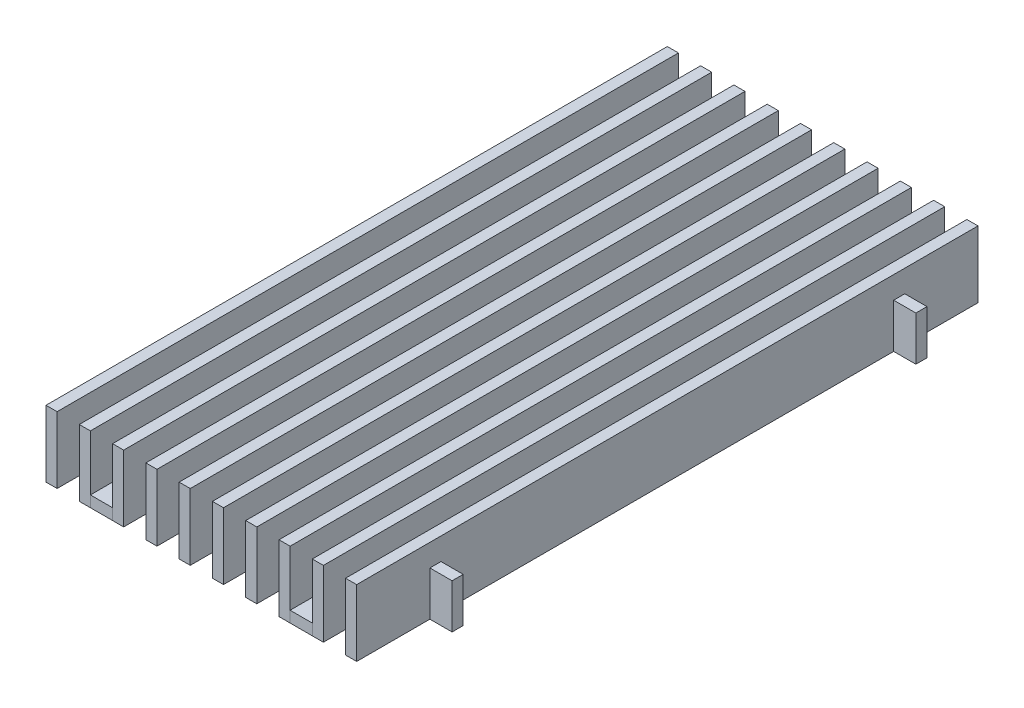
ISO-10303-21;
HEADER;
FILE_DESCRIPTION(('STEP AP214'),'2;1');
FILE_NAME('part.step','',(''),(''),'','','');
FILE_SCHEMA(('AUTOMOTIVE_DESIGN { 1 0 10303 214 1 1 1 1 }'));
ENDSEC;
DATA;
#1=APPLICATION_CONTEXT('core data for automotive mechanical design processes');
#2=APPLICATION_PROTOCOL_DEFINITION('international standard','automotive_design',2000,#1);
#3=PRODUCT_CONTEXT('',#1,'mechanical');
#4=PRODUCT('Part','Part','',(#3));
#5=PRODUCT_RELATED_PRODUCT_CATEGORY('part','',(#4));
#6=PRODUCT_DEFINITION_FORMATION('','',#4);
#7=PRODUCT_DEFINITION_CONTEXT('part definition',#1,'design');
#8=PRODUCT_DEFINITION('design','',#6,#7);
#9=PRODUCT_DEFINITION_SHAPE('','',#8);
#10=(LENGTH_UNIT() NAMED_UNIT(*) SI_UNIT(.MILLI.,.METRE.));
#11=(NAMED_UNIT(*) PLANE_ANGLE_UNIT() SI_UNIT($,.RADIAN.));
#12=(NAMED_UNIT(*) SI_UNIT($,.STERADIAN.) SOLID_ANGLE_UNIT());
#13=UNCERTAINTY_MEASURE_WITH_UNIT(LENGTH_MEASURE(1.E-05),#10,'distance_accuracy_value','');
#14=(GEOMETRIC_REPRESENTATION_CONTEXT(3) GLOBAL_UNCERTAINTY_ASSIGNED_CONTEXT((#13)) GLOBAL_UNIT_ASSIGNED_CONTEXT((#10,
#11,#12)) REPRESENTATION_CONTEXT('',''));
#15=CARTESIAN_POINT('',(0.,0.,0.));
#16=DIRECTION('',(0.,0.,1.));
#17=DIRECTION('',(1.,0.,0.));
#18=AXIS2_PLACEMENT_3D('',#15,#16,#17);
#19=CARTESIAN_POINT('',(11.1125,-6.35,0.));
#20=DIRECTION('',(0.,0.,1.));
#21=DIRECTION('',(1.,0.,0.));
#22=AXIS2_PLACEMENT_3D('',#19,#20,#21);
#23=PLANE('',#22);
#24=DIRECTION('',(-1.,0.,0.));
#25=VECTOR('',#24,1.);
#26=CARTESIAN_POINT('',(11.1125,-9.525,0.));
#27=LINE('',#26,#25);
#28=CARTESIAN_POINT('',(17.4625,-9.525,0.));
#29=VERTEX_POINT('',#28);
#30=CARTESIAN_POINT('',(11.1125,-9.525,0.));
#31=VERTEX_POINT('',#30);
#32=EDGE_CURVE('E108',#29,#31,#27,.T.);
#33=ORIENTED_EDGE('',*,*,#32,.F.);
#34=DIRECTION('',(0.,-1.,0.));
#35=VECTOR('',#34,1.);
#36=CARTESIAN_POINT('',(17.4625,-6.35,0.));
#37=LINE('',#36,#35);
#38=CARTESIAN_POINT('',(17.4625,-6.35,0.));
#39=VERTEX_POINT('',#38);
#40=EDGE_CURVE('E12',#39,#29,#37,.T.);
#41=ORIENTED_EDGE('',*,*,#40,.F.);
#42=DIRECTION('',(-1.,0.,0.));
#43=VECTOR('',#42,1.);
#44=CARTESIAN_POINT('',(11.1125,-6.35,0.));
#45=LINE('',#44,#43);
#46=CARTESIAN_POINT('',(11.1125,-6.35,0.));
#47=VERTEX_POINT('',#46);
#48=EDGE_CURVE('E101',#39,#47,#45,.T.);
#49=ORIENTED_EDGE('',*,*,#48,.T.);
#50=DIRECTION('',(0.,-1.,0.));
#51=VECTOR('',#50,1.);
#52=CARTESIAN_POINT('',(11.1125,-6.35,0.));
#53=LINE('',#52,#51);
#54=EDGE_CURVE('E46',#47,#31,#53,.T.);
#55=ORIENTED_EDGE('',*,*,#54,.T.);
#56=EDGE_LOOP('',(#33,#41,#49,#55));
#57=FACE_BOUND('',#56,.T.);
#58=ADVANCED_FACE('F43',(#57),#23,.T.);
#59=CARTESIAN_POINT('',(17.4625,-6.35,0.));
#60=DIRECTION('',(1.,0.,0.));
#61=DIRECTION('',(0.,0.,-1.));
#62=AXIS2_PLACEMENT_3D('',#59,#60,#61);
#63=PLANE('',#62);
#64=DIRECTION('',(0.,0.,1.));
#65=VECTOR('',#64,1.);
#66=CARTESIAN_POINT('',(17.4625,-9.525,0.));
#67=LINE('',#66,#65);
#68=CARTESIAN_POINT('',(17.4625,-9.525,-12.7));
#69=VERTEX_POINT('',#68);
#70=EDGE_CURVE('E103',#69,#29,#67,.T.);
#71=ORIENTED_EDGE('',*,*,#70,.F.);
#72=DIRECTION('',(0.,-1.,0.));
#73=VECTOR('',#72,1.);
#74=CARTESIAN_POINT('',(17.4625,-6.35,-12.7));
#75=LINE('',#74,#73);
#76=CARTESIAN_POINT('',(17.4625,-6.35,-12.7));
#77=VERTEX_POINT('',#76);
#78=EDGE_CURVE('E52',#77,#69,#75,.T.);
#79=ORIENTED_EDGE('',*,*,#78,.F.);
#80=DIRECTION('',(0.,0.,1.));
#81=VECTOR('',#80,1.);
#82=CARTESIAN_POINT('',(17.4625,-6.35,0.));
#83=LINE('',#82,#81);
#84=EDGE_CURVE('E98',#77,#39,#83,.T.);
#85=ORIENTED_EDGE('',*,*,#84,.T.);
#86=ORIENTED_EDGE('',*,*,#40,.T.);
#87=EDGE_LOOP('',(#71,#79,#85,#86));
#88=FACE_BOUND('',#87,.T.);
#89=ADVANCED_FACE('F119',(#88),#63,.T.);
#90=CARTESIAN_POINT('',(11.1125,-6.35,-12.7));
#91=DIRECTION('',(0.,0.,-1.));
#92=DIRECTION('',(-1.,0.,0.));
#93=AXIS2_PLACEMENT_3D('',#90,#91,#92);
#94=PLANE('',#93);
#95=DIRECTION('',(1.,0.,0.));
#96=VECTOR('',#95,1.);
#97=CARTESIAN_POINT('',(11.1125,-9.525,-12.7));
#98=LINE('',#97,#96);
#99=CARTESIAN_POINT('',(11.1125,-9.525,-12.7));
#100=VERTEX_POINT('',#99);
#101=EDGE_CURVE('E93',#100,#69,#98,.T.);
#102=ORIENTED_EDGE('',*,*,#101,.F.);
#103=DIRECTION('',(0.,-1.,0.));
#104=VECTOR('',#103,1.);
#105=CARTESIAN_POINT('',(11.1125,-6.35,-12.7));
#106=LINE('',#105,#104);
#107=CARTESIAN_POINT('',(11.1125,-6.35,-12.7));
#108=VERTEX_POINT('',#107);
#109=EDGE_CURVE('E88',#108,#100,#106,.T.);
#110=ORIENTED_EDGE('',*,*,#109,.F.);
#111=DIRECTION('',(1.,0.,0.));
#112=VECTOR('',#111,1.);
#113=CARTESIAN_POINT('',(11.1125,-6.35,-12.7));
#114=LINE('',#113,#112);
#115=EDGE_CURVE('E91',#108,#77,#114,.T.);
#116=ORIENTED_EDGE('',*,*,#115,.T.);
#117=ORIENTED_EDGE('',*,*,#78,.T.);
#118=EDGE_LOOP('',(#102,#110,#116,#117));
#119=FACE_BOUND('',#118,.T.);
#120=ADVANCED_FACE('F90',(#119),#94,.T.);
#121=CARTESIAN_POINT('',(11.1125,-6.35,0.));
#122=DIRECTION('',(-1.,0.,0.));
#123=DIRECTION('',(0.,0.,1.));
#124=AXIS2_PLACEMENT_3D('',#121,#122,#123);
#125=PLANE('',#124);
#126=DIRECTION('',(0.,0.,-1.));
#127=VECTOR('',#126,1.);
#128=CARTESIAN_POINT('',(11.1125,-9.525,0.));
#129=LINE('',#128,#127);
#130=EDGE_CURVE('E111',#31,#100,#129,.T.);
#131=ORIENTED_EDGE('',*,*,#130,.F.);
#132=ORIENTED_EDGE('',*,*,#54,.F.);
#133=DIRECTION('',(0.,0.,-1.));
#134=VECTOR('',#133,1.);
#135=CARTESIAN_POINT('',(11.1125,-6.35,0.));
#136=LINE('',#135,#134);
#137=EDGE_CURVE('E97',#47,#108,#136,.T.);
#138=ORIENTED_EDGE('',*,*,#137,.T.);
#139=ORIENTED_EDGE('',*,*,#109,.T.);
#140=EDGE_LOOP('',(#131,#132,#138,#139));
#141=FACE_BOUND('',#140,.T.);
#142=ADVANCED_FACE('F100',(#141),#125,.T.);
#143=CARTESIAN_POINT('',(0.,-6.35,0.));
#144=DIRECTION('',(0.,1.,0.));
#145=DIRECTION('',(0.,0.,1.));
#146=AXIS2_PLACEMENT_3D('',#143,#144,#145);
#147=PLANE('',#146);
#148=CARTESIAN_POINT('',(14.2875,-6.35,-6.34999999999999));
#149=DIRECTION('',(0.,-1.,0.));
#150=DIRECTION('',(0.,0.,1.));
#151=AXIS2_PLACEMENT_3D('',#148,#149,#150);
#152=CIRCLE('',#151,1.5875);
#153=CARTESIAN_POINT('',(14.2875,-6.35,-4.7625));
#154=VERTEX_POINT('',#153);
#155=EDGE_CURVE('E112',#154,#154,#152,.T.);
#156=ORIENTED_EDGE('',*,*,#155,.T.);
#157=EDGE_LOOP('',(#156));
#158=FACE_BOUND('',#157,.T.);
#159=ORIENTED_EDGE('',*,*,#48,.F.);
#160=ORIENTED_EDGE('',*,*,#84,.F.);
#161=ORIENTED_EDGE('',*,*,#115,.F.);
#162=ORIENTED_EDGE('',*,*,#137,.F.);
#163=EDGE_LOOP('',(#159,#160,#161,#162));
#164=FACE_BOUND('',#163,.T.);
#165=ADVANCED_FACE('F96',(#158,#164),#147,.T.);
#166=CARTESIAN_POINT('',(0.,-9.525,0.));
#167=DIRECTION('',(0.,1.,0.));
#168=DIRECTION('',(0.,0.,1.));
#169=AXIS2_PLACEMENT_3D('',#166,#167,#168);
#170=PLANE('',#169);
#171=CARTESIAN_POINT('',(14.2875,-9.525,-6.34999999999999));
#172=DIRECTION('',(0.,-1.,0.));
#173=DIRECTION('',(0.,0.,1.));
#174=AXIS2_PLACEMENT_3D('',#171,#172,#173);
#175=CIRCLE('',#174,1.5875);
#176=CARTESIAN_POINT('',(14.2875,-9.525,-4.7625));
#177=VERTEX_POINT('',#176);
#178=EDGE_CURVE('E149',#177,#177,#175,.T.);
#179=ORIENTED_EDGE('',*,*,#178,.F.);
#180=EDGE_LOOP('',(#179));
#181=FACE_BOUND('',#180,.T.);
#182=ORIENTED_EDGE('',*,*,#32,.T.);
#183=ORIENTED_EDGE('',*,*,#130,.T.);
#184=ORIENTED_EDGE('',*,*,#101,.T.);
#185=ORIENTED_EDGE('',*,*,#70,.T.);
#186=EDGE_LOOP('',(#182,#183,#184,#185));
#187=FACE_BOUND('',#186,.T.);
#188=ADVANCED_FACE('F118',(#181,#187),#170,.F.);
#189=CARTESIAN_POINT('',(14.2875,-6.35,-6.34999999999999));
#190=DIRECTION('',(0.,-1.,0.));
#191=DIRECTION('',(0.,0.,-1.));
#192=AXIS2_PLACEMENT_3D('',#189,#190,#191);
#193=CYLINDRICAL_SURFACE('',#192,1.5875);
#194=ORIENTED_EDGE('',*,*,#155,.F.);
#195=EDGE_LOOP('',(#194));
#196=FACE_BOUND('',#195,.T.);
#197=ORIENTED_EDGE('',*,*,#178,.T.);
#198=EDGE_LOOP('',(#197));
#199=FACE_BOUND('',#198,.T.);
#200=ADVANCED_FACE('F137',(#196,#199),#193,.F.);
#201=CLOSED_SHELL('',(#58,#89,#120,#142,#165,#188,#200));
#202=MANIFOLD_SOLID_BREP('B2',#201);
#203=CARTESIAN_POINT('',(74.6125,-6.35,0.));
#204=DIRECTION('',(1.,0.,0.));
#205=DIRECTION('',(0.,0.,-1.));
#206=AXIS2_PLACEMENT_3D('',#203,#204,#205);
#207=PLANE('',#206);
#208=DIRECTION('',(0.,0.,1.));
#209=VECTOR('',#208,1.);
#210=CARTESIAN_POINT('',(74.6125,-9.525,0.));
#211=LINE('',#210,#209);
#212=CARTESIAN_POINT('',(74.6125,-9.525,-12.7));
#213=VERTEX_POINT('',#212);
#214=CARTESIAN_POINT('',(74.6125,-9.525,0.));
#215=VERTEX_POINT('',#214);
#216=EDGE_CURVE('E262',#213,#215,#211,.T.);
#217=ORIENTED_EDGE('',*,*,#216,.F.);
#218=DIRECTION('',(0.,-1.,0.));
#219=VECTOR('',#218,1.);
#220=CARTESIAN_POINT('',(74.6125,-6.35,-12.7));
#221=LINE('',#220,#219);
#222=CARTESIAN_POINT('',(74.6125,-6.35,-12.7));
#223=VERTEX_POINT('',#222);
#224=EDGE_CURVE('E41',#223,#213,#221,.T.);
#225=ORIENTED_EDGE('',*,*,#224,.F.);
#226=DIRECTION('',(0.,0.,1.));
#227=VECTOR('',#226,1.);
#228=CARTESIAN_POINT('',(74.6125,-6.35,0.));
#229=LINE('',#228,#227);
#230=CARTESIAN_POINT('',(74.6125,-6.35,0.));
#231=VERTEX_POINT('',#230);
#232=EDGE_CURVE('E255',#223,#231,#229,.T.);
#233=ORIENTED_EDGE('',*,*,#232,.T.);
#234=DIRECTION('',(0.,-1.,0.));
#235=VECTOR('',#234,1.);
#236=CARTESIAN_POINT('',(74.6125,-6.35,0.));
#237=LINE('',#236,#235);
#238=EDGE_CURVE('E200',#231,#215,#237,.T.);
#239=ORIENTED_EDGE('',*,*,#238,.T.);
#240=EDGE_LOOP('',(#217,#225,#233,#239));
#241=FACE_BOUND('',#240,.T.);
#242=ADVANCED_FACE('F197',(#241),#207,.T.);
#243=CARTESIAN_POINT('',(74.6125,-6.35,-12.7));
#244=DIRECTION('',(0.,0.,-1.));
#245=DIRECTION('',(-1.,0.,0.));
#246=AXIS2_PLACEMENT_3D('',#243,#244,#245);
#247=PLANE('',#246);
#248=DIRECTION('',(1.,0.,0.));
#249=VECTOR('',#248,1.);
#250=CARTESIAN_POINT('',(74.6125,-9.525,-12.7));
#251=LINE('',#250,#249);
#252=CARTESIAN_POINT('',(68.2625,-9.525,-12.7));
#253=VERTEX_POINT('',#252);
#254=EDGE_CURVE('E257',#253,#213,#251,.T.);
#255=ORIENTED_EDGE('',*,*,#254,.F.);
#256=DIRECTION('',(0.,-1.,0.));
#257=VECTOR('',#256,1.);
#258=CARTESIAN_POINT('',(68.2625,-6.35,-12.7));
#259=LINE('',#258,#257);
#260=CARTESIAN_POINT('',(68.2625,-6.35,-12.7));
#261=VERTEX_POINT('',#260);
#262=EDGE_CURVE('E206',#261,#253,#259,.T.);
#263=ORIENTED_EDGE('',*,*,#262,.F.);
#264=DIRECTION('',(1.,0.,0.));
#265=VECTOR('',#264,1.);
#266=CARTESIAN_POINT('',(74.6125,-6.35,-12.7));
#267=LINE('',#266,#265);
#268=EDGE_CURVE('E252',#261,#223,#267,.T.);
#269=ORIENTED_EDGE('',*,*,#268,.T.);
#270=ORIENTED_EDGE('',*,*,#224,.T.);
#271=EDGE_LOOP('',(#255,#263,#269,#270));
#272=FACE_BOUND('',#271,.T.);
#273=ADVANCED_FACE('F273',(#272),#247,.T.);
#274=CARTESIAN_POINT('',(68.2625,-6.35,0.));
#275=DIRECTION('',(-1.,0.,0.));
#276=DIRECTION('',(0.,0.,1.));
#277=AXIS2_PLACEMENT_3D('',#274,#275,#276);
#278=PLANE('',#277);
#279=DIRECTION('',(0.,0.,-1.));
#280=VECTOR('',#279,1.);
#281=CARTESIAN_POINT('',(68.2625,-9.525,0.));
#282=LINE('',#281,#280);
#283=CARTESIAN_POINT('',(68.2625,-9.525,0.));
#284=VERTEX_POINT('',#283);
#285=EDGE_CURVE('E247',#284,#253,#282,.T.);
#286=ORIENTED_EDGE('',*,*,#285,.F.);
#287=DIRECTION('',(0.,-1.,0.));
#288=VECTOR('',#287,1.);
#289=CARTESIAN_POINT('',(68.2625,-6.35,0.));
#290=LINE('',#289,#288);
#291=CARTESIAN_POINT('',(68.2625,-6.35,0.));
#292=VERTEX_POINT('',#291);
#293=EDGE_CURVE('E242',#292,#284,#290,.T.);
#294=ORIENTED_EDGE('',*,*,#293,.F.);
#295=DIRECTION('',(0.,0.,-1.));
#296=VECTOR('',#295,1.);
#297=CARTESIAN_POINT('',(68.2625,-6.35,0.));
#298=LINE('',#297,#296);
#299=EDGE_CURVE('E245',#292,#261,#298,.T.);
#300=ORIENTED_EDGE('',*,*,#299,.T.);
#301=ORIENTED_EDGE('',*,*,#262,.T.);
#302=EDGE_LOOP('',(#286,#294,#300,#301));
#303=FACE_BOUND('',#302,.T.);
#304=ADVANCED_FACE('F244',(#303),#278,.T.);
#305=CARTESIAN_POINT('',(74.6125,-6.35,0.));
#306=DIRECTION('',(0.,0.,1.));
#307=DIRECTION('',(1.,0.,0.));
#308=AXIS2_PLACEMENT_3D('',#305,#306,#307);
#309=PLANE('',#308);
#310=DIRECTION('',(-1.,0.,0.));
#311=VECTOR('',#310,1.);
#312=CARTESIAN_POINT('',(74.6125,-9.525,0.));
#313=LINE('',#312,#311);
#314=EDGE_CURVE('E265',#215,#284,#313,.T.);
#315=ORIENTED_EDGE('',*,*,#314,.F.);
#316=ORIENTED_EDGE('',*,*,#238,.F.);
#317=DIRECTION('',(-1.,0.,0.));
#318=VECTOR('',#317,1.);
#319=CARTESIAN_POINT('',(74.6125,-6.35,0.));
#320=LINE('',#319,#318);
#321=EDGE_CURVE('E251',#231,#292,#320,.T.);
#322=ORIENTED_EDGE('',*,*,#321,.T.);
#323=ORIENTED_EDGE('',*,*,#293,.T.);
#324=EDGE_LOOP('',(#315,#316,#322,#323));
#325=FACE_BOUND('',#324,.T.);
#326=ADVANCED_FACE('F254',(#325),#309,.T.);
#327=CARTESIAN_POINT('',(0.,-6.35,0.));
#328=DIRECTION('',(0.,1.,0.));
#329=DIRECTION('',(0.,0.,1.));
#330=AXIS2_PLACEMENT_3D('',#327,#328,#329);
#331=PLANE('',#330);
#332=CARTESIAN_POINT('',(71.4375,-6.35,-6.34999999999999));
#333=DIRECTION('',(0.,-1.,0.));
#334=DIRECTION('',(0.,0.,-1.));
#335=AXIS2_PLACEMENT_3D('',#332,#333,#334);
#336=CIRCLE('',#335,1.58749999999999);
#337=CARTESIAN_POINT('',(71.4375,-6.35,-7.93749999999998));
#338=VERTEX_POINT('',#337);
#339=EDGE_CURVE('E266',#338,#338,#336,.T.);
#340=ORIENTED_EDGE('',*,*,#339,.T.);
#341=EDGE_LOOP('',(#340));
#342=FACE_BOUND('',#341,.T.);
#343=ORIENTED_EDGE('',*,*,#232,.F.);
#344=ORIENTED_EDGE('',*,*,#268,.F.);
#345=ORIENTED_EDGE('',*,*,#299,.F.);
#346=ORIENTED_EDGE('',*,*,#321,.F.);
#347=EDGE_LOOP('',(#343,#344,#345,#346));
#348=FACE_BOUND('',#347,.T.);
#349=ADVANCED_FACE('F250',(#342,#348),#331,.T.);
#350=CARTESIAN_POINT('',(0.,-9.525,0.));
#351=DIRECTION('',(0.,1.,0.));
#352=DIRECTION('',(0.,0.,1.));
#353=AXIS2_PLACEMENT_3D('',#350,#351,#352);
#354=PLANE('',#353);
#355=CARTESIAN_POINT('',(71.4375,-9.525,-6.34999999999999));
#356=DIRECTION('',(0.,-1.,0.));
#357=DIRECTION('',(0.,0.,-1.));
#358=AXIS2_PLACEMENT_3D('',#355,#356,#357);
#359=CIRCLE('',#358,1.58749999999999);
#360=CARTESIAN_POINT('',(71.4375,-9.525,-7.93749999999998));
#361=VERTEX_POINT('',#360);
#362=EDGE_CURVE('E303',#361,#361,#359,.T.);
#363=ORIENTED_EDGE('',*,*,#362,.F.);
#364=EDGE_LOOP('',(#363));
#365=FACE_BOUND('',#364,.T.);
#366=ORIENTED_EDGE('',*,*,#216,.T.);
#367=ORIENTED_EDGE('',*,*,#314,.T.);
#368=ORIENTED_EDGE('',*,*,#285,.T.);
#369=ORIENTED_EDGE('',*,*,#254,.T.);
#370=EDGE_LOOP('',(#366,#367,#368,#369));
#371=FACE_BOUND('',#370,.T.);
#372=ADVANCED_FACE('F272',(#365,#371),#354,.F.);
#373=CARTESIAN_POINT('',(71.4375,-6.35,-6.34999999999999));
#374=DIRECTION('',(0.,-1.,0.));
#375=DIRECTION('',(0.,0.,-1.));
#376=AXIS2_PLACEMENT_3D('',#373,#374,#375);
#377=CYLINDRICAL_SURFACE('',#376,1.58749999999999);
#378=ORIENTED_EDGE('',*,*,#339,.F.);
#379=EDGE_LOOP('',(#378));
#380=FACE_BOUND('',#379,.T.);
#381=ORIENTED_EDGE('',*,*,#362,.T.);
#382=EDGE_LOOP('',(#381));
#383=FACE_BOUND('',#382,.T.);
#384=ADVANCED_FACE('F291',(#380,#383),#377,.F.);
#385=CLOSED_SHELL('',(#242,#273,#304,#326,#349,#372,#384));
#386=MANIFOLD_SOLID_BREP('B6',#385);
#387=CARTESIAN_POINT('',(74.6125,-6.35,-177.8));
#388=DIRECTION('',(0.,0.,-1.));
#389=DIRECTION('',(-1.,0.,0.));
#390=AXIS2_PLACEMENT_3D('',#387,#388,#389);
#391=PLANE('',#390);
#392=DIRECTION('',(1.,0.,0.));
#393=VECTOR('',#392,1.);
#394=CARTESIAN_POINT('',(74.6125,-9.525,-177.8));
#395=LINE('',#394,#393);
#396=CARTESIAN_POINT('',(68.2625,-9.525,-177.8));
#397=VERTEX_POINT('',#396);
#398=CARTESIAN_POINT('',(74.6125,-9.525,-177.8));
#399=VERTEX_POINT('',#398);
#400=EDGE_CURVE('E416',#397,#399,#395,.T.);
#401=ORIENTED_EDGE('',*,*,#400,.F.);
#402=DIRECTION('',(0.,-1.,0.));
#403=VECTOR('',#402,1.);
#404=CARTESIAN_POINT('',(68.2625,-6.35,-177.8));
#405=LINE('',#404,#403);
#406=CARTESIAN_POINT('',(68.2625,-6.35,-177.8));
#407=VERTEX_POINT('',#406);
#408=EDGE_CURVE('E195',#407,#397,#405,.T.);
#409=ORIENTED_EDGE('',*,*,#408,.F.);
#410=DIRECTION('',(1.,0.,0.));
#411=VECTOR('',#410,1.);
#412=CARTESIAN_POINT('',(74.6125,-6.35,-177.8));
#413=LINE('',#412,#411);
#414=CARTESIAN_POINT('',(74.6125,-6.35,-177.8));
#415=VERTEX_POINT('',#414);
#416=EDGE_CURVE('E409',#407,#415,#413,.T.);
#417=ORIENTED_EDGE('',*,*,#416,.T.);
#418=DIRECTION('',(0.,-1.,0.));
#419=VECTOR('',#418,1.);
#420=CARTESIAN_POINT('',(74.6125,-6.35,-177.8));
#421=LINE('',#420,#419);
#422=EDGE_CURVE('E354',#415,#399,#421,.T.);
#423=ORIENTED_EDGE('',*,*,#422,.T.);
#424=EDGE_LOOP('',(#401,#409,#417,#423));
#425=FACE_BOUND('',#424,.T.);
#426=ADVANCED_FACE('F351',(#425),#391,.T.);
#427=CARTESIAN_POINT('',(68.2625,-6.35,-177.8));
#428=DIRECTION('',(-1.,0.,0.));
#429=DIRECTION('',(0.,0.,1.));
#430=AXIS2_PLACEMENT_3D('',#427,#428,#429);
#431=PLANE('',#430);
#432=DIRECTION('',(0.,0.,-1.));
#433=VECTOR('',#432,1.);
#434=CARTESIAN_POINT('',(68.2625,-9.525,-177.8));
#435=LINE('',#434,#433);
#436=CARTESIAN_POINT('',(68.2625,-9.525,-165.1));
#437=VERTEX_POINT('',#436);
#438=EDGE_CURVE('E411',#437,#397,#435,.T.);
#439=ORIENTED_EDGE('',*,*,#438,.F.);
#440=DIRECTION('',(0.,-1.,0.));
#441=VECTOR('',#440,1.);
#442=CARTESIAN_POINT('',(68.2625,-6.35,-165.1));
#443=LINE('',#442,#441);
#444=CARTESIAN_POINT('',(68.2625,-6.35,-165.1));
#445=VERTEX_POINT('',#444);
#446=EDGE_CURVE('E360',#445,#437,#443,.T.);
#447=ORIENTED_EDGE('',*,*,#446,.F.);
#448=DIRECTION('',(0.,0.,-1.));
#449=VECTOR('',#448,1.);
#450=CARTESIAN_POINT('',(68.2625,-6.35,-177.8));
#451=LINE('',#450,#449);
#452=EDGE_CURVE('E406',#445,#407,#451,.T.);
#453=ORIENTED_EDGE('',*,*,#452,.T.);
#454=ORIENTED_EDGE('',*,*,#408,.T.);
#455=EDGE_LOOP('',(#439,#447,#453,#454));
#456=FACE_BOUND('',#455,.T.);
#457=ADVANCED_FACE('F427',(#456),#431,.T.);
#458=CARTESIAN_POINT('',(74.6125,-6.35,-165.1));
#459=DIRECTION('',(0.,0.,1.));
#460=DIRECTION('',(1.,0.,0.));
#461=AXIS2_PLACEMENT_3D('',#458,#459,#460);
#462=PLANE('',#461);
#463=DIRECTION('',(-1.,0.,0.));
#464=VECTOR('',#463,1.);
#465=CARTESIAN_POINT('',(74.6125,-9.525,-165.1));
#466=LINE('',#465,#464);
#467=CARTESIAN_POINT('',(74.6125,-9.525,-165.1));
#468=VERTEX_POINT('',#467);
#469=EDGE_CURVE('E401',#468,#437,#466,.T.);
#470=ORIENTED_EDGE('',*,*,#469,.F.);
#471=DIRECTION('',(0.,-1.,0.));
#472=VECTOR('',#471,1.);
#473=CARTESIAN_POINT('',(74.6125,-6.35,-165.1));
#474=LINE('',#473,#472);
#475=CARTESIAN_POINT('',(74.6125,-6.35,-165.1));
#476=VERTEX_POINT('',#475);
#477=EDGE_CURVE('E396',#476,#468,#474,.T.);
#478=ORIENTED_EDGE('',*,*,#477,.F.);
#479=DIRECTION('',(-1.,0.,0.));
#480=VECTOR('',#479,1.);
#481=CARTESIAN_POINT('',(74.6125,-6.35,-165.1));
#482=LINE('',#481,#480);
#483=EDGE_CURVE('E399',#476,#445,#482,.T.);
#484=ORIENTED_EDGE('',*,*,#483,.T.);
#485=ORIENTED_EDGE('',*,*,#446,.T.);
#486=EDGE_LOOP('',(#470,#478,#484,#485));
#487=FACE_BOUND('',#486,.T.);
#488=ADVANCED_FACE('F398',(#487),#462,.T.);
#489=CARTESIAN_POINT('',(74.6125,-6.35,-177.8));
#490=DIRECTION('',(1.,0.,0.));
#491=DIRECTION('',(0.,0.,-1.));
#492=AXIS2_PLACEMENT_3D('',#489,#490,#491);
#493=PLANE('',#492);
#494=DIRECTION('',(0.,0.,1.));
#495=VECTOR('',#494,1.);
#496=CARTESIAN_POINT('',(74.6125,-9.525,-177.8));
#497=LINE('',#496,#495);
#498=EDGE_CURVE('E419',#399,#468,#497,.T.);
#499=ORIENTED_EDGE('',*,*,#498,.F.);
#500=ORIENTED_EDGE('',*,*,#422,.F.);
#501=DIRECTION('',(0.,0.,1.));
#502=VECTOR('',#501,1.);
#503=CARTESIAN_POINT('',(74.6125,-6.35,-177.8));
#504=LINE('',#503,#502);
#505=EDGE_CURVE('E405',#415,#476,#504,.T.);
#506=ORIENTED_EDGE('',*,*,#505,.T.);
#507=ORIENTED_EDGE('',*,*,#477,.T.);
#508=EDGE_LOOP('',(#499,#500,#506,#507));
#509=FACE_BOUND('',#508,.T.);
#510=ADVANCED_FACE('F408',(#509),#493,.T.);
#511=CARTESIAN_POINT('',(0.,-6.35,0.));
#512=DIRECTION('',(0.,1.,0.));
#513=DIRECTION('',(0.,0.,1.));
#514=AXIS2_PLACEMENT_3D('',#511,#512,#513);
#515=PLANE('',#514);
#516=CARTESIAN_POINT('',(71.4375,-6.35,-171.45));
#517=DIRECTION('',(0.,-1.,0.));
#518=DIRECTION('',(0.,0.,1.));
#519=AXIS2_PLACEMENT_3D('',#516,#517,#518);
#520=CIRCLE('',#519,1.58749999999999);
#521=CARTESIAN_POINT('',(71.4375,-6.35,-169.8625));
#522=VERTEX_POINT('',#521);
#523=EDGE_CURVE('E420',#522,#522,#520,.T.);
#524=ORIENTED_EDGE('',*,*,#523,.T.);
#525=EDGE_LOOP('',(#524));
#526=FACE_BOUND('',#525,.T.);
#527=ORIENTED_EDGE('',*,*,#416,.F.);
#528=ORIENTED_EDGE('',*,*,#452,.F.);
#529=ORIENTED_EDGE('',*,*,#483,.F.);
#530=ORIENTED_EDGE('',*,*,#505,.F.);
#531=EDGE_LOOP('',(#527,#528,#529,#530));
#532=FACE_BOUND('',#531,.T.);
#533=ADVANCED_FACE('F404',(#526,#532),#515,.T.);
#534=CARTESIAN_POINT('',(0.,-9.525,0.));
#535=DIRECTION('',(0.,1.,0.));
#536=DIRECTION('',(0.,0.,1.));
#537=AXIS2_PLACEMENT_3D('',#534,#535,#536);
#538=PLANE('',#537);
#539=CARTESIAN_POINT('',(71.4375,-9.525,-171.45));
#540=DIRECTION('',(0.,-1.,0.));
#541=DIRECTION('',(0.,0.,1.));
#542=AXIS2_PLACEMENT_3D('',#539,#540,#541);
#543=CIRCLE('',#542,1.58749999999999);
#544=CARTESIAN_POINT('',(71.4375,-9.525,-169.8625));
#545=VERTEX_POINT('',#544);
#546=EDGE_CURVE('E457',#545,#545,#543,.T.);
#547=ORIENTED_EDGE('',*,*,#546,.F.);
#548=EDGE_LOOP('',(#547));
#549=FACE_BOUND('',#548,.T.);
#550=ORIENTED_EDGE('',*,*,#400,.T.);
#551=ORIENTED_EDGE('',*,*,#498,.T.);
#552=ORIENTED_EDGE('',*,*,#469,.T.);
#553=ORIENTED_EDGE('',*,*,#438,.T.);
#554=EDGE_LOOP('',(#550,#551,#552,#553));
#555=FACE_BOUND('',#554,.T.);
#556=ADVANCED_FACE('F426',(#549,#555),#538,.F.);
#557=CARTESIAN_POINT('',(71.4375,-6.35,-171.45));
#558=DIRECTION('',(0.,-1.,0.));
#559=DIRECTION('',(0.,0.,-1.));
#560=AXIS2_PLACEMENT_3D('',#557,#558,#559);
#561=CYLINDRICAL_SURFACE('',#560,1.58749999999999);
#562=ORIENTED_EDGE('',*,*,#523,.F.);
#563=EDGE_LOOP('',(#562));
#564=FACE_BOUND('',#563,.T.);
#565=ORIENTED_EDGE('',*,*,#546,.T.);
#566=EDGE_LOOP('',(#565));
#567=FACE_BOUND('',#566,.T.);
#568=ADVANCED_FACE('F445',(#564,#567),#561,.F.);
#569=CLOSED_SHELL('',(#426,#457,#488,#510,#533,#556,#568));
#570=MANIFOLD_SOLID_BREP('B35',#569);
#571=CARTESIAN_POINT('',(11.1125,-6.35,-177.8));
#572=DIRECTION('',(-1.,0.,0.));
#573=DIRECTION('',(0.,0.,1.));
#574=AXIS2_PLACEMENT_3D('',#571,#572,#573);
#575=PLANE('',#574);
#576=DIRECTION('',(0.,0.,-1.));
#577=VECTOR('',#576,1.);
#578=CARTESIAN_POINT('',(11.1125,-9.525,-177.8));
#579=LINE('',#578,#577);
#580=CARTESIAN_POINT('',(11.1125,-9.525,-165.1));
#581=VERTEX_POINT('',#580);
#582=CARTESIAN_POINT('',(11.1125,-9.525,-177.8));
#583=VERTEX_POINT('',#582);
#584=EDGE_CURVE('E569',#581,#583,#579,.T.);
#585=ORIENTED_EDGE('',*,*,#584,.F.);
#586=DIRECTION('',(0.,-1.,0.));
#587=VECTOR('',#586,1.);
#588=CARTESIAN_POINT('',(11.1125,-6.35,-165.1));
#589=LINE('',#588,#587);
#590=CARTESIAN_POINT('',(11.1125,-6.35,-165.1));
#591=VERTEX_POINT('',#590);
#592=EDGE_CURVE('E349',#591,#581,#589,.T.);
#593=ORIENTED_EDGE('',*,*,#592,.F.);
#594=DIRECTION('',(0.,0.,-1.));
#595=VECTOR('',#594,1.);
#596=CARTESIAN_POINT('',(11.1125,-6.35,-177.8));
#597=LINE('',#596,#595);
#598=CARTESIAN_POINT('',(11.1125,-6.35,-177.8));
#599=VERTEX_POINT('',#598);
#600=EDGE_CURVE('E562',#591,#599,#597,.T.);
#601=ORIENTED_EDGE('',*,*,#600,.T.);
#602=DIRECTION('',(0.,-1.,0.));
#603=VECTOR('',#602,1.);
#604=CARTESIAN_POINT('',(11.1125,-6.35,-177.8));
#605=LINE('',#604,#603);
#606=EDGE_CURVE('E507',#599,#583,#605,.T.);
#607=ORIENTED_EDGE('',*,*,#606,.T.);
#608=EDGE_LOOP('',(#585,#593,#601,#607));
#609=FACE_BOUND('',#608,.T.);
#610=ADVANCED_FACE('F504',(#609),#575,.T.);
#611=CARTESIAN_POINT('',(11.1125,-6.35,-165.1));
#612=DIRECTION('',(0.,0.,1.));
#613=DIRECTION('',(1.,0.,0.));
#614=AXIS2_PLACEMENT_3D('',#611,#612,#613);
#615=PLANE('',#614);
#616=DIRECTION('',(-1.,0.,0.));
#617=VECTOR('',#616,1.);
#618=CARTESIAN_POINT('',(11.1125,-9.525,-165.1));
#619=LINE('',#618,#617);
#620=CARTESIAN_POINT('',(17.4625,-9.525,-165.1));
#621=VERTEX_POINT('',#620);
#622=EDGE_CURVE('E564',#621,#581,#619,.T.);
#623=ORIENTED_EDGE('',*,*,#622,.F.);
#624=DIRECTION('',(0.,-1.,0.));
#625=VECTOR('',#624,1.);
#626=CARTESIAN_POINT('',(17.4625,-6.35,-165.1));
#627=LINE('',#626,#625);
#628=CARTESIAN_POINT('',(17.4625,-6.35,-165.1));
#629=VERTEX_POINT('',#628);
#630=EDGE_CURVE('E513',#629,#621,#627,.T.);
#631=ORIENTED_EDGE('',*,*,#630,.F.);
#632=DIRECTION('',(-1.,0.,0.));
#633=VECTOR('',#632,1.);
#634=CARTESIAN_POINT('',(11.1125,-6.35,-165.1));
#635=LINE('',#634,#633);
#636=EDGE_CURVE('E559',#629,#591,#635,.T.);
#637=ORIENTED_EDGE('',*,*,#636,.T.);
#638=ORIENTED_EDGE('',*,*,#592,.T.);
#639=EDGE_LOOP('',(#623,#631,#637,#638));
#640=FACE_BOUND('',#639,.T.);
#641=ADVANCED_FACE('F580',(#640),#615,.T.);
#642=CARTESIAN_POINT('',(17.4625,-6.35,-177.8));
#643=DIRECTION('',(1.,0.,0.));
#644=DIRECTION('',(0.,0.,-1.));
#645=AXIS2_PLACEMENT_3D('',#642,#643,#644);
#646=PLANE('',#645);
#647=DIRECTION('',(0.,0.,1.));
#648=VECTOR('',#647,1.);
#649=CARTESIAN_POINT('',(17.4625,-9.525,-177.8));
#650=LINE('',#649,#648);
#651=CARTESIAN_POINT('',(17.4625,-9.525,-177.8));
#652=VERTEX_POINT('',#651);
#653=EDGE_CURVE('E554',#652,#621,#650,.T.);
#654=ORIENTED_EDGE('',*,*,#653,.F.);
#655=DIRECTION('',(0.,-1.,0.));
#656=VECTOR('',#655,1.);
#657=CARTESIAN_POINT('',(17.4625,-6.35,-177.8));
#658=LINE('',#657,#656);
#659=CARTESIAN_POINT('',(17.4625,-6.35,-177.8));
#660=VERTEX_POINT('',#659);
#661=EDGE_CURVE('E549',#660,#652,#658,.T.);
#662=ORIENTED_EDGE('',*,*,#661,.F.);
#663=DIRECTION('',(0.,0.,1.));
#664=VECTOR('',#663,1.);
#665=CARTESIAN_POINT('',(17.4625,-6.35,-177.8));
#666=LINE('',#665,#664);
#667=EDGE_CURVE('E552',#660,#629,#666,.T.);
#668=ORIENTED_EDGE('',*,*,#667,.T.);
#669=ORIENTED_EDGE('',*,*,#630,.T.);
#670=EDGE_LOOP('',(#654,#662,#668,#669));
#671=FACE_BOUND('',#670,.T.);
#672=ADVANCED_FACE('F551',(#671),#646,.T.);
#673=CARTESIAN_POINT('',(11.1125,-6.35,-177.8));
#674=DIRECTION('',(0.,0.,-1.));
#675=DIRECTION('',(-1.,0.,0.));
#676=AXIS2_PLACEMENT_3D('',#673,#674,#675);
#677=PLANE('',#676);
#678=DIRECTION('',(1.,0.,0.));
#679=VECTOR('',#678,1.);
#680=CARTESIAN_POINT('',(11.1125,-9.525,-177.8));
#681=LINE('',#680,#679);
#682=EDGE_CURVE('E572',#583,#652,#681,.T.);
#683=ORIENTED_EDGE('',*,*,#682,.F.);
#684=ORIENTED_EDGE('',*,*,#606,.F.);
#685=DIRECTION('',(1.,0.,0.));
#686=VECTOR('',#685,1.);
#687=CARTESIAN_POINT('',(11.1125,-6.35,-177.8));
#688=LINE('',#687,#686);
#689=EDGE_CURVE('E558',#599,#660,#688,.T.);
#690=ORIENTED_EDGE('',*,*,#689,.T.);
#691=ORIENTED_EDGE('',*,*,#661,.T.);
#692=EDGE_LOOP('',(#683,#684,#690,#691));
#693=FACE_BOUND('',#692,.T.);
#694=ADVANCED_FACE('F561',(#693),#677,.T.);
#695=CARTESIAN_POINT('',(0.,-6.35,0.));
#696=DIRECTION('',(0.,1.,0.));
#697=DIRECTION('',(0.,0.,1.));
#698=AXIS2_PLACEMENT_3D('',#695,#696,#697);
#699=PLANE('',#698);
#700=CARTESIAN_POINT('',(14.2875,-6.35,-171.45));
#701=DIRECTION('',(0.,-1.,0.));
#702=DIRECTION('',(0.,0.,-1.));
#703=AXIS2_PLACEMENT_3D('',#700,#701,#702);
#704=CIRCLE('',#703,1.5875);
#705=CARTESIAN_POINT('',(14.2875,-6.35,-173.0375));
#706=VERTEX_POINT('',#705);
#707=EDGE_CURVE('E573',#706,#706,#704,.T.);
#708=ORIENTED_EDGE('',*,*,#707,.T.);
#709=EDGE_LOOP('',(#708));
#710=FACE_BOUND('',#709,.T.);
#711=ORIENTED_EDGE('',*,*,#600,.F.);
#712=ORIENTED_EDGE('',*,*,#636,.F.);
#713=ORIENTED_EDGE('',*,*,#667,.F.);
#714=ORIENTED_EDGE('',*,*,#689,.F.);
#715=EDGE_LOOP('',(#711,#712,#713,#714));
#716=FACE_BOUND('',#715,.T.);
#717=ADVANCED_FACE('F557',(#710,#716),#699,.T.);
#718=CARTESIAN_POINT('',(0.,-9.525,0.));
#719=DIRECTION('',(0.,1.,0.));
#720=DIRECTION('',(0.,0.,1.));
#721=AXIS2_PLACEMENT_3D('',#718,#719,#720);
#722=PLANE('',#721);
#723=CARTESIAN_POINT('',(14.2875,-9.525,-171.45));
#724=DIRECTION('',(0.,-1.,0.));
#725=DIRECTION('',(0.,0.,-1.));
#726=AXIS2_PLACEMENT_3D('',#723,#724,#725);
#727=CIRCLE('',#726,1.5875);
#728=CARTESIAN_POINT('',(14.2875,-9.525,-173.0375));
#729=VERTEX_POINT('',#728);
#730=EDGE_CURVE('E610',#729,#729,#727,.T.);
#731=ORIENTED_EDGE('',*,*,#730,.F.);
#732=EDGE_LOOP('',(#731));
#733=FACE_BOUND('',#732,.T.);
#734=ORIENTED_EDGE('',*,*,#584,.T.);
#735=ORIENTED_EDGE('',*,*,#682,.T.);
#736=ORIENTED_EDGE('',*,*,#653,.T.);
#737=ORIENTED_EDGE('',*,*,#622,.T.);
#738=EDGE_LOOP('',(#734,#735,#736,#737));
#739=FACE_BOUND('',#738,.T.);
#740=ADVANCED_FACE('F579',(#733,#739),#722,.F.);
#741=CARTESIAN_POINT('',(14.2875,-6.35,-171.45));
#742=DIRECTION('',(0.,-1.,0.));
#743=DIRECTION('',(0.,0.,-1.));
#744=AXIS2_PLACEMENT_3D('',#741,#742,#743);
#745=CYLINDRICAL_SURFACE('',#744,1.5875);
#746=ORIENTED_EDGE('',*,*,#707,.F.);
#747=EDGE_LOOP('',(#746));
#748=FACE_BOUND('',#747,.T.);
#749=ORIENTED_EDGE('',*,*,#730,.T.);
#750=EDGE_LOOP('',(#749));
#751=FACE_BOUND('',#750,.T.);
#752=ADVANCED_FACE('F598',(#748,#751),#745,.F.);
#753=CLOSED_SHELL('',(#610,#641,#672,#694,#717,#740,#752));
#754=MANIFOLD_SOLID_BREP('B189',#753);
#755=CARTESIAN_POINT('',(-1.5875,-9.525,-177.8));
#756=DIRECTION('',(-1.,0.,0.));
#757=DIRECTION('',(0.,0.,1.));
#758=AXIS2_PLACEMENT_3D('',#755,#756,#757);
#759=PLANE('',#758);
#760=DIRECTION('',(0.,0.,1.));
#761=VECTOR('',#760,1.);
#762=CARTESIAN_POINT('',(-1.5875,3.17499999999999,-177.8));
#763=LINE('',#762,#761);
#764=CARTESIAN_POINT('',(-1.5875,3.17500000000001,-24.13));
#765=VERTEX_POINT('',#764);
#766=CARTESIAN_POINT('',(-1.5875,3.17500000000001,-20.955));
#767=VERTEX_POINT('',#766);
#768=EDGE_CURVE('E1623',#765,#767,#763,.T.);
#769=ORIENTED_EDGE('',*,*,#768,.T.);
#770=DIRECTION('',(0.,-1.,0.));
#771=VECTOR('',#770,1.);
#772=CARTESIAN_POINT('',(-1.5875,-9.525,-20.955));
#773=LINE('',#772,#771);
#774=CARTESIAN_POINT('',(-1.5875,-9.52499999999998,-20.955));
#775=VERTEX_POINT('',#774);
#776=EDGE_CURVE('E1558',#767,#775,#773,.T.);
#777=ORIENTED_EDGE('',*,*,#776,.T.);
#778=DIRECTION('',(0.,0.,1.));
#779=VECTOR('',#778,1.);
#780=CARTESIAN_POINT('',(-1.5875,-9.525,-177.8));
#781=LINE('',#780,#779);
#782=CARTESIAN_POINT('',(-1.5875,-9.525,0.));
#783=VERTEX_POINT('',#782);
#784=EDGE_CURVE('E1458',#775,#783,#781,.T.);
#785=ORIENTED_EDGE('',*,*,#784,.T.);
#786=DIRECTION('',(0.,-1.,0.));
#787=VECTOR('',#786,1.);
#788=CARTESIAN_POINT('',(-1.5875,-9.525,0.));
#789=LINE('',#788,#787);
#790=CARTESIAN_POINT('',(-1.5875,9.525,0.));
#791=VERTEX_POINT('',#790);
#792=EDGE_CURVE('E2157',#791,#783,#789,.T.);
#793=ORIENTED_EDGE('',*,*,#792,.F.);
#794=DIRECTION('',(0.,0.,1.));
#795=VECTOR('',#794,1.);
#796=CARTESIAN_POINT('',(-1.5875,9.525,-177.8));
#797=LINE('',#796,#795);
#798=CARTESIAN_POINT('',(-1.5875,9.525,-177.8));
#799=VERTEX_POINT('',#798);
#800=EDGE_CURVE('E2181',#799,#791,#797,.T.);
#801=ORIENTED_EDGE('',*,*,#800,.F.);
#802=DIRECTION('',(0.,-1.,0.));
#803=VECTOR('',#802,1.);
#804=CARTESIAN_POINT('',(-1.5875,-9.525,-177.8));
#805=LINE('',#804,#803);
#806=CARTESIAN_POINT('',(-1.5875,-9.525,-177.8));
#807=VERTEX_POINT('',#806);
#808=EDGE_CURVE('E2158',#799,#807,#805,.T.);
#809=ORIENTED_EDGE('',*,*,#808,.T.);
#810=CARTESIAN_POINT('',(-1.5875,-9.525,-156.845));
#811=VERTEX_POINT('',#810);
#812=EDGE_CURVE('E2191',#807,#811,#781,.T.);
#813=ORIENTED_EDGE('',*,*,#812,.T.);
#814=DIRECTION('',(0.,1.,0.));
#815=VECTOR('',#814,1.);
#816=CARTESIAN_POINT('',(-1.5875,-9.525,-156.845));
#817=LINE('',#816,#815);
#818=CARTESIAN_POINT('',(-1.5875,3.17499999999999,-156.845));
#819=VERTEX_POINT('',#818);
#820=EDGE_CURVE('E2151',#811,#819,#817,.T.);
#821=ORIENTED_EDGE('',*,*,#820,.T.);
#822=DIRECTION('',(0.,0.,1.));
#823=VECTOR('',#822,1.);
#824=CARTESIAN_POINT('',(-1.5875,3.17499999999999,-177.8));
#825=LINE('',#824,#823);
#826=CARTESIAN_POINT('',(-1.5875,3.17499999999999,-153.67));
#827=VERTEX_POINT('',#826);
#828=EDGE_CURVE('E2154',#819,#827,#825,.T.);
#829=ORIENTED_EDGE('',*,*,#828,.T.);
#830=DIRECTION('',(0.,-1.,0.));
#831=VECTOR('',#830,1.);
#832=CARTESIAN_POINT('',(-1.5875,-9.525,-153.67));
#833=LINE('',#832,#831);
#834=CARTESIAN_POINT('',(-1.5875,-9.525,-153.67));
#835=VERTEX_POINT('',#834);
#836=EDGE_CURVE('E2145',#827,#835,#833,.T.);
#837=ORIENTED_EDGE('',*,*,#836,.T.);
#838=CARTESIAN_POINT('',(-1.5875,-9.52499999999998,-24.13));
#839=VERTEX_POINT('',#838);
#840=EDGE_CURVE('E2194',#835,#839,#781,.T.);
#841=ORIENTED_EDGE('',*,*,#840,.T.);
#842=DIRECTION('',(0.,1.,0.));
#843=VECTOR('',#842,1.);
#844=CARTESIAN_POINT('',(-1.5875,-9.525,-24.13));
#845=LINE('',#844,#843);
#846=EDGE_CURVE('E1679',#839,#765,#845,.T.);
#847=ORIENTED_EDGE('',*,*,#846,.T.);
#848=EDGE_LOOP('',(#769,#777,#785,#793,#801,#809,#813,#821,#829,#837,#841,#847));
#849=FACE_BOUND('',#848,.T.);
#850=ADVANCED_FACE('F648',(#849),#759,.T.);
#851=CARTESIAN_POINT('',(1.5875,-9.525,-177.8));
#852=DIRECTION('',(1.,0.,0.));
#853=DIRECTION('',(0.,0.,-1.));
#854=AXIS2_PLACEMENT_3D('',#851,#852,#853);
#855=PLANE('',#854);
#856=DIRECTION('',(0.,0.,1.));
#857=VECTOR('',#856,1.);
#858=CARTESIAN_POINT('',(1.5875,-9.525,-177.8));
#859=LINE('',#858,#857);
#860=CARTESIAN_POINT('',(1.5875,-9.52499999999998,-20.955));
#861=VERTEX_POINT('',#860);
#862=CARTESIAN_POINT('',(1.5875,-9.525,0.));
#863=VERTEX_POINT('',#862);
#864=EDGE_CURVE('E2190',#861,#863,#859,.T.);
#865=ORIENTED_EDGE('',*,*,#864,.F.);
#866=DIRECTION('',(0.,1.,0.));
#867=VECTOR('',#866,1.);
#868=CARTESIAN_POINT('',(1.5875,-9.525,-20.955));
#869=LINE('',#868,#867);
#870=CARTESIAN_POINT('',(1.5875,3.17500000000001,-20.955));
#871=VERTEX_POINT('',#870);
#872=EDGE_CURVE('E1569',#861,#871,#869,.T.);
#873=ORIENTED_EDGE('',*,*,#872,.T.);
#874=DIRECTION('',(0.,0.,-1.));
#875=VECTOR('',#874,1.);
#876=CARTESIAN_POINT('',(1.5875,3.17499999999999,-177.8));
#877=LINE('',#876,#875);
#878=CARTESIAN_POINT('',(1.5875,3.17500000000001,-24.13));
#879=VERTEX_POINT('',#878);
#880=EDGE_CURVE('E1625',#871,#879,#877,.T.);
#881=ORIENTED_EDGE('',*,*,#880,.T.);
#882=DIRECTION('',(0.,-1.,0.));
#883=VECTOR('',#882,1.);
#884=CARTESIAN_POINT('',(1.5875,-9.525,-24.13));
#885=LINE('',#884,#883);
#886=CARTESIAN_POINT('',(1.5875,-9.525,-24.13));
#887=VERTEX_POINT('',#886);
#888=EDGE_CURVE('E1682',#879,#887,#885,.T.);
#889=ORIENTED_EDGE('',*,*,#888,.T.);
#890=CARTESIAN_POINT('',(1.5875,-9.525,-153.67));
#891=VERTEX_POINT('',#890);
#892=EDGE_CURVE('E2189',#891,#887,#859,.T.);
#893=ORIENTED_EDGE('',*,*,#892,.F.);
#894=DIRECTION('',(0.,1.,0.));
#895=VECTOR('',#894,1.);
#896=CARTESIAN_POINT('',(1.5875,-9.525,-153.67));
#897=LINE('',#896,#895);
#898=CARTESIAN_POINT('',(1.5875,3.17499999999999,-153.67));
#899=VERTEX_POINT('',#898);
#900=EDGE_CURVE('E2141',#891,#899,#897,.T.);
#901=ORIENTED_EDGE('',*,*,#900,.T.);
#902=DIRECTION('',(0.,0.,-1.));
#903=VECTOR('',#902,1.);
#904=CARTESIAN_POINT('',(1.5875,3.17499999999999,-177.8));
#905=LINE('',#904,#903);
#906=CARTESIAN_POINT('',(1.5875,3.17499999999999,-156.845));
#907=VERTEX_POINT('',#906);
#908=EDGE_CURVE('E2183',#899,#907,#905,.T.);
#909=ORIENTED_EDGE('',*,*,#908,.T.);
#910=DIRECTION('',(0.,-1.,0.));
#911=VECTOR('',#910,1.);
#912=CARTESIAN_POINT('',(1.5875,-9.525,-156.845));
#913=LINE('',#912,#911);
#914=CARTESIAN_POINT('',(1.5875,-9.525,-156.845));
#915=VERTEX_POINT('',#914);
#916=EDGE_CURVE('E2148',#907,#915,#913,.T.);
#917=ORIENTED_EDGE('',*,*,#916,.T.);
#918=CARTESIAN_POINT('',(1.5875,-9.525,-177.8));
#919=VERTEX_POINT('',#918);
#920=EDGE_CURVE('E2186',#919,#915,#859,.T.);
#921=ORIENTED_EDGE('',*,*,#920,.F.);
#922=DIRECTION('',(0.,1.,0.));
#923=VECTOR('',#922,1.);
#924=CARTESIAN_POINT('',(1.5875,-9.525,-177.8));
#925=LINE('',#924,#923);
#926=CARTESIAN_POINT('',(1.5875,9.525,-177.8));
#927=VERTEX_POINT('',#926);
#928=EDGE_CURVE('E2165',#919,#927,#925,.T.);
#929=ORIENTED_EDGE('',*,*,#928,.T.);
#930=DIRECTION('',(0.,0.,1.));
#931=VECTOR('',#930,1.);
#932=CARTESIAN_POINT('',(1.5875,9.525,-177.8));
#933=LINE('',#932,#931);
#934=CARTESIAN_POINT('',(1.5875,9.525,0.));
#935=VERTEX_POINT('',#934);
#936=EDGE_CURVE('E2184',#927,#935,#933,.T.);
#937=ORIENTED_EDGE('',*,*,#936,.T.);
#938=DIRECTION('',(0.,1.,0.));
#939=VECTOR('',#938,1.);
#940=CARTESIAN_POINT('',(1.5875,-9.525,0.));
#941=LINE('',#940,#939);
#942=EDGE_CURVE('E2176',#863,#935,#941,.T.);
#943=ORIENTED_EDGE('',*,*,#942,.F.);
#944=EDGE_LOOP('',(#865,#873,#881,#889,#893,#901,#909,#917,#921,#929,#937,#943));
#945=FACE_BOUND('',#944,.T.);
#946=ADVANCED_FACE('F2274',(#945),#855,.T.);
#947=CARTESIAN_POINT('',(7.9375,-9.525,-177.8));
#948=DIRECTION('',(-1.,0.,0.));
#949=DIRECTION('',(0.,0.,1.));
#950=AXIS2_PLACEMENT_3D('',#947,#948,#949);
#951=PLANE('',#950);
#952=DIRECTION('',(0.,0.,1.));
#953=VECTOR('',#952,1.);
#954=CARTESIAN_POINT('',(7.9375,3.17499999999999,-177.8));
#955=LINE('',#954,#953);
#956=CARTESIAN_POINT('',(7.9375,3.17500000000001,-24.13));
#957=VERTEX_POINT('',#956);
#958=CARTESIAN_POINT('',(7.9375,3.17500000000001,-20.955));
#959=VERTEX_POINT('',#958);
#960=EDGE_CURVE('E1628',#957,#959,#955,.T.);
#961=ORIENTED_EDGE('',*,*,#960,.T.);
#962=DIRECTION('',(0.,-1.,0.));
#963=VECTOR('',#962,1.);
#964=CARTESIAN_POINT('',(7.9375,-9.525,-20.955));
#965=LINE('',#964,#963);
#966=CARTESIAN_POINT('',(7.9375,-9.52499999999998,-20.955));
#967=VERTEX_POINT('',#966);
#968=EDGE_CURVE('E1572',#959,#967,#965,.T.);
#969=ORIENTED_EDGE('',*,*,#968,.T.);
#970=DIRECTION('',(0.,0.,1.));
#971=VECTOR('',#970,1.);
#972=CARTESIAN_POINT('',(7.9375,-9.525,-177.8));
#973=LINE('',#972,#971);
#974=CARTESIAN_POINT('',(7.9375,-9.525,0.));
#975=VERTEX_POINT('',#974);
#976=EDGE_CURVE('E2069',#967,#975,#973,.T.);
#977=ORIENTED_EDGE('',*,*,#976,.T.);
#978=DIRECTION('',(0.,-1.,0.));
#979=VECTOR('',#978,1.);
#980=CARTESIAN_POINT('',(7.9375,-9.525,0.));
#981=LINE('',#980,#979);
#982=CARTESIAN_POINT('',(7.9375,9.525,0.));
#983=VERTEX_POINT('',#982);
#984=EDGE_CURVE('E2055',#983,#975,#981,.T.);
#985=ORIENTED_EDGE('',*,*,#984,.F.);
#986=DIRECTION('',(0.,0.,1.));
#987=VECTOR('',#986,1.);
#988=CARTESIAN_POINT('',(7.9375,9.525,-177.8));
#989=LINE('',#988,#987);
#990=CARTESIAN_POINT('',(7.9375,9.525,-177.8));
#991=VERTEX_POINT('',#990);
#992=EDGE_CURVE('E2080',#991,#983,#989,.T.);
#993=ORIENTED_EDGE('',*,*,#992,.F.);
#994=DIRECTION('',(0.,-1.,0.));
#995=VECTOR('',#994,1.);
#996=CARTESIAN_POINT('',(7.9375,-9.525,-177.8));
#997=LINE('',#996,#995);
#998=CARTESIAN_POINT('',(7.9375,-9.525,-177.8));
#999=VERTEX_POINT('',#998);
#1000=EDGE_CURVE('E2056',#991,#999,#997,.T.);
#1001=ORIENTED_EDGE('',*,*,#1000,.T.);
#1002=CARTESIAN_POINT('',(7.9375,-9.525,-156.845));
#1003=VERTEX_POINT('',#1002);
#1004=EDGE_CURVE('E2089',#999,#1003,#973,.T.);
#1005=ORIENTED_EDGE('',*,*,#1004,.T.);
#1006=DIRECTION('',(0.,-1.,0.));
#1007=VECTOR('',#1006,1.);
#1008=CARTESIAN_POINT('',(7.9375,-9.525,-156.845));
#1009=LINE('',#1008,#1007);
#1010=CARTESIAN_POINT('',(7.9375,3.17499999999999,-156.845));
#1011=VERTEX_POINT('',#1010);
#1012=EDGE_CURVE('E2200',#1011,#1003,#1009,.T.);
#1013=ORIENTED_EDGE('',*,*,#1012,.F.);
#1014=DIRECTION('',(0.,0.,-1.));
#1015=VECTOR('',#1014,1.);
#1016=CARTESIAN_POINT('',(7.9375,3.17499999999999,-156.845));
#1017=LINE('',#1016,#1015);
#1018=CARTESIAN_POINT('',(7.9375,3.17499999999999,-153.67));
#1019=VERTEX_POINT('',#1018);
#1020=EDGE_CURVE('E2097',#1019,#1011,#1017,.T.);
#1021=ORIENTED_EDGE('',*,*,#1020,.F.);
#1022=DIRECTION('',(0.,1.,0.));
#1023=VECTOR('',#1022,1.);
#1024=CARTESIAN_POINT('',(7.9375,-9.525,-153.67));
#1025=LINE('',#1024,#1023);
#1026=CARTESIAN_POINT('',(7.9375,-9.525,-153.67));
#1027=VERTEX_POINT('',#1026);
#1028=EDGE_CURVE('E2100',#1027,#1019,#1025,.T.);
#1029=ORIENTED_EDGE('',*,*,#1028,.F.);
#1030=CARTESIAN_POINT('',(7.9375,-9.52499999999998,-24.13));
#1031=VERTEX_POINT('',#1030);
#1032=EDGE_CURVE('E2091',#1027,#1031,#973,.T.);
#1033=ORIENTED_EDGE('',*,*,#1032,.T.);
#1034=DIRECTION('',(0.,1.,0.));
#1035=VECTOR('',#1034,1.);
#1036=CARTESIAN_POINT('',(7.9375,-9.525,-24.13));
#1037=LINE('',#1036,#1035);
#1038=EDGE_CURVE('E1684',#1031,#957,#1037,.T.);
#1039=ORIENTED_EDGE('',*,*,#1038,.T.);
#1040=EDGE_LOOP('',(#961,#969,#977,#985,#993,#1001,#1005,#1013,#1021,#1029,#1033,#1039));
#1041=FACE_BOUND('',#1040,.T.);
#1042=ADVANCED_FACE('F2279',(#1041),#951,.T.);
#1043=CARTESIAN_POINT('',(11.1125,-9.525,-177.8));
#1044=DIRECTION('',(1.,0.,0.));
#1045=DIRECTION('',(0.,0.,-1.));
#1046=AXIS2_PLACEMENT_3D('',#1043,#1044,#1045);
#1047=PLANE('',#1046);
#1048=DIRECTION('',(0.,0.,1.));
#1049=VECTOR('',#1048,1.);
#1050=CARTESIAN_POINT('',(11.1125,-9.525,-177.8));
#1051=LINE('',#1050,#1049);
#1052=CARTESIAN_POINT('',(11.1125,-9.52499999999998,-20.955));
#1053=VERTEX_POINT('',#1052);
#1054=CARTESIAN_POINT('',(11.1125,-9.525,0.));
#1055=VERTEX_POINT('',#1054);
#1056=EDGE_CURVE('E2088',#1053,#1055,#1051,.T.);
#1057=ORIENTED_EDGE('',*,*,#1056,.F.);
#1058=DIRECTION('',(0.,1.,0.));
#1059=VECTOR('',#1058,1.);
#1060=CARTESIAN_POINT('',(11.1125,-9.525,-20.955));
#1061=LINE('',#1060,#1059);
#1062=CARTESIAN_POINT('',(11.1125,3.17500000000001,-20.955));
#1063=VERTEX_POINT('',#1062);
#1064=EDGE_CURVE('E1575',#1053,#1063,#1061,.T.);
#1065=ORIENTED_EDGE('',*,*,#1064,.T.);
#1066=DIRECTION('',(0.,0.,-1.));
#1067=VECTOR('',#1066,1.);
#1068=CARTESIAN_POINT('',(11.1125,3.17499999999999,-177.8));
#1069=LINE('',#1068,#1067);
#1070=CARTESIAN_POINT('',(11.1125,3.17500000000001,-24.13));
#1071=VERTEX_POINT('',#1070);
#1072=EDGE_CURVE('E1631',#1063,#1071,#1069,.T.);
#1073=ORIENTED_EDGE('',*,*,#1072,.T.);
#1074=DIRECTION('',(0.,-1.,0.));
#1075=VECTOR('',#1074,1.);
#1076=CARTESIAN_POINT('',(11.1125,-9.525,-24.13));
#1077=LINE('',#1076,#1075);
#1078=CARTESIAN_POINT('',(11.1125,-9.525,-24.13));
#1079=VERTEX_POINT('',#1078);
#1080=EDGE_CURVE('E1687',#1071,#1079,#1077,.T.);
#1081=ORIENTED_EDGE('',*,*,#1080,.T.);
#1082=CARTESIAN_POINT('',(11.1125,-9.525,-153.67));
#1083=VERTEX_POINT('',#1082);
#1084=EDGE_CURVE('E2087',#1083,#1079,#1051,.T.);
#1085=ORIENTED_EDGE('',*,*,#1084,.F.);
#1086=DIRECTION('',(0.,-1.,0.));
#1087=VECTOR('',#1086,1.);
#1088=CARTESIAN_POINT('',(11.1125,-9.525,-153.67));
#1089=LINE('',#1088,#1087);
#1090=CARTESIAN_POINT('',(11.1125,3.17499999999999,-153.67));
#1091=VERTEX_POINT('',#1090);
#1092=EDGE_CURVE('E2094',#1091,#1083,#1089,.T.);
#1093=ORIENTED_EDGE('',*,*,#1092,.F.);
#1094=DIRECTION('',(0.,0.,1.));
#1095=VECTOR('',#1094,1.);
#1096=CARTESIAN_POINT('',(11.1125,3.17499999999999,-156.845));
#1097=LINE('',#1096,#1095);
#1098=CARTESIAN_POINT('',(11.1125,3.17499999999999,-156.845));
#1099=VERTEX_POINT('',#1098);
#1100=EDGE_CURVE('E2082',#1099,#1091,#1097,.T.);
#1101=ORIENTED_EDGE('',*,*,#1100,.F.);
#1102=DIRECTION('',(0.,1.,0.));
#1103=VECTOR('',#1102,1.);
#1104=CARTESIAN_POINT('',(11.1125,-9.525,-156.845));
#1105=LINE('',#1104,#1103);
#1106=CARTESIAN_POINT('',(11.1125,-9.525,-156.845));
#1107=VERTEX_POINT('',#1106);
#1108=EDGE_CURVE('E2197',#1107,#1099,#1105,.T.);
#1109=ORIENTED_EDGE('',*,*,#1108,.F.);
#1110=CARTESIAN_POINT('',(11.1125,-9.525,-177.8));
#1111=VERTEX_POINT('',#1110);
#1112=EDGE_CURVE('E2085',#1111,#1107,#1051,.T.);
#1113=ORIENTED_EDGE('',*,*,#1112,.F.);
#1114=DIRECTION('',(0.,1.,0.));
#1115=VECTOR('',#1114,1.);
#1116=CARTESIAN_POINT('',(11.1125,-9.525,-177.8));
#1117=LINE('',#1116,#1115);
#1118=CARTESIAN_POINT('',(11.1125,9.525,-177.8));
#1119=VERTEX_POINT('',#1118);
#1120=EDGE_CURVE('E2063',#1111,#1119,#1117,.T.);
#1121=ORIENTED_EDGE('',*,*,#1120,.T.);
#1122=DIRECTION('',(0.,0.,1.));
#1123=VECTOR('',#1122,1.);
#1124=CARTESIAN_POINT('',(11.1125,9.525,-177.8));
#1125=LINE('',#1124,#1123);
#1126=CARTESIAN_POINT('',(11.1125,9.525,0.));
#1127=VERTEX_POINT('',#1126);
#1128=EDGE_CURVE('E2083',#1119,#1127,#1125,.T.);
#1129=ORIENTED_EDGE('',*,*,#1128,.T.);
#1130=DIRECTION('',(0.,1.,0.));
#1131=VECTOR('',#1130,1.);
#1132=CARTESIAN_POINT('',(11.1125,-9.525,0.));
#1133=LINE('',#1132,#1131);
#1134=EDGE_CURVE('E2075',#1055,#1127,#1133,.T.);
#1135=ORIENTED_EDGE('',*,*,#1134,.F.);
#1136=EDGE_LOOP('',(#1057,#1065,#1073,#1081,#1085,#1093,#1101,#1109,#1113,#1121,#1129,#1135));
#1137=FACE_BOUND('',#1136,.T.);
#1138=ADVANCED_FACE('F2460',(#1137),#1047,.T.);
#1139=CARTESIAN_POINT('',(17.4625,-9.525,-177.8));
#1140=DIRECTION('',(-1.,0.,0.));
#1141=DIRECTION('',(0.,0.,1.));
#1142=AXIS2_PLACEMENT_3D('',#1139,#1140,#1141);
#1143=PLANE('',#1142);
#1144=DIRECTION('',(0.,0.,1.));
#1145=VECTOR('',#1144,1.);
#1146=CARTESIAN_POINT('',(17.4625,3.17499999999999,-177.8));
#1147=LINE('',#1146,#1145);
#1148=CARTESIAN_POINT('',(17.4625,3.17500000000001,-24.13));
#1149=VERTEX_POINT('',#1148);
#1150=CARTESIAN_POINT('',(17.4625,3.17500000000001,-20.955));
#1151=VERTEX_POINT('',#1150);
#1152=EDGE_CURVE('E1634',#1149,#1151,#1147,.T.);
#1153=ORIENTED_EDGE('',*,*,#1152,.T.);
#1154=DIRECTION('',(0.,-1.,0.));
#1155=VECTOR('',#1154,1.);
#1156=CARTESIAN_POINT('',(17.4625,-9.525,-20.955));
#1157=LINE('',#1156,#1155);
#1158=CARTESIAN_POINT('',(17.4625,-9.52499999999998,-20.955));
#1159=VERTEX_POINT('',#1158);
#1160=EDGE_CURVE('E1578',#1151,#1159,#1157,.T.);
#1161=ORIENTED_EDGE('',*,*,#1160,.T.);
#1162=DIRECTION('',(0.,0.,1.));
#1163=VECTOR('',#1162,1.);
#1164=CARTESIAN_POINT('',(17.4625,-9.525,-177.8));
#1165=LINE('',#1164,#1163);
#1166=CARTESIAN_POINT('',(17.4625,-9.525,0.));
#1167=VERTEX_POINT('',#1166);
#1168=EDGE_CURVE('E2021',#1159,#1167,#1165,.T.);
#1169=ORIENTED_EDGE('',*,*,#1168,.T.);
#1170=DIRECTION('',(0.,-1.,0.));
#1171=VECTOR('',#1170,1.);
#1172=CARTESIAN_POINT('',(17.4625,-9.525,0.));
#1173=LINE('',#1172,#1171);
#1174=CARTESIAN_POINT('',(17.4625,9.525,0.));
#1175=VERTEX_POINT('',#1174);
#1176=EDGE_CURVE('E2007',#1175,#1167,#1173,.T.);
#1177=ORIENTED_EDGE('',*,*,#1176,.F.);
#1178=DIRECTION('',(0.,0.,1.));
#1179=VECTOR('',#1178,1.);
#1180=CARTESIAN_POINT('',(17.4625,9.525,-177.8));
#1181=LINE('',#1180,#1179);
#1182=CARTESIAN_POINT('',(17.4625,9.525,-177.8));
#1183=VERTEX_POINT('',#1182);
#1184=EDGE_CURVE('E2032',#1183,#1175,#1181,.T.);
#1185=ORIENTED_EDGE('',*,*,#1184,.F.);
#1186=DIRECTION('',(0.,-1.,0.));
#1187=VECTOR('',#1186,1.);
#1188=CARTESIAN_POINT('',(17.4625,-9.525,-177.8));
#1189=LINE('',#1188,#1187);
#1190=CARTESIAN_POINT('',(17.4625,-9.525,-177.8));
#1191=VERTEX_POINT('',#1190);
#1192=EDGE_CURVE('E2008',#1183,#1191,#1189,.T.);
#1193=ORIENTED_EDGE('',*,*,#1192,.T.);
#1194=CARTESIAN_POINT('',(17.4625,-9.525,-156.845));
#1195=VERTEX_POINT('',#1194);
#1196=EDGE_CURVE('E2041',#1191,#1195,#1165,.T.);
#1197=ORIENTED_EDGE('',*,*,#1196,.T.);
#1198=DIRECTION('',(0.,-1.,0.));
#1199=VECTOR('',#1198,1.);
#1200=CARTESIAN_POINT('',(17.4625,-9.525,-156.845));
#1201=LINE('',#1200,#1199);
#1202=CARTESIAN_POINT('',(17.4625,3.17499999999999,-156.845));
#1203=VERTEX_POINT('',#1202);
#1204=EDGE_CURVE('E2206',#1203,#1195,#1201,.T.);
#1205=ORIENTED_EDGE('',*,*,#1204,.F.);
#1206=DIRECTION('',(0.,0.,-1.));
#1207=VECTOR('',#1206,1.);
#1208=CARTESIAN_POINT('',(17.4625,3.17499999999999,-156.845));
#1209=LINE('',#1208,#1207);
#1210=CARTESIAN_POINT('',(17.4625,3.17499999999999,-153.67));
#1211=VERTEX_POINT('',#1210);
#1212=EDGE_CURVE('E2049',#1211,#1203,#1209,.T.);
#1213=ORIENTED_EDGE('',*,*,#1212,.F.);
#1214=DIRECTION('',(0.,1.,0.));
#1215=VECTOR('',#1214,1.);
#1216=CARTESIAN_POINT('',(17.4625,-9.525,-153.67));
#1217=LINE('',#1216,#1215);
#1218=CARTESIAN_POINT('',(17.4625,-9.525,-153.67));
#1219=VERTEX_POINT('',#1218);
#1220=EDGE_CURVE('E2052',#1219,#1211,#1217,.T.);
#1221=ORIENTED_EDGE('',*,*,#1220,.F.);
#1222=CARTESIAN_POINT('',(17.4625,-9.52499999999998,-24.13));
#1223=VERTEX_POINT('',#1222);
#1224=EDGE_CURVE('E2043',#1219,#1223,#1165,.T.);
#1225=ORIENTED_EDGE('',*,*,#1224,.T.);
#1226=DIRECTION('',(0.,1.,0.));
#1227=VECTOR('',#1226,1.);
#1228=CARTESIAN_POINT('',(17.4625,-9.525,-24.13));
#1229=LINE('',#1228,#1227);
#1230=EDGE_CURVE('E1690',#1223,#1149,#1229,.T.);
#1231=ORIENTED_EDGE('',*,*,#1230,.T.);
#1232=EDGE_LOOP('',(#1153,#1161,#1169,#1177,#1185,#1193,#1197,#1205,#1213,#1221,#1225,#1231));
#1233=FACE_BOUND('',#1232,.T.);
#1234=ADVANCED_FACE('F2456',(#1233),#1143,.T.);
#1235=CARTESIAN_POINT('',(20.6375,-9.525,-177.8));
#1236=DIRECTION('',(1.,0.,0.));
#1237=DIRECTION('',(0.,0.,-1.));
#1238=AXIS2_PLACEMENT_3D('',#1235,#1236,#1237);
#1239=PLANE('',#1238);
#1240=DIRECTION('',(0.,0.,1.));
#1241=VECTOR('',#1240,1.);
#1242=CARTESIAN_POINT('',(20.6375,-9.525,-177.8));
#1243=LINE('',#1242,#1241);
#1244=CARTESIAN_POINT('',(20.6375,-9.52499999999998,-20.955));
#1245=VERTEX_POINT('',#1244);
#1246=CARTESIAN_POINT('',(20.6375,-9.525,0.));
#1247=VERTEX_POINT('',#1246);
#1248=EDGE_CURVE('E2040',#1245,#1247,#1243,.T.);
#1249=ORIENTED_EDGE('',*,*,#1248,.F.);
#1250=DIRECTION('',(0.,1.,0.));
#1251=VECTOR('',#1250,1.);
#1252=CARTESIAN_POINT('',(20.6375,-9.525,-20.955));
#1253=LINE('',#1252,#1251);
#1254=CARTESIAN_POINT('',(20.6375,3.17500000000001,-20.955));
#1255=VERTEX_POINT('',#1254);
#1256=EDGE_CURVE('E1581',#1245,#1255,#1253,.T.);
#1257=ORIENTED_EDGE('',*,*,#1256,.T.);
#1258=DIRECTION('',(0.,0.,-1.));
#1259=VECTOR('',#1258,1.);
#1260=CARTESIAN_POINT('',(20.6375,3.17499999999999,-177.8));
#1261=LINE('',#1260,#1259);
#1262=CARTESIAN_POINT('',(20.6375,3.17500000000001,-24.13));
#1263=VERTEX_POINT('',#1262);
#1264=EDGE_CURVE('E1637',#1255,#1263,#1261,.T.);
#1265=ORIENTED_EDGE('',*,*,#1264,.T.);
#1266=DIRECTION('',(0.,-1.,0.));
#1267=VECTOR('',#1266,1.);
#1268=CARTESIAN_POINT('',(20.6375,-9.525,-24.13));
#1269=LINE('',#1268,#1267);
#1270=CARTESIAN_POINT('',(20.6375,-9.525,-24.13));
#1271=VERTEX_POINT('',#1270);
#1272=EDGE_CURVE('E1693',#1263,#1271,#1269,.T.);
#1273=ORIENTED_EDGE('',*,*,#1272,.T.);
#1274=CARTESIAN_POINT('',(20.6375,-9.525,-153.67));
#1275=VERTEX_POINT('',#1274);
#1276=EDGE_CURVE('E2039',#1275,#1271,#1243,.T.);
#1277=ORIENTED_EDGE('',*,*,#1276,.F.);
#1278=DIRECTION('',(0.,-1.,0.));
#1279=VECTOR('',#1278,1.);
#1280=CARTESIAN_POINT('',(20.6375,-9.525,-153.67));
#1281=LINE('',#1280,#1279);
#1282=CARTESIAN_POINT('',(20.6375,3.17499999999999,-153.67));
#1283=VERTEX_POINT('',#1282);
#1284=EDGE_CURVE('E2046',#1283,#1275,#1281,.T.);
#1285=ORIENTED_EDGE('',*,*,#1284,.F.);
#1286=DIRECTION('',(0.,0.,1.));
#1287=VECTOR('',#1286,1.);
#1288=CARTESIAN_POINT('',(20.6375,3.17499999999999,-156.845));
#1289=LINE('',#1288,#1287);
#1290=CARTESIAN_POINT('',(20.6375,3.17499999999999,-156.845));
#1291=VERTEX_POINT('',#1290);
#1292=EDGE_CURVE('E2034',#1291,#1283,#1289,.T.);
#1293=ORIENTED_EDGE('',*,*,#1292,.F.);
#1294=DIRECTION('',(0.,1.,0.));
#1295=VECTOR('',#1294,1.);
#1296=CARTESIAN_POINT('',(20.6375,-9.525,-156.845));
#1297=LINE('',#1296,#1295);
#1298=CARTESIAN_POINT('',(20.6375,-9.525,-156.845));
#1299=VERTEX_POINT('',#1298);
#1300=EDGE_CURVE('E2203',#1299,#1291,#1297,.T.);
#1301=ORIENTED_EDGE('',*,*,#1300,.F.);
#1302=CARTESIAN_POINT('',(20.6375,-9.525,-177.8));
#1303=VERTEX_POINT('',#1302);
#1304=EDGE_CURVE('E2037',#1303,#1299,#1243,.T.);
#1305=ORIENTED_EDGE('',*,*,#1304,.F.);
#1306=DIRECTION('',(0.,1.,0.));
#1307=VECTOR('',#1306,1.);
#1308=CARTESIAN_POINT('',(20.6375,-9.525,-177.8));
#1309=LINE('',#1308,#1307);
#1310=CARTESIAN_POINT('',(20.6375,9.525,-177.8));
#1311=VERTEX_POINT('',#1310);
#1312=EDGE_CURVE('E2015',#1303,#1311,#1309,.T.);
#1313=ORIENTED_EDGE('',*,*,#1312,.T.);
#1314=DIRECTION('',(0.,0.,1.));
#1315=VECTOR('',#1314,1.);
#1316=CARTESIAN_POINT('',(20.6375,9.525,-177.8));
#1317=LINE('',#1316,#1315);
#1318=CARTESIAN_POINT('',(20.6375,9.525,0.));
#1319=VERTEX_POINT('',#1318);
#1320=EDGE_CURVE('E2035',#1311,#1319,#1317,.T.);
#1321=ORIENTED_EDGE('',*,*,#1320,.T.);
#1322=DIRECTION('',(0.,1.,0.));
#1323=VECTOR('',#1322,1.);
#1324=CARTESIAN_POINT('',(20.6375,-9.525,0.));
#1325=LINE('',#1324,#1323);
#1326=EDGE_CURVE('E2027',#1247,#1319,#1325,.T.);
#1327=ORIENTED_EDGE('',*,*,#1326,.F.);
#1328=EDGE_LOOP('',(#1249,#1257,#1265,#1273,#1277,#1285,#1293,#1301,#1305,#1313,#1321,#1327));
#1329=FACE_BOUND('',#1328,.T.);
#1330=ADVANCED_FACE('F2440',(#1329),#1239,.T.);
#1331=CARTESIAN_POINT('',(26.9875,-9.525,-177.8));
#1332=DIRECTION('',(-1.,0.,0.));
#1333=DIRECTION('',(0.,0.,1.));
#1334=AXIS2_PLACEMENT_3D('',#1331,#1332,#1333);
#1335=PLANE('',#1334);
#1336=DIRECTION('',(0.,0.,1.));
#1337=VECTOR('',#1336,1.);
#1338=CARTESIAN_POINT('',(26.9875,3.17499999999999,-177.8));
#1339=LINE('',#1338,#1337);
#1340=CARTESIAN_POINT('',(26.9875,3.17500000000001,-24.13));
#1341=VERTEX_POINT('',#1340);
#1342=CARTESIAN_POINT('',(26.9875,3.17500000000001,-20.955));
#1343=VERTEX_POINT('',#1342);
#1344=EDGE_CURVE('E1640',#1341,#1343,#1339,.T.);
#1345=ORIENTED_EDGE('',*,*,#1344,.T.);
#1346=DIRECTION('',(0.,-1.,0.));
#1347=VECTOR('',#1346,1.);
#1348=CARTESIAN_POINT('',(26.9875,-9.525,-20.955));
#1349=LINE('',#1348,#1347);
#1350=CARTESIAN_POINT('',(26.9875,-9.52499999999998,-20.955));
#1351=VERTEX_POINT('',#1350);
#1352=EDGE_CURVE('E1584',#1343,#1351,#1349,.T.);
#1353=ORIENTED_EDGE('',*,*,#1352,.T.);
#1354=DIRECTION('',(0.,0.,1.));
#1355=VECTOR('',#1354,1.);
#1356=CARTESIAN_POINT('',(26.9875,-9.525,-177.8));
#1357=LINE('',#1356,#1355);
#1358=CARTESIAN_POINT('',(26.9875,-9.525,0.));
#1359=VERTEX_POINT('',#1358);
#1360=EDGE_CURVE('E1973',#1351,#1359,#1357,.T.);
#1361=ORIENTED_EDGE('',*,*,#1360,.T.);
#1362=DIRECTION('',(0.,-1.,0.));
#1363=VECTOR('',#1362,1.);
#1364=CARTESIAN_POINT('',(26.9875,-9.525,0.));
#1365=LINE('',#1364,#1363);
#1366=CARTESIAN_POINT('',(26.9875,9.525,0.));
#1367=VERTEX_POINT('',#1366);
#1368=EDGE_CURVE('E1959',#1367,#1359,#1365,.T.);
#1369=ORIENTED_EDGE('',*,*,#1368,.F.);
#1370=DIRECTION('',(0.,0.,1.));
#1371=VECTOR('',#1370,1.);
#1372=CARTESIAN_POINT('',(26.9875,9.525,-177.8));
#1373=LINE('',#1372,#1371);
#1374=CARTESIAN_POINT('',(26.9875,9.525,-177.8));
#1375=VERTEX_POINT('',#1374);
#1376=EDGE_CURVE('E1984',#1375,#1367,#1373,.T.);
#1377=ORIENTED_EDGE('',*,*,#1376,.F.);
#1378=DIRECTION('',(0.,-1.,0.));
#1379=VECTOR('',#1378,1.);
#1380=CARTESIAN_POINT('',(26.9875,-9.525,-177.8));
#1381=LINE('',#1380,#1379);
#1382=CARTESIAN_POINT('',(26.9875,-9.525,-177.8));
#1383=VERTEX_POINT('',#1382);
#1384=EDGE_CURVE('E1960',#1375,#1383,#1381,.T.);
#1385=ORIENTED_EDGE('',*,*,#1384,.T.);
#1386=CARTESIAN_POINT('',(26.9875,-9.525,-156.845));
#1387=VERTEX_POINT('',#1386);
#1388=EDGE_CURVE('E1993',#1383,#1387,#1357,.T.);
#1389=ORIENTED_EDGE('',*,*,#1388,.T.);
#1390=DIRECTION('',(0.,-1.,0.));
#1391=VECTOR('',#1390,1.);
#1392=CARTESIAN_POINT('',(26.9875,-9.525,-156.845));
#1393=LINE('',#1392,#1391);
#1394=CARTESIAN_POINT('',(26.9875,3.17499999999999,-156.845));
#1395=VERTEX_POINT('',#1394);
#1396=EDGE_CURVE('E2212',#1395,#1387,#1393,.T.);
#1397=ORIENTED_EDGE('',*,*,#1396,.F.);
#1398=DIRECTION('',(0.,0.,-1.));
#1399=VECTOR('',#1398,1.);
#1400=CARTESIAN_POINT('',(26.9875,3.17499999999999,-156.845));
#1401=LINE('',#1400,#1399);
#1402=CARTESIAN_POINT('',(26.9875,3.17499999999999,-153.67));
#1403=VERTEX_POINT('',#1402);
#1404=EDGE_CURVE('E2001',#1403,#1395,#1401,.T.);
#1405=ORIENTED_EDGE('',*,*,#1404,.F.);
#1406=DIRECTION('',(0.,1.,0.));
#1407=VECTOR('',#1406,1.);
#1408=CARTESIAN_POINT('',(26.9875,-9.525,-153.67));
#1409=LINE('',#1408,#1407);
#1410=CARTESIAN_POINT('',(26.9875,-9.525,-153.67));
#1411=VERTEX_POINT('',#1410);
#1412=EDGE_CURVE('E2004',#1411,#1403,#1409,.T.);
#1413=ORIENTED_EDGE('',*,*,#1412,.F.);
#1414=CARTESIAN_POINT('',(26.9875,-9.52499999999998,-24.13));
#1415=VERTEX_POINT('',#1414);
#1416=EDGE_CURVE('E1995',#1411,#1415,#1357,.T.);
#1417=ORIENTED_EDGE('',*,*,#1416,.T.);
#1418=DIRECTION('',(0.,1.,0.));
#1419=VECTOR('',#1418,1.);
#1420=CARTESIAN_POINT('',(26.9875,-9.525,-24.13));
#1421=LINE('',#1420,#1419);
#1422=EDGE_CURVE('E1696',#1415,#1341,#1421,.T.);
#1423=ORIENTED_EDGE('',*,*,#1422,.T.);
#1424=EDGE_LOOP('',(#1345,#1353,#1361,#1369,#1377,#1385,#1389,#1397,#1405,#1413,#1417,#1423));
#1425=FACE_BOUND('',#1424,.T.);
#1426=ADVANCED_FACE('F2436',(#1425),#1335,.T.);
#1427=CARTESIAN_POINT('',(30.1625,-9.525,-177.8));
#1428=DIRECTION('',(1.,0.,0.));
#1429=DIRECTION('',(0.,0.,-1.));
#1430=AXIS2_PLACEMENT_3D('',#1427,#1428,#1429);
#1431=PLANE('',#1430);
#1432=DIRECTION('',(0.,0.,1.));
#1433=VECTOR('',#1432,1.);
#1434=CARTESIAN_POINT('',(30.1625,-9.525,-177.8));
#1435=LINE('',#1434,#1433);
#1436=CARTESIAN_POINT('',(30.1625,-9.52499999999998,-20.955));
#1437=VERTEX_POINT('',#1436);
#1438=CARTESIAN_POINT('',(30.1625,-9.525,0.));
#1439=VERTEX_POINT('',#1438);
#1440=EDGE_CURVE('E1992',#1437,#1439,#1435,.T.);
#1441=ORIENTED_EDGE('',*,*,#1440,.F.);
#1442=DIRECTION('',(0.,1.,0.));
#1443=VECTOR('',#1442,1.);
#1444=CARTESIAN_POINT('',(30.1625,-9.525,-20.955));
#1445=LINE('',#1444,#1443);
#1446=CARTESIAN_POINT('',(30.1625,3.17500000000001,-20.955));
#1447=VERTEX_POINT('',#1446);
#1448=EDGE_CURVE('E1587',#1437,#1447,#1445,.T.);
#1449=ORIENTED_EDGE('',*,*,#1448,.T.);
#1450=DIRECTION('',(0.,0.,-1.));
#1451=VECTOR('',#1450,1.);
#1452=CARTESIAN_POINT('',(30.1625,3.17499999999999,-177.8));
#1453=LINE('',#1452,#1451);
#1454=CARTESIAN_POINT('',(30.1625,3.17500000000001,-24.13));
#1455=VERTEX_POINT('',#1454);
#1456=EDGE_CURVE('E1643',#1447,#1455,#1453,.T.);
#1457=ORIENTED_EDGE('',*,*,#1456,.T.);
#1458=DIRECTION('',(0.,-1.,0.));
#1459=VECTOR('',#1458,1.);
#1460=CARTESIAN_POINT('',(30.1625,-9.525,-24.13));
#1461=LINE('',#1460,#1459);
#1462=CARTESIAN_POINT('',(30.1625,-9.525,-24.13));
#1463=VERTEX_POINT('',#1462);
#1464=EDGE_CURVE('E1699',#1455,#1463,#1461,.T.);
#1465=ORIENTED_EDGE('',*,*,#1464,.T.);
#1466=CARTESIAN_POINT('',(30.1625,-9.525,-153.67));
#1467=VERTEX_POINT('',#1466);
#1468=EDGE_CURVE('E1991',#1467,#1463,#1435,.T.);
#1469=ORIENTED_EDGE('',*,*,#1468,.F.);
#1470=DIRECTION('',(0.,-1.,0.));
#1471=VECTOR('',#1470,1.);
#1472=CARTESIAN_POINT('',(30.1625,-9.525,-153.67));
#1473=LINE('',#1472,#1471);
#1474=CARTESIAN_POINT('',(30.1625,3.17499999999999,-153.67));
#1475=VERTEX_POINT('',#1474);
#1476=EDGE_CURVE('E1998',#1475,#1467,#1473,.T.);
#1477=ORIENTED_EDGE('',*,*,#1476,.F.);
#1478=DIRECTION('',(0.,0.,1.));
#1479=VECTOR('',#1478,1.);
#1480=CARTESIAN_POINT('',(30.1625,3.17499999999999,-156.845));
#1481=LINE('',#1480,#1479);
#1482=CARTESIAN_POINT('',(30.1625,3.17499999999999,-156.845));
#1483=VERTEX_POINT('',#1482);
#1484=EDGE_CURVE('E1986',#1483,#1475,#1481,.T.);
#1485=ORIENTED_EDGE('',*,*,#1484,.F.);
#1486=DIRECTION('',(0.,1.,0.));
#1487=VECTOR('',#1486,1.);
#1488=CARTESIAN_POINT('',(30.1625,-9.525,-156.845));
#1489=LINE('',#1488,#1487);
#1490=CARTESIAN_POINT('',(30.1625,-9.525,-156.845));
#1491=VERTEX_POINT('',#1490);
#1492=EDGE_CURVE('E2209',#1491,#1483,#1489,.T.);
#1493=ORIENTED_EDGE('',*,*,#1492,.F.);
#1494=CARTESIAN_POINT('',(30.1625,-9.525,-177.8));
#1495=VERTEX_POINT('',#1494);
#1496=EDGE_CURVE('E1989',#1495,#1491,#1435,.T.);
#1497=ORIENTED_EDGE('',*,*,#1496,.F.);
#1498=DIRECTION('',(0.,1.,0.));
#1499=VECTOR('',#1498,1.);
#1500=CARTESIAN_POINT('',(30.1625,-9.525,-177.8));
#1501=LINE('',#1500,#1499);
#1502=CARTESIAN_POINT('',(30.1625,9.525,-177.8));
#1503=VERTEX_POINT('',#1502);
#1504=EDGE_CURVE('E1967',#1495,#1503,#1501,.T.);
#1505=ORIENTED_EDGE('',*,*,#1504,.T.);
#1506=DIRECTION('',(0.,0.,1.));
#1507=VECTOR('',#1506,1.);
#1508=CARTESIAN_POINT('',(30.1625,9.525,-177.8));
#1509=LINE('',#1508,#1507);
#1510=CARTESIAN_POINT('',(30.1625,9.525,0.));
#1511=VERTEX_POINT('',#1510);
#1512=EDGE_CURVE('E1987',#1503,#1511,#1509,.T.);
#1513=ORIENTED_EDGE('',*,*,#1512,.T.);
#1514=DIRECTION('',(0.,1.,0.));
#1515=VECTOR('',#1514,1.);
#1516=CARTESIAN_POINT('',(30.1625,-9.525,0.));
#1517=LINE('',#1516,#1515);
#1518=EDGE_CURVE('E1979',#1439,#1511,#1517,.T.);
#1519=ORIENTED_EDGE('',*,*,#1518,.F.);
#1520=EDGE_LOOP('',(#1441,#1449,#1457,#1465,#1469,#1477,#1485,#1493,#1497,#1505,#1513,#1519));
#1521=FACE_BOUND('',#1520,.T.);
#1522=ADVANCED_FACE('F2420',(#1521),#1431,.T.);
#1523=CARTESIAN_POINT('',(36.5125,-9.525,-177.8));
#1524=DIRECTION('',(-1.,0.,0.));
#1525=DIRECTION('',(0.,0.,1.));
#1526=AXIS2_PLACEMENT_3D('',#1523,#1524,#1525);
#1527=PLANE('',#1526);
#1528=DIRECTION('',(0.,0.,1.));
#1529=VECTOR('',#1528,1.);
#1530=CARTESIAN_POINT('',(36.5125,3.17499999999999,-177.8));
#1531=LINE('',#1530,#1529);
#1532=CARTESIAN_POINT('',(36.5125,3.17500000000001,-24.13));
#1533=VERTEX_POINT('',#1532);
#1534=CARTESIAN_POINT('',(36.5125,3.17500000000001,-20.955));
#1535=VERTEX_POINT('',#1534);
#1536=EDGE_CURVE('E1646',#1533,#1535,#1531,.T.);
#1537=ORIENTED_EDGE('',*,*,#1536,.T.);
#1538=DIRECTION('',(0.,-1.,0.));
#1539=VECTOR('',#1538,1.);
#1540=CARTESIAN_POINT('',(36.5125,-9.525,-20.955));
#1541=LINE('',#1540,#1539);
#1542=CARTESIAN_POINT('',(36.5125,-9.52499999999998,-20.955));
#1543=VERTEX_POINT('',#1542);
#1544=EDGE_CURVE('E1590',#1535,#1543,#1541,.T.);
#1545=ORIENTED_EDGE('',*,*,#1544,.T.);
#1546=DIRECTION('',(0.,0.,1.));
#1547=VECTOR('',#1546,1.);
#1548=CARTESIAN_POINT('',(36.5125,-9.525,-177.8));
#1549=LINE('',#1548,#1547);
#1550=CARTESIAN_POINT('',(36.5125,-9.525,0.));
#1551=VERTEX_POINT('',#1550);
#1552=EDGE_CURVE('E1925',#1543,#1551,#1549,.T.);
#1553=ORIENTED_EDGE('',*,*,#1552,.T.);
#1554=DIRECTION('',(0.,-1.,0.));
#1555=VECTOR('',#1554,1.);
#1556=CARTESIAN_POINT('',(36.5125,-9.525,0.));
#1557=LINE('',#1556,#1555);
#1558=CARTESIAN_POINT('',(36.5125,9.525,0.));
#1559=VERTEX_POINT('',#1558);
#1560=EDGE_CURVE('E1911',#1559,#1551,#1557,.T.);
#1561=ORIENTED_EDGE('',*,*,#1560,.F.);
#1562=DIRECTION('',(0.,0.,1.));
#1563=VECTOR('',#1562,1.);
#1564=CARTESIAN_POINT('',(36.5125,9.525,-177.8));
#1565=LINE('',#1564,#1563);
#1566=CARTESIAN_POINT('',(36.5125,9.525,-177.8));
#1567=VERTEX_POINT('',#1566);
#1568=EDGE_CURVE('E1936',#1567,#1559,#1565,.T.);
#1569=ORIENTED_EDGE('',*,*,#1568,.F.);
#1570=DIRECTION('',(0.,-1.,0.));
#1571=VECTOR('',#1570,1.);
#1572=CARTESIAN_POINT('',(36.5125,-9.525,-177.8));
#1573=LINE('',#1572,#1571);
#1574=CARTESIAN_POINT('',(36.5125,-9.525,-177.8));
#1575=VERTEX_POINT('',#1574);
#1576=EDGE_CURVE('E1912',#1567,#1575,#1573,.T.);
#1577=ORIENTED_EDGE('',*,*,#1576,.T.);
#1578=CARTESIAN_POINT('',(36.5125,-9.525,-156.845));
#1579=VERTEX_POINT('',#1578);
#1580=EDGE_CURVE('E1945',#1575,#1579,#1549,.T.);
#1581=ORIENTED_EDGE('',*,*,#1580,.T.);
#1582=DIRECTION('',(0.,-1.,0.));
#1583=VECTOR('',#1582,1.);
#1584=CARTESIAN_POINT('',(36.5125,-9.525,-156.845));
#1585=LINE('',#1584,#1583);
#1586=CARTESIAN_POINT('',(36.5125,3.17499999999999,-156.845));
#1587=VERTEX_POINT('',#1586);
#1588=EDGE_CURVE('E2218',#1587,#1579,#1585,.T.);
#1589=ORIENTED_EDGE('',*,*,#1588,.F.);
#1590=DIRECTION('',(0.,0.,-1.));
#1591=VECTOR('',#1590,1.);
#1592=CARTESIAN_POINT('',(36.5125,3.17499999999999,-156.845));
#1593=LINE('',#1592,#1591);
#1594=CARTESIAN_POINT('',(36.5125,3.17499999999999,-153.67));
#1595=VERTEX_POINT('',#1594);
#1596=EDGE_CURVE('E1953',#1595,#1587,#1593,.T.);
#1597=ORIENTED_EDGE('',*,*,#1596,.F.);
#1598=DIRECTION('',(0.,1.,0.));
#1599=VECTOR('',#1598,1.);
#1600=CARTESIAN_POINT('',(36.5125,-9.525,-153.67));
#1601=LINE('',#1600,#1599);
#1602=CARTESIAN_POINT('',(36.5125,-9.525,-153.67));
#1603=VERTEX_POINT('',#1602);
#1604=EDGE_CURVE('E1956',#1603,#1595,#1601,.T.);
#1605=ORIENTED_EDGE('',*,*,#1604,.F.);
#1606=CARTESIAN_POINT('',(36.5125,-9.52499999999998,-24.13));
#1607=VERTEX_POINT('',#1606);
#1608=EDGE_CURVE('E1947',#1603,#1607,#1549,.T.);
#1609=ORIENTED_EDGE('',*,*,#1608,.T.);
#1610=DIRECTION('',(0.,1.,0.));
#1611=VECTOR('',#1610,1.);
#1612=CARTESIAN_POINT('',(36.5125,-9.525,-24.13));
#1613=LINE('',#1612,#1611);
#1614=EDGE_CURVE('E1702',#1607,#1533,#1613,.T.);
#1615=ORIENTED_EDGE('',*,*,#1614,.T.);
#1616=EDGE_LOOP('',(#1537,#1545,#1553,#1561,#1569,#1577,#1581,#1589,#1597,#1605,#1609,#1615));
#1617=FACE_BOUND('',#1616,.T.);
#1618=ADVANCED_FACE('F2416',(#1617),#1527,.T.);
#1619=CARTESIAN_POINT('',(39.6875,-9.525,-177.8));
#1620=DIRECTION('',(1.,0.,0.));
#1621=DIRECTION('',(0.,0.,-1.));
#1622=AXIS2_PLACEMENT_3D('',#1619,#1620,#1621);
#1623=PLANE('',#1622);
#1624=DIRECTION('',(0.,0.,1.));
#1625=VECTOR('',#1624,1.);
#1626=CARTESIAN_POINT('',(39.6875,-9.525,-177.8));
#1627=LINE('',#1626,#1625);
#1628=CARTESIAN_POINT('',(39.6875,-9.52499999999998,-20.955));
#1629=VERTEX_POINT('',#1628);
#1630=CARTESIAN_POINT('',(39.6875,-9.525,0.));
#1631=VERTEX_POINT('',#1630);
#1632=EDGE_CURVE('E1944',#1629,#1631,#1627,.T.);
#1633=ORIENTED_EDGE('',*,*,#1632,.F.);
#1634=DIRECTION('',(0.,1.,0.));
#1635=VECTOR('',#1634,1.);
#1636=CARTESIAN_POINT('',(39.6875,-9.525,-20.955));
#1637=LINE('',#1636,#1635);
#1638=CARTESIAN_POINT('',(39.6875,3.17500000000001,-20.955));
#1639=VERTEX_POINT('',#1638);
#1640=EDGE_CURVE('E1593',#1629,#1639,#1637,.T.);
#1641=ORIENTED_EDGE('',*,*,#1640,.T.);
#1642=DIRECTION('',(0.,0.,-1.));
#1643=VECTOR('',#1642,1.);
#1644=CARTESIAN_POINT('',(39.6875,3.17499999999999,-177.8));
#1645=LINE('',#1644,#1643);
#1646=CARTESIAN_POINT('',(39.6875,3.17500000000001,-24.13));
#1647=VERTEX_POINT('',#1646);
#1648=EDGE_CURVE('E1649',#1639,#1647,#1645,.T.);
#1649=ORIENTED_EDGE('',*,*,#1648,.T.);
#1650=DIRECTION('',(0.,-1.,0.));
#1651=VECTOR('',#1650,1.);
#1652=CARTESIAN_POINT('',(39.6875,-9.525,-24.13));
#1653=LINE('',#1652,#1651);
#1654=CARTESIAN_POINT('',(39.6875,-9.525,-24.13));
#1655=VERTEX_POINT('',#1654);
#1656=EDGE_CURVE('E1705',#1647,#1655,#1653,.T.);
#1657=ORIENTED_EDGE('',*,*,#1656,.T.);
#1658=CARTESIAN_POINT('',(39.6875,-9.525,-153.67));
#1659=VERTEX_POINT('',#1658);
#1660=EDGE_CURVE('E1943',#1659,#1655,#1627,.T.);
#1661=ORIENTED_EDGE('',*,*,#1660,.F.);
#1662=DIRECTION('',(0.,-1.,0.));
#1663=VECTOR('',#1662,1.);
#1664=CARTESIAN_POINT('',(39.6875,-9.525,-153.67));
#1665=LINE('',#1664,#1663);
#1666=CARTESIAN_POINT('',(39.6875,3.17499999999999,-153.67));
#1667=VERTEX_POINT('',#1666);
#1668=EDGE_CURVE('E1950',#1667,#1659,#1665,.T.);
#1669=ORIENTED_EDGE('',*,*,#1668,.F.);
#1670=DIRECTION('',(0.,0.,1.));
#1671=VECTOR('',#1670,1.);
#1672=CARTESIAN_POINT('',(39.6875,3.17499999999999,-156.845));
#1673=LINE('',#1672,#1671);
#1674=CARTESIAN_POINT('',(39.6875,3.17499999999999,-156.845));
#1675=VERTEX_POINT('',#1674);
#1676=EDGE_CURVE('E1938',#1675,#1667,#1673,.T.);
#1677=ORIENTED_EDGE('',*,*,#1676,.F.);
#1678=DIRECTION('',(0.,1.,0.));
#1679=VECTOR('',#1678,1.);
#1680=CARTESIAN_POINT('',(39.6875,-9.525,-156.845));
#1681=LINE('',#1680,#1679);
#1682=CARTESIAN_POINT('',(39.6875,-9.525,-156.845));
#1683=VERTEX_POINT('',#1682);
#1684=EDGE_CURVE('E2215',#1683,#1675,#1681,.T.);
#1685=ORIENTED_EDGE('',*,*,#1684,.F.);
#1686=CARTESIAN_POINT('',(39.6875,-9.525,-177.8));
#1687=VERTEX_POINT('',#1686);
#1688=EDGE_CURVE('E1941',#1687,#1683,#1627,.T.);
#1689=ORIENTED_EDGE('',*,*,#1688,.F.);
#1690=DIRECTION('',(0.,1.,0.));
#1691=VECTOR('',#1690,1.);
#1692=CARTESIAN_POINT('',(39.6875,-9.525,-177.8));
#1693=LINE('',#1692,#1691);
#1694=CARTESIAN_POINT('',(39.6875,9.525,-177.8));
#1695=VERTEX_POINT('',#1694);
#1696=EDGE_CURVE('E1919',#1687,#1695,#1693,.T.);
#1697=ORIENTED_EDGE('',*,*,#1696,.T.);
#1698=DIRECTION('',(0.,0.,1.));
#1699=VECTOR('',#1698,1.);
#1700=CARTESIAN_POINT('',(39.6875,9.525,-177.8));
#1701=LINE('',#1700,#1699);
#1702=CARTESIAN_POINT('',(39.6875,9.525,0.));
#1703=VERTEX_POINT('',#1702);
#1704=EDGE_CURVE('E1939',#1695,#1703,#1701,.T.);
#1705=ORIENTED_EDGE('',*,*,#1704,.T.);
#1706=DIRECTION('',(0.,1.,0.));
#1707=VECTOR('',#1706,1.);
#1708=CARTESIAN_POINT('',(39.6875,-9.525,0.));
#1709=LINE('',#1708,#1707);
#1710=EDGE_CURVE('E1931',#1631,#1703,#1709,.T.);
#1711=ORIENTED_EDGE('',*,*,#1710,.F.);
#1712=EDGE_LOOP('',(#1633,#1641,#1649,#1657,#1661,#1669,#1677,#1685,#1689,#1697,#1705,#1711));
#1713=FACE_BOUND('',#1712,.T.);
#1714=ADVANCED_FACE('F2400',(#1713),#1623,.T.);
#1715=CARTESIAN_POINT('',(46.0375,-9.525,-177.8));
#1716=DIRECTION('',(-1.,0.,0.));
#1717=DIRECTION('',(0.,0.,1.));
#1718=AXIS2_PLACEMENT_3D('',#1715,#1716,#1717);
#1719=PLANE('',#1718);
#1720=DIRECTION('',(0.,0.,1.));
#1721=VECTOR('',#1720,1.);
#1722=CARTESIAN_POINT('',(46.0375,3.17499999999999,-177.8));
#1723=LINE('',#1722,#1721);
#1724=CARTESIAN_POINT('',(46.0375,3.17500000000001,-24.13));
#1725=VERTEX_POINT('',#1724);
#1726=CARTESIAN_POINT('',(46.0375,3.17500000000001,-20.955));
#1727=VERTEX_POINT('',#1726);
#1728=EDGE_CURVE('E1652',#1725,#1727,#1723,.T.);
#1729=ORIENTED_EDGE('',*,*,#1728,.T.);
#1730=DIRECTION('',(0.,-1.,0.));
#1731=VECTOR('',#1730,1.);
#1732=CARTESIAN_POINT('',(46.0375,-9.525,-20.955));
#1733=LINE('',#1732,#1731);
#1734=CARTESIAN_POINT('',(46.0375,-9.52499999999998,-20.955));
#1735=VERTEX_POINT('',#1734);
#1736=EDGE_CURVE('E1596',#1727,#1735,#1733,.T.);
#1737=ORIENTED_EDGE('',*,*,#1736,.T.);
#1738=DIRECTION('',(0.,0.,1.));
#1739=VECTOR('',#1738,1.);
#1740=CARTESIAN_POINT('',(46.0375,-9.525,-177.8));
#1741=LINE('',#1740,#1739);
#1742=CARTESIAN_POINT('',(46.0375,-9.525,0.));
#1743=VERTEX_POINT('',#1742);
#1744=EDGE_CURVE('E1877',#1735,#1743,#1741,.T.);
#1745=ORIENTED_EDGE('',*,*,#1744,.T.);
#1746=DIRECTION('',(0.,-1.,0.));
#1747=VECTOR('',#1746,1.);
#1748=CARTESIAN_POINT('',(46.0375,-9.525,0.));
#1749=LINE('',#1748,#1747);
#1750=CARTESIAN_POINT('',(46.0375,9.525,0.));
#1751=VERTEX_POINT('',#1750);
#1752=EDGE_CURVE('E1863',#1751,#1743,#1749,.T.);
#1753=ORIENTED_EDGE('',*,*,#1752,.F.);
#1754=DIRECTION('',(0.,0.,1.));
#1755=VECTOR('',#1754,1.);
#1756=CARTESIAN_POINT('',(46.0375,9.525,-177.8));
#1757=LINE('',#1756,#1755);
#1758=CARTESIAN_POINT('',(46.0375,9.525,-177.8));
#1759=VERTEX_POINT('',#1758);
#1760=EDGE_CURVE('E1888',#1759,#1751,#1757,.T.);
#1761=ORIENTED_EDGE('',*,*,#1760,.F.);
#1762=DIRECTION('',(0.,-1.,0.));
#1763=VECTOR('',#1762,1.);
#1764=CARTESIAN_POINT('',(46.0375,-9.525,-177.8));
#1765=LINE('',#1764,#1763);
#1766=CARTESIAN_POINT('',(46.0375,-9.525,-177.8));
#1767=VERTEX_POINT('',#1766);
#1768=EDGE_CURVE('E1864',#1759,#1767,#1765,.T.);
#1769=ORIENTED_EDGE('',*,*,#1768,.T.);
#1770=CARTESIAN_POINT('',(46.0375,-9.525,-156.845));
#1771=VERTEX_POINT('',#1770);
#1772=EDGE_CURVE('E1897',#1767,#1771,#1741,.T.);
#1773=ORIENTED_EDGE('',*,*,#1772,.T.);
#1774=DIRECTION('',(0.,-1.,0.));
#1775=VECTOR('',#1774,1.);
#1776=CARTESIAN_POINT('',(46.0375,-9.525,-156.845));
#1777=LINE('',#1776,#1775);
#1778=CARTESIAN_POINT('',(46.0375,3.17499999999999,-156.845));
#1779=VERTEX_POINT('',#1778);
#1780=EDGE_CURVE('E2224',#1779,#1771,#1777,.T.);
#1781=ORIENTED_EDGE('',*,*,#1780,.F.);
#1782=DIRECTION('',(0.,0.,-1.));
#1783=VECTOR('',#1782,1.);
#1784=CARTESIAN_POINT('',(46.0375,3.17499999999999,-156.845));
#1785=LINE('',#1784,#1783);
#1786=CARTESIAN_POINT('',(46.0375,3.17499999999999,-153.67));
#1787=VERTEX_POINT('',#1786);
#1788=EDGE_CURVE('E1905',#1787,#1779,#1785,.T.);
#1789=ORIENTED_EDGE('',*,*,#1788,.F.);
#1790=DIRECTION('',(0.,1.,0.));
#1791=VECTOR('',#1790,1.);
#1792=CARTESIAN_POINT('',(46.0375,-9.525,-153.67));
#1793=LINE('',#1792,#1791);
#1794=CARTESIAN_POINT('',(46.0375,-9.525,-153.67));
#1795=VERTEX_POINT('',#1794);
#1796=EDGE_CURVE('E1908',#1795,#1787,#1793,.T.);
#1797=ORIENTED_EDGE('',*,*,#1796,.F.);
#1798=CARTESIAN_POINT('',(46.0375,-9.52499999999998,-24.13));
#1799=VERTEX_POINT('',#1798);
#1800=EDGE_CURVE('E1899',#1795,#1799,#1741,.T.);
#1801=ORIENTED_EDGE('',*,*,#1800,.T.);
#1802=DIRECTION('',(0.,1.,0.));
#1803=VECTOR('',#1802,1.);
#1804=CARTESIAN_POINT('',(46.0375,-9.525,-24.13));
#1805=LINE('',#1804,#1803);
#1806=EDGE_CURVE('E1708',#1799,#1725,#1805,.T.);
#1807=ORIENTED_EDGE('',*,*,#1806,.T.);
#1808=EDGE_LOOP('',(#1729,#1737,#1745,#1753,#1761,#1769,#1773,#1781,#1789,#1797,#1801,#1807));
#1809=FACE_BOUND('',#1808,.T.);
#1810=ADVANCED_FACE('F2396',(#1809),#1719,.T.);
#1811=CARTESIAN_POINT('',(49.2125,-9.525,-177.8));
#1812=DIRECTION('',(1.,0.,0.));
#1813=DIRECTION('',(0.,0.,-1.));
#1814=AXIS2_PLACEMENT_3D('',#1811,#1812,#1813);
#1815=PLANE('',#1814);
#1816=DIRECTION('',(0.,0.,1.));
#1817=VECTOR('',#1816,1.);
#1818=CARTESIAN_POINT('',(49.2125,-9.525,-177.8));
#1819=LINE('',#1818,#1817);
#1820=CARTESIAN_POINT('',(49.2125,-9.52499999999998,-20.955));
#1821=VERTEX_POINT('',#1820);
#1822=CARTESIAN_POINT('',(49.2125,-9.525,0.));
#1823=VERTEX_POINT('',#1822);
#1824=EDGE_CURVE('E1896',#1821,#1823,#1819,.T.);
#1825=ORIENTED_EDGE('',*,*,#1824,.F.);
#1826=DIRECTION('',(0.,1.,0.));
#1827=VECTOR('',#1826,1.);
#1828=CARTESIAN_POINT('',(49.2125,-9.525,-20.955));
#1829=LINE('',#1828,#1827);
#1830=CARTESIAN_POINT('',(49.2125,3.17500000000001,-20.955));
#1831=VERTEX_POINT('',#1830);
#1832=EDGE_CURVE('E1599',#1821,#1831,#1829,.T.);
#1833=ORIENTED_EDGE('',*,*,#1832,.T.);
#1834=DIRECTION('',(0.,0.,-1.));
#1835=VECTOR('',#1834,1.);
#1836=CARTESIAN_POINT('',(49.2125,3.17499999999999,-177.8));
#1837=LINE('',#1836,#1835);
#1838=CARTESIAN_POINT('',(49.2125,3.17500000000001,-24.13));
#1839=VERTEX_POINT('',#1838);
#1840=EDGE_CURVE('E1655',#1831,#1839,#1837,.T.);
#1841=ORIENTED_EDGE('',*,*,#1840,.T.);
#1842=DIRECTION('',(0.,-1.,0.));
#1843=VECTOR('',#1842,1.);
#1844=CARTESIAN_POINT('',(49.2125,-9.525,-24.13));
#1845=LINE('',#1844,#1843);
#1846=CARTESIAN_POINT('',(49.2125,-9.525,-24.13));
#1847=VERTEX_POINT('',#1846);
#1848=EDGE_CURVE('E1711',#1839,#1847,#1845,.T.);
#1849=ORIENTED_EDGE('',*,*,#1848,.T.);
#1850=CARTESIAN_POINT('',(49.2125,-9.525,-153.67));
#1851=VERTEX_POINT('',#1850);
#1852=EDGE_CURVE('E1895',#1851,#1847,#1819,.T.);
#1853=ORIENTED_EDGE('',*,*,#1852,.F.);
#1854=DIRECTION('',(0.,-1.,0.));
#1855=VECTOR('',#1854,1.);
#1856=CARTESIAN_POINT('',(49.2125,-9.525,-153.67));
#1857=LINE('',#1856,#1855);
#1858=CARTESIAN_POINT('',(49.2125,3.17499999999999,-153.67));
#1859=VERTEX_POINT('',#1858);
#1860=EDGE_CURVE('E1902',#1859,#1851,#1857,.T.);
#1861=ORIENTED_EDGE('',*,*,#1860,.F.);
#1862=DIRECTION('',(0.,0.,1.));
#1863=VECTOR('',#1862,1.);
#1864=CARTESIAN_POINT('',(49.2125,3.17499999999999,-156.845));
#1865=LINE('',#1864,#1863);
#1866=CARTESIAN_POINT('',(49.2125,3.17499999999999,-156.845));
#1867=VERTEX_POINT('',#1866);
#1868=EDGE_CURVE('E1890',#1867,#1859,#1865,.T.);
#1869=ORIENTED_EDGE('',*,*,#1868,.F.);
#1870=DIRECTION('',(0.,1.,0.));
#1871=VECTOR('',#1870,1.);
#1872=CARTESIAN_POINT('',(49.2125,-9.525,-156.845));
#1873=LINE('',#1872,#1871);
#1874=CARTESIAN_POINT('',(49.2125,-9.525,-156.845));
#1875=VERTEX_POINT('',#1874);
#1876=EDGE_CURVE('E2221',#1875,#1867,#1873,.T.);
#1877=ORIENTED_EDGE('',*,*,#1876,.F.);
#1878=CARTESIAN_POINT('',(49.2125,-9.525,-177.8));
#1879=VERTEX_POINT('',#1878);
#1880=EDGE_CURVE('E1893',#1879,#1875,#1819,.T.);
#1881=ORIENTED_EDGE('',*,*,#1880,.F.);
#1882=DIRECTION('',(0.,1.,0.));
#1883=VECTOR('',#1882,1.);
#1884=CARTESIAN_POINT('',(49.2125,-9.525,-177.8));
#1885=LINE('',#1884,#1883);
#1886=CARTESIAN_POINT('',(49.2125,9.525,-177.8));
#1887=VERTEX_POINT('',#1886);
#1888=EDGE_CURVE('E1871',#1879,#1887,#1885,.T.);
#1889=ORIENTED_EDGE('',*,*,#1888,.T.);
#1890=DIRECTION('',(0.,0.,1.));
#1891=VECTOR('',#1890,1.);
#1892=CARTESIAN_POINT('',(49.2125,9.525,-177.8));
#1893=LINE('',#1892,#1891);
#1894=CARTESIAN_POINT('',(49.2125,9.525,0.));
#1895=VERTEX_POINT('',#1894);
#1896=EDGE_CURVE('E1891',#1887,#1895,#1893,.T.);
#1897=ORIENTED_EDGE('',*,*,#1896,.T.);
#1898=DIRECTION('',(0.,1.,0.));
#1899=VECTOR('',#1898,1.);
#1900=CARTESIAN_POINT('',(49.2125,-9.525,0.));
#1901=LINE('',#1900,#1899);
#1902=EDGE_CURVE('E1883',#1823,#1895,#1901,.T.);
#1903=ORIENTED_EDGE('',*,*,#1902,.F.);
#1904=EDGE_LOOP('',(#1825,#1833,#1841,#1849,#1853,#1861,#1869,#1877,#1881,#1889,#1897,#1903));
#1905=FACE_BOUND('',#1904,.T.);
#1906=ADVANCED_FACE('F2380',(#1905),#1815,.T.);
#1907=CARTESIAN_POINT('',(55.5625,-9.525,-177.8));
#1908=DIRECTION('',(-1.,0.,0.));
#1909=DIRECTION('',(0.,0.,1.));
#1910=AXIS2_PLACEMENT_3D('',#1907,#1908,#1909);
#1911=PLANE('',#1910);
#1912=DIRECTION('',(0.,0.,1.));
#1913=VECTOR('',#1912,1.);
#1914=CARTESIAN_POINT('',(55.5625,3.17499999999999,-177.8));
#1915=LINE('',#1914,#1913);
#1916=CARTESIAN_POINT('',(55.5625,3.17500000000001,-24.13));
#1917=VERTEX_POINT('',#1916);
#1918=CARTESIAN_POINT('',(55.5625,3.17500000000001,-20.955));
#1919=VERTEX_POINT('',#1918);
#1920=EDGE_CURVE('E1658',#1917,#1919,#1915,.T.);
#1921=ORIENTED_EDGE('',*,*,#1920,.T.);
#1922=DIRECTION('',(0.,-1.,0.));
#1923=VECTOR('',#1922,1.);
#1924=CARTESIAN_POINT('',(55.5625,-9.525,-20.955));
#1925=LINE('',#1924,#1923);
#1926=CARTESIAN_POINT('',(55.5625,-9.52499999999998,-20.955));
#1927=VERTEX_POINT('',#1926);
#1928=EDGE_CURVE('E1602',#1919,#1927,#1925,.T.);
#1929=ORIENTED_EDGE('',*,*,#1928,.T.);
#1930=DIRECTION('',(0.,0.,1.));
#1931=VECTOR('',#1930,1.);
#1932=CARTESIAN_POINT('',(55.5625,-9.525,-177.8));
#1933=LINE('',#1932,#1931);
#1934=CARTESIAN_POINT('',(55.5625,-9.525,0.));
#1935=VERTEX_POINT('',#1934);
#1936=EDGE_CURVE('E1829',#1927,#1935,#1933,.T.);
#1937=ORIENTED_EDGE('',*,*,#1936,.T.);
#1938=DIRECTION('',(0.,-1.,0.));
#1939=VECTOR('',#1938,1.);
#1940=CARTESIAN_POINT('',(55.5625,-9.525,0.));
#1941=LINE('',#1940,#1939);
#1942=CARTESIAN_POINT('',(55.5625,9.525,0.));
#1943=VERTEX_POINT('',#1942);
#1944=EDGE_CURVE('E1815',#1943,#1935,#1941,.T.);
#1945=ORIENTED_EDGE('',*,*,#1944,.F.);
#1946=DIRECTION('',(0.,0.,1.));
#1947=VECTOR('',#1946,1.);
#1948=CARTESIAN_POINT('',(55.5625,9.525,-177.8));
#1949=LINE('',#1948,#1947);
#1950=CARTESIAN_POINT('',(55.5625,9.525,-177.8));
#1951=VERTEX_POINT('',#1950);
#1952=EDGE_CURVE('E1840',#1951,#1943,#1949,.T.);
#1953=ORIENTED_EDGE('',*,*,#1952,.F.);
#1954=DIRECTION('',(0.,-1.,0.));
#1955=VECTOR('',#1954,1.);
#1956=CARTESIAN_POINT('',(55.5625,-9.525,-177.8));
#1957=LINE('',#1956,#1955);
#1958=CARTESIAN_POINT('',(55.5625,-9.525,-177.8));
#1959=VERTEX_POINT('',#1958);
#1960=EDGE_CURVE('E1816',#1951,#1959,#1957,.T.);
#1961=ORIENTED_EDGE('',*,*,#1960,.T.);
#1962=CARTESIAN_POINT('',(55.5625,-9.525,-156.845));
#1963=VERTEX_POINT('',#1962);
#1964=EDGE_CURVE('E1849',#1959,#1963,#1933,.T.);
#1965=ORIENTED_EDGE('',*,*,#1964,.T.);
#1966=DIRECTION('',(0.,-1.,0.));
#1967=VECTOR('',#1966,1.);
#1968=CARTESIAN_POINT('',(55.5625,-9.525,-156.845));
#1969=LINE('',#1968,#1967);
#1970=CARTESIAN_POINT('',(55.5625,3.17499999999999,-156.845));
#1971=VERTEX_POINT('',#1970);
#1972=EDGE_CURVE('E2230',#1971,#1963,#1969,.T.);
#1973=ORIENTED_EDGE('',*,*,#1972,.F.);
#1974=DIRECTION('',(0.,0.,-1.));
#1975=VECTOR('',#1974,1.);
#1976=CARTESIAN_POINT('',(55.5625,3.17499999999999,-156.845));
#1977=LINE('',#1976,#1975);
#1978=CARTESIAN_POINT('',(55.5625,3.17499999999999,-153.67));
#1979=VERTEX_POINT('',#1978);
#1980=EDGE_CURVE('E1857',#1979,#1971,#1977,.T.);
#1981=ORIENTED_EDGE('',*,*,#1980,.F.);
#1982=DIRECTION('',(0.,1.,0.));
#1983=VECTOR('',#1982,1.);
#1984=CARTESIAN_POINT('',(55.5625,-9.525,-153.67));
#1985=LINE('',#1984,#1983);
#1986=CARTESIAN_POINT('',(55.5625,-9.525,-153.67));
#1987=VERTEX_POINT('',#1986);
#1988=EDGE_CURVE('E1860',#1987,#1979,#1985,.T.);
#1989=ORIENTED_EDGE('',*,*,#1988,.F.);
#1990=CARTESIAN_POINT('',(55.5625,-9.52499999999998,-24.13));
#1991=VERTEX_POINT('',#1990);
#1992=EDGE_CURVE('E1851',#1987,#1991,#1933,.T.);
#1993=ORIENTED_EDGE('',*,*,#1992,.T.);
#1994=DIRECTION('',(0.,1.,0.));
#1995=VECTOR('',#1994,1.);
#1996=CARTESIAN_POINT('',(55.5625,-9.525,-24.13));
#1997=LINE('',#1996,#1995);
#1998=EDGE_CURVE('E1714',#1991,#1917,#1997,.T.);
#1999=ORIENTED_EDGE('',*,*,#1998,.T.);
#2000=EDGE_LOOP('',(#1921,#1929,#1937,#1945,#1953,#1961,#1965,#1973,#1981,#1989,#1993,#1999));
#2001=FACE_BOUND('',#2000,.T.);
#2002=ADVANCED_FACE('F2376',(#2001),#1911,.T.);
#2003=CARTESIAN_POINT('',(58.7375,-9.525,-177.8));
#2004=DIRECTION('',(1.,0.,0.));
#2005=DIRECTION('',(0.,0.,-1.));
#2006=AXIS2_PLACEMENT_3D('',#2003,#2004,#2005);
#2007=PLANE('',#2006);
#2008=DIRECTION('',(0.,0.,1.));
#2009=VECTOR('',#2008,1.);
#2010=CARTESIAN_POINT('',(58.7375,-9.525,-177.8));
#2011=LINE('',#2010,#2009);
#2012=CARTESIAN_POINT('',(58.7375,-9.52499999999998,-20.955));
#2013=VERTEX_POINT('',#2012);
#2014=CARTESIAN_POINT('',(58.7375,-9.525,0.));
#2015=VERTEX_POINT('',#2014);
#2016=EDGE_CURVE('E1848',#2013,#2015,#2011,.T.);
#2017=ORIENTED_EDGE('',*,*,#2016,.F.);
#2018=DIRECTION('',(0.,1.,0.));
#2019=VECTOR('',#2018,1.);
#2020=CARTESIAN_POINT('',(58.7375,-9.525,-20.955));
#2021=LINE('',#2020,#2019);
#2022=CARTESIAN_POINT('',(58.7375,3.17500000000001,-20.955));
#2023=VERTEX_POINT('',#2022);
#2024=EDGE_CURVE('E1605',#2013,#2023,#2021,.T.);
#2025=ORIENTED_EDGE('',*,*,#2024,.T.);
#2026=DIRECTION('',(0.,0.,-1.));
#2027=VECTOR('',#2026,1.);
#2028=CARTESIAN_POINT('',(58.7375,3.17499999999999,-177.8));
#2029=LINE('',#2028,#2027);
#2030=CARTESIAN_POINT('',(58.7375,3.17500000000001,-24.13));
#2031=VERTEX_POINT('',#2030);
#2032=EDGE_CURVE('E1661',#2023,#2031,#2029,.T.);
#2033=ORIENTED_EDGE('',*,*,#2032,.T.);
#2034=DIRECTION('',(0.,-1.,0.));
#2035=VECTOR('',#2034,1.);
#2036=CARTESIAN_POINT('',(58.7375,-9.525,-24.13));
#2037=LINE('',#2036,#2035);
#2038=CARTESIAN_POINT('',(58.7375,-9.525,-24.13));
#2039=VERTEX_POINT('',#2038);
#2040=EDGE_CURVE('E1717',#2031,#2039,#2037,.T.);
#2041=ORIENTED_EDGE('',*,*,#2040,.T.);
#2042=CARTESIAN_POINT('',(58.7375,-9.525,-153.67));
#2043=VERTEX_POINT('',#2042);
#2044=EDGE_CURVE('E1847',#2043,#2039,#2011,.T.);
#2045=ORIENTED_EDGE('',*,*,#2044,.F.);
#2046=DIRECTION('',(0.,-1.,0.));
#2047=VECTOR('',#2046,1.);
#2048=CARTESIAN_POINT('',(58.7375,-9.525,-153.67));
#2049=LINE('',#2048,#2047);
#2050=CARTESIAN_POINT('',(58.7375,3.17499999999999,-153.67));
#2051=VERTEX_POINT('',#2050);
#2052=EDGE_CURVE('E1854',#2051,#2043,#2049,.T.);
#2053=ORIENTED_EDGE('',*,*,#2052,.F.);
#2054=DIRECTION('',(0.,0.,1.));
#2055=VECTOR('',#2054,1.);
#2056=CARTESIAN_POINT('',(58.7375,3.17499999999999,-156.845));
#2057=LINE('',#2056,#2055);
#2058=CARTESIAN_POINT('',(58.7375,3.17499999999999,-156.845));
#2059=VERTEX_POINT('',#2058);
#2060=EDGE_CURVE('E1842',#2059,#2051,#2057,.T.);
#2061=ORIENTED_EDGE('',*,*,#2060,.F.);
#2062=DIRECTION('',(0.,1.,0.));
#2063=VECTOR('',#2062,1.);
#2064=CARTESIAN_POINT('',(58.7375,-9.525,-156.845));
#2065=LINE('',#2064,#2063);
#2066=CARTESIAN_POINT('',(58.7375,-9.525,-156.845));
#2067=VERTEX_POINT('',#2066);
#2068=EDGE_CURVE('E2227',#2067,#2059,#2065,.T.);
#2069=ORIENTED_EDGE('',*,*,#2068,.F.);
#2070=CARTESIAN_POINT('',(58.7375,-9.525,-177.8));
#2071=VERTEX_POINT('',#2070);
#2072=EDGE_CURVE('E1845',#2071,#2067,#2011,.T.);
#2073=ORIENTED_EDGE('',*,*,#2072,.F.);
#2074=DIRECTION('',(0.,1.,0.));
#2075=VECTOR('',#2074,1.);
#2076=CARTESIAN_POINT('',(58.7375,-9.525,-177.8));
#2077=LINE('',#2076,#2075);
#2078=CARTESIAN_POINT('',(58.7375,9.525,-177.8));
#2079=VERTEX_POINT('',#2078);
#2080=EDGE_CURVE('E1823',#2071,#2079,#2077,.T.);
#2081=ORIENTED_EDGE('',*,*,#2080,.T.);
#2082=DIRECTION('',(0.,0.,1.));
#2083=VECTOR('',#2082,1.);
#2084=CARTESIAN_POINT('',(58.7375,9.525,-177.8));
#2085=LINE('',#2084,#2083);
#2086=CARTESIAN_POINT('',(58.7375,9.525,0.));
#2087=VERTEX_POINT('',#2086);
#2088=EDGE_CURVE('E1843',#2079,#2087,#2085,.T.);
#2089=ORIENTED_EDGE('',*,*,#2088,.T.);
#2090=DIRECTION('',(0.,1.,0.));
#2091=VECTOR('',#2090,1.);
#2092=CARTESIAN_POINT('',(58.7375,-9.525,0.));
#2093=LINE('',#2092,#2091);
#2094=EDGE_CURVE('E1835',#2015,#2087,#2093,.T.);
#2095=ORIENTED_EDGE('',*,*,#2094,.F.);
#2096=EDGE_LOOP('',(#2017,#2025,#2033,#2041,#2045,#2053,#2061,#2069,#2073,#2081,#2089,#2095));
#2097=FACE_BOUND('',#2096,.T.);
#2098=ADVANCED_FACE('F2360',(#2097),#2007,.T.);
#2099=CARTESIAN_POINT('',(65.0875,-9.525,-177.8));
#2100=DIRECTION('',(-1.,0.,0.));
#2101=DIRECTION('',(0.,0.,1.));
#2102=AXIS2_PLACEMENT_3D('',#2099,#2100,#2101);
#2103=PLANE('',#2102);
#2104=DIRECTION('',(0.,0.,1.));
#2105=VECTOR('',#2104,1.);
#2106=CARTESIAN_POINT('',(65.0875,3.17499999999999,-177.8));
#2107=LINE('',#2106,#2105);
#2108=CARTESIAN_POINT('',(65.0875,3.17500000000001,-24.13));
#2109=VERTEX_POINT('',#2108);
#2110=CARTESIAN_POINT('',(65.0875,3.17500000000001,-20.955));
#2111=VERTEX_POINT('',#2110);
#2112=EDGE_CURVE('E1664',#2109,#2111,#2107,.T.);
#2113=ORIENTED_EDGE('',*,*,#2112,.T.);
#2114=DIRECTION('',(0.,-1.,0.));
#2115=VECTOR('',#2114,1.);
#2116=CARTESIAN_POINT('',(65.0875,-9.525,-20.955));
#2117=LINE('',#2116,#2115);
#2118=CARTESIAN_POINT('',(65.0875,-9.52499999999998,-20.955));
#2119=VERTEX_POINT('',#2118);
#2120=EDGE_CURVE('E1608',#2111,#2119,#2117,.T.);
#2121=ORIENTED_EDGE('',*,*,#2120,.T.);
#2122=DIRECTION('',(0.,0.,1.));
#2123=VECTOR('',#2122,1.);
#2124=CARTESIAN_POINT('',(65.0875,-9.525,-177.8));
#2125=LINE('',#2124,#2123);
#2126=CARTESIAN_POINT('',(65.0875,-9.525,0.));
#2127=VERTEX_POINT('',#2126);
#2128=EDGE_CURVE('E1781',#2119,#2127,#2125,.T.);
#2129=ORIENTED_EDGE('',*,*,#2128,.T.);
#2130=DIRECTION('',(0.,-1.,0.));
#2131=VECTOR('',#2130,1.);
#2132=CARTESIAN_POINT('',(65.0875,-9.525,0.));
#2133=LINE('',#2132,#2131);
#2134=CARTESIAN_POINT('',(65.0875,9.525,0.));
#2135=VERTEX_POINT('',#2134);
#2136=EDGE_CURVE('E1767',#2135,#2127,#2133,.T.);
#2137=ORIENTED_EDGE('',*,*,#2136,.F.);
#2138=DIRECTION('',(0.,0.,1.));
#2139=VECTOR('',#2138,1.);
#2140=CARTESIAN_POINT('',(65.0875,9.525,-177.8));
#2141=LINE('',#2140,#2139);
#2142=CARTESIAN_POINT('',(65.0875,9.525,-177.8));
#2143=VERTEX_POINT('',#2142);
#2144=EDGE_CURVE('E1792',#2143,#2135,#2141,.T.);
#2145=ORIENTED_EDGE('',*,*,#2144,.F.);
#2146=DIRECTION('',(0.,-1.,0.));
#2147=VECTOR('',#2146,1.);
#2148=CARTESIAN_POINT('',(65.0875,-9.525,-177.8));
#2149=LINE('',#2148,#2147);
#2150=CARTESIAN_POINT('',(65.0875,-9.525,-177.8));
#2151=VERTEX_POINT('',#2150);
#2152=EDGE_CURVE('E1768',#2143,#2151,#2149,.T.);
#2153=ORIENTED_EDGE('',*,*,#2152,.T.);
#2154=CARTESIAN_POINT('',(65.0875,-9.525,-156.845));
#2155=VERTEX_POINT('',#2154);
#2156=EDGE_CURVE('E1801',#2151,#2155,#2125,.T.);
#2157=ORIENTED_EDGE('',*,*,#2156,.T.);
#2158=DIRECTION('',(0.,-1.,0.));
#2159=VECTOR('',#2158,1.);
#2160=CARTESIAN_POINT('',(65.0875,-9.525,-156.845));
#2161=LINE('',#2160,#2159);
#2162=CARTESIAN_POINT('',(65.0875,3.17499999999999,-156.845));
#2163=VERTEX_POINT('',#2162);
#2164=EDGE_CURVE('E2236',#2163,#2155,#2161,.T.);
#2165=ORIENTED_EDGE('',*,*,#2164,.F.);
#2166=DIRECTION('',(0.,0.,-1.));
#2167=VECTOR('',#2166,1.);
#2168=CARTESIAN_POINT('',(65.0875,3.17499999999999,-156.845));
#2169=LINE('',#2168,#2167);
#2170=CARTESIAN_POINT('',(65.0875,3.17499999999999,-153.67));
#2171=VERTEX_POINT('',#2170);
#2172=EDGE_CURVE('E1809',#2171,#2163,#2169,.T.);
#2173=ORIENTED_EDGE('',*,*,#2172,.F.);
#2174=DIRECTION('',(0.,1.,0.));
#2175=VECTOR('',#2174,1.);
#2176=CARTESIAN_POINT('',(65.0875,-9.525,-153.67));
#2177=LINE('',#2176,#2175);
#2178=CARTESIAN_POINT('',(65.0875,-9.525,-153.67));
#2179=VERTEX_POINT('',#2178);
#2180=EDGE_CURVE('E1812',#2179,#2171,#2177,.T.);
#2181=ORIENTED_EDGE('',*,*,#2180,.F.);
#2182=CARTESIAN_POINT('',(65.0875,-9.52499999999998,-24.13));
#2183=VERTEX_POINT('',#2182);
#2184=EDGE_CURVE('E1803',#2179,#2183,#2125,.T.);
#2185=ORIENTED_EDGE('',*,*,#2184,.T.);
#2186=DIRECTION('',(0.,1.,0.));
#2187=VECTOR('',#2186,1.);
#2188=CARTESIAN_POINT('',(65.0875,-9.525,-24.13));
#2189=LINE('',#2188,#2187);
#2190=EDGE_CURVE('E1720',#2183,#2109,#2189,.T.);
#2191=ORIENTED_EDGE('',*,*,#2190,.T.);
#2192=EDGE_LOOP('',(#2113,#2121,#2129,#2137,#2145,#2153,#2157,#2165,#2173,#2181,#2185,#2191));
#2193=FACE_BOUND('',#2192,.T.);
#2194=ADVANCED_FACE('F2356',(#2193),#2103,.T.);
#2195=CARTESIAN_POINT('',(68.2625,-9.525,-177.8));
#2196=DIRECTION('',(1.,0.,0.));
#2197=DIRECTION('',(0.,0.,-1.));
#2198=AXIS2_PLACEMENT_3D('',#2195,#2196,#2197);
#2199=PLANE('',#2198);
#2200=DIRECTION('',(0.,0.,1.));
#2201=VECTOR('',#2200,1.);
#2202=CARTESIAN_POINT('',(68.2625,-9.525,-177.8));
#2203=LINE('',#2202,#2201);
#2204=CARTESIAN_POINT('',(68.2625,-9.52499999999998,-20.955));
#2205=VERTEX_POINT('',#2204);
#2206=CARTESIAN_POINT('',(68.2625,-9.525,0.));
#2207=VERTEX_POINT('',#2206);
#2208=EDGE_CURVE('E1800',#2205,#2207,#2203,.T.);
#2209=ORIENTED_EDGE('',*,*,#2208,.F.);
#2210=DIRECTION('',(0.,1.,0.));
#2211=VECTOR('',#2210,1.);
#2212=CARTESIAN_POINT('',(68.2625,-9.525,-20.955));
#2213=LINE('',#2212,#2211);
#2214=CARTESIAN_POINT('',(68.2625,3.17500000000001,-20.955));
#2215=VERTEX_POINT('',#2214);
#2216=EDGE_CURVE('E1611',#2205,#2215,#2213,.T.);
#2217=ORIENTED_EDGE('',*,*,#2216,.T.);
#2218=DIRECTION('',(0.,0.,-1.));
#2219=VECTOR('',#2218,1.);
#2220=CARTESIAN_POINT('',(68.2625,3.17499999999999,-177.8));
#2221=LINE('',#2220,#2219);
#2222=CARTESIAN_POINT('',(68.2625,3.17500000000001,-24.13));
#2223=VERTEX_POINT('',#2222);
#2224=EDGE_CURVE('E1667',#2215,#2223,#2221,.T.);
#2225=ORIENTED_EDGE('',*,*,#2224,.T.);
#2226=DIRECTION('',(0.,-1.,0.));
#2227=VECTOR('',#2226,1.);
#2228=CARTESIAN_POINT('',(68.2625,-9.525,-24.13));
#2229=LINE('',#2228,#2227);
#2230=CARTESIAN_POINT('',(68.2625,-9.525,-24.13));
#2231=VERTEX_POINT('',#2230);
#2232=EDGE_CURVE('E1723',#2223,#2231,#2229,.T.);
#2233=ORIENTED_EDGE('',*,*,#2232,.T.);
#2234=CARTESIAN_POINT('',(68.2625,-9.525,-153.67));
#2235=VERTEX_POINT('',#2234);
#2236=EDGE_CURVE('E1799',#2235,#2231,#2203,.T.);
#2237=ORIENTED_EDGE('',*,*,#2236,.F.);
#2238=DIRECTION('',(0.,-1.,0.));
#2239=VECTOR('',#2238,1.);
#2240=CARTESIAN_POINT('',(68.2625,-9.525,-153.67));
#2241=LINE('',#2240,#2239);
#2242=CARTESIAN_POINT('',(68.2625,3.17499999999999,-153.67));
#2243=VERTEX_POINT('',#2242);
#2244=EDGE_CURVE('E1806',#2243,#2235,#2241,.T.);
#2245=ORIENTED_EDGE('',*,*,#2244,.F.);
#2246=DIRECTION('',(0.,0.,1.));
#2247=VECTOR('',#2246,1.);
#2248=CARTESIAN_POINT('',(68.2625,3.17499999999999,-156.845));
#2249=LINE('',#2248,#2247);
#2250=CARTESIAN_POINT('',(68.2625,3.17499999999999,-156.845));
#2251=VERTEX_POINT('',#2250);
#2252=EDGE_CURVE('E1794',#2251,#2243,#2249,.T.);
#2253=ORIENTED_EDGE('',*,*,#2252,.F.);
#2254=DIRECTION('',(0.,1.,0.));
#2255=VECTOR('',#2254,1.);
#2256=CARTESIAN_POINT('',(68.2625,-9.525,-156.845));
#2257=LINE('',#2256,#2255);
#2258=CARTESIAN_POINT('',(68.2625,-9.525,-156.845));
#2259=VERTEX_POINT('',#2258);
#2260=EDGE_CURVE('E2233',#2259,#2251,#2257,.T.);
#2261=ORIENTED_EDGE('',*,*,#2260,.F.);
#2262=CARTESIAN_POINT('',(68.2625,-9.525,-177.8));
#2263=VERTEX_POINT('',#2262);
#2264=EDGE_CURVE('E1797',#2263,#2259,#2203,.T.);
#2265=ORIENTED_EDGE('',*,*,#2264,.F.);
#2266=DIRECTION('',(0.,1.,0.));
#2267=VECTOR('',#2266,1.);
#2268=CARTESIAN_POINT('',(68.2625,-9.525,-177.8));
#2269=LINE('',#2268,#2267);
#2270=CARTESIAN_POINT('',(68.2625,9.525,-177.8));
#2271=VERTEX_POINT('',#2270);
#2272=EDGE_CURVE('E1775',#2263,#2271,#2269,.T.);
#2273=ORIENTED_EDGE('',*,*,#2272,.T.);
#2274=DIRECTION('',(0.,0.,1.));
#2275=VECTOR('',#2274,1.);
#2276=CARTESIAN_POINT('',(68.2625,9.525,-177.8));
#2277=LINE('',#2276,#2275);
#2278=CARTESIAN_POINT('',(68.2625,9.525,0.));
#2279=VERTEX_POINT('',#2278);
#2280=EDGE_CURVE('E1795',#2271,#2279,#2277,.T.);
#2281=ORIENTED_EDGE('',*,*,#2280,.T.);
#2282=DIRECTION('',(0.,1.,0.));
#2283=VECTOR('',#2282,1.);
#2284=CARTESIAN_POINT('',(68.2625,-9.525,0.));
#2285=LINE('',#2284,#2283);
#2286=EDGE_CURVE('E1787',#2207,#2279,#2285,.T.);
#2287=ORIENTED_EDGE('',*,*,#2286,.F.);
#2288=EDGE_LOOP('',(#2209,#2217,#2225,#2233,#2237,#2245,#2253,#2261,#2265,#2273,#2281,#2287));
#2289=FACE_BOUND('',#2288,.T.);
#2290=ADVANCED_FACE('F2340',(#2289),#2199,.T.);
#2291=CARTESIAN_POINT('',(74.6125,-9.525,-177.8));
#2292=DIRECTION('',(-1.,0.,0.));
#2293=DIRECTION('',(0.,0.,1.));
#2294=AXIS2_PLACEMENT_3D('',#2291,#2292,#2293);
#2295=PLANE('',#2294);
#2296=DIRECTION('',(0.,0.,1.));
#2297=VECTOR('',#2296,1.);
#2298=CARTESIAN_POINT('',(74.6125,3.17499999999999,-177.8));
#2299=LINE('',#2298,#2297);
#2300=CARTESIAN_POINT('',(74.6125,3.17500000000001,-24.13));
#2301=VERTEX_POINT('',#2300);
#2302=CARTESIAN_POINT('',(74.6125,3.17500000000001,-20.955));
#2303=VERTEX_POINT('',#2302);
#2304=EDGE_CURVE('E1670',#2301,#2303,#2299,.T.);
#2305=ORIENTED_EDGE('',*,*,#2304,.T.);
#2306=DIRECTION('',(0.,-1.,0.));
#2307=VECTOR('',#2306,1.);
#2308=CARTESIAN_POINT('',(74.6125,-9.525,-20.955));
#2309=LINE('',#2308,#2307);
#2310=CARTESIAN_POINT('',(74.6125,-9.52499999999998,-20.955));
#2311=VERTEX_POINT('',#2310);
#2312=EDGE_CURVE('E1614',#2303,#2311,#2309,.T.);
#2313=ORIENTED_EDGE('',*,*,#2312,.T.);
#2314=DIRECTION('',(0.,0.,1.));
#2315=VECTOR('',#2314,1.);
#2316=CARTESIAN_POINT('',(74.6125,-9.525,-177.8));
#2317=LINE('',#2316,#2315);
#2318=CARTESIAN_POINT('',(74.6125,-9.525,0.));
#2319=VERTEX_POINT('',#2318);
#2320=EDGE_CURVE('E1754',#2311,#2319,#2317,.T.);
#2321=ORIENTED_EDGE('',*,*,#2320,.T.);
#2322=DIRECTION('',(0.,-1.,0.));
#2323=VECTOR('',#2322,1.);
#2324=CARTESIAN_POINT('',(74.6125,-9.525,0.));
#2325=LINE('',#2324,#2323);
#2326=CARTESIAN_POINT('',(74.6125,9.525,0.));
#2327=VERTEX_POINT('',#2326);
#2328=EDGE_CURVE('E3087',#2327,#2319,#2325,.T.);
#2329=ORIENTED_EDGE('',*,*,#2328,.F.);
#2330=DIRECTION('',(0.,0.,1.));
#2331=VECTOR('',#2330,1.);
#2332=CARTESIAN_POINT('',(74.6125,9.525,-177.8));
#2333=LINE('',#2332,#2331);
#2334=CARTESIAN_POINT('',(74.6125,9.525,-177.8));
#2335=VERTEX_POINT('',#2334);
#2336=EDGE_CURVE('E1759',#2335,#2327,#2333,.T.);
#2337=ORIENTED_EDGE('',*,*,#2336,.F.);
#2338=DIRECTION('',(0.,-1.,0.));
#2339=VECTOR('',#2338,1.);
#2340=CARTESIAN_POINT('',(74.6125,-9.525,-177.8));
#2341=LINE('',#2340,#2339);
#2342=CARTESIAN_POINT('',(74.6125,-9.525,-177.8));
#2343=VERTEX_POINT('',#2342);
#2344=EDGE_CURVE('E3096',#2335,#2343,#2341,.T.);
#2345=ORIENTED_EDGE('',*,*,#2344,.T.);
#2346=CARTESIAN_POINT('',(74.6125,-9.525,-156.845));
#2347=VERTEX_POINT('',#2346);
#2348=EDGE_CURVE('E1748',#2343,#2347,#2317,.T.);
#2349=ORIENTED_EDGE('',*,*,#2348,.T.);
#2350=DIRECTION('',(0.,-1.,0.));
#2351=VECTOR('',#2350,1.);
#2352=CARTESIAN_POINT('',(74.6125,-9.525,-156.845));
#2353=LINE('',#2352,#2351);
#2354=CARTESIAN_POINT('',(74.6125,3.17499999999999,-156.845));
#2355=VERTEX_POINT('',#2354);
#2356=EDGE_CURVE('E2242',#2355,#2347,#2353,.T.);
#2357=ORIENTED_EDGE('',*,*,#2356,.F.);
#2358=DIRECTION('',(0.,0.,-1.));
#2359=VECTOR('',#2358,1.);
#2360=CARTESIAN_POINT('',(74.6125,3.17499999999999,-156.845));
#2361=LINE('',#2360,#2359);
#2362=CARTESIAN_POINT('',(74.6125,3.17499999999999,-153.67));
#2363=VERTEX_POINT('',#2362);
#2364=EDGE_CURVE('E1761',#2363,#2355,#2361,.T.);
#2365=ORIENTED_EDGE('',*,*,#2364,.F.);
#2366=DIRECTION('',(0.,1.,0.));
#2367=VECTOR('',#2366,1.);
#2368=CARTESIAN_POINT('',(74.6125,-9.525,-153.67));
#2369=LINE('',#2368,#2367);
#2370=CARTESIAN_POINT('',(74.6125,-9.525,-153.67));
#2371=VERTEX_POINT('',#2370);
#2372=EDGE_CURVE('E1764',#2371,#2363,#2369,.T.);
#2373=ORIENTED_EDGE('',*,*,#2372,.F.);
#2374=CARTESIAN_POINT('',(74.6125,-9.52499999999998,-24.13));
#2375=VERTEX_POINT('',#2374);
#2376=EDGE_CURVE('E1753',#2371,#2375,#2317,.T.);
#2377=ORIENTED_EDGE('',*,*,#2376,.T.);
#2378=DIRECTION('',(0.,1.,0.));
#2379=VECTOR('',#2378,1.);
#2380=CARTESIAN_POINT('',(74.6125,-9.525,-24.13));
#2381=LINE('',#2380,#2379);
#2382=EDGE_CURVE('E1726',#2375,#2301,#2381,.T.);
#2383=ORIENTED_EDGE('',*,*,#2382,.T.);
#2384=EDGE_LOOP('',(#2305,#2313,#2321,#2329,#2337,#2345,#2349,#2357,#2365,#2373,#2377,#2383));
#2385=FACE_BOUND('',#2384,.T.);
#2386=ADVANCED_FACE('F2337',(#2385),#2295,.T.);
#2387=CARTESIAN_POINT('',(77.7875,-9.525,-177.8));
#2388=DIRECTION('',(1.,0.,0.));
#2389=DIRECTION('',(0.,0.,-1.));
#2390=AXIS2_PLACEMENT_3D('',#2387,#2388,#2389);
#2391=PLANE('',#2390);
#2392=DIRECTION('',(0.,0.,1.));
#2393=VECTOR('',#2392,1.);
#2394=CARTESIAN_POINT('',(77.7875,-9.525,-177.8));
#2395=LINE('',#2394,#2393);
#2396=CARTESIAN_POINT('',(77.7875,-9.52499999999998,-20.955));
#2397=VERTEX_POINT('',#2396);
#2398=CARTESIAN_POINT('',(77.7875,-9.525,0.));
#2399=VERTEX_POINT('',#2398);
#2400=EDGE_CURVE('E1745',#2397,#2399,#2395,.T.);
#2401=ORIENTED_EDGE('',*,*,#2400,.F.);
#2402=DIRECTION('',(0.,1.,0.));
#2403=VECTOR('',#2402,1.);
#2404=CARTESIAN_POINT('',(77.7875,-9.525,-20.955));
#2405=LINE('',#2404,#2403);
#2406=CARTESIAN_POINT('',(77.7875,3.17500000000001,-20.955));
#2407=VERTEX_POINT('',#2406);
#2408=EDGE_CURVE('E1617',#2397,#2407,#2405,.T.);
#2409=ORIENTED_EDGE('',*,*,#2408,.T.);
#2410=DIRECTION('',(0.,0.,-1.));
#2411=VECTOR('',#2410,1.);
#2412=CARTESIAN_POINT('',(77.7875,3.17499999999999,-177.8));
#2413=LINE('',#2412,#2411);
#2414=CARTESIAN_POINT('',(77.7875,3.17500000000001,-24.13));
#2415=VERTEX_POINT('',#2414);
#2416=EDGE_CURVE('E1673',#2407,#2415,#2413,.T.);
#2417=ORIENTED_EDGE('',*,*,#2416,.T.);
#2418=DIRECTION('',(0.,-1.,0.));
#2419=VECTOR('',#2418,1.);
#2420=CARTESIAN_POINT('',(77.7875,-9.525,-24.13));
#2421=LINE('',#2420,#2419);
#2422=CARTESIAN_POINT('',(77.7875,-9.525,-24.13));
#2423=VERTEX_POINT('',#2422);
#2424=EDGE_CURVE('E1464',#2415,#2423,#2421,.T.);
#2425=ORIENTED_EDGE('',*,*,#2424,.T.);
#2426=CARTESIAN_POINT('',(77.7875,-9.525,-153.67));
#2427=VERTEX_POINT('',#2426);
#2428=EDGE_CURVE('E1734',#2427,#2423,#2395,.T.);
#2429=ORIENTED_EDGE('',*,*,#2428,.F.);
#2430=DIRECTION('',(0.,-1.,0.));
#2431=VECTOR('',#2430,1.);
#2432=CARTESIAN_POINT('',(77.7875,-9.525,-153.67));
#2433=LINE('',#2432,#2431);
#2434=CARTESIAN_POINT('',(77.7875,3.17499999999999,-153.67));
#2435=VERTEX_POINT('',#2434);
#2436=EDGE_CURVE('E1758',#2435,#2427,#2433,.T.);
#2437=ORIENTED_EDGE('',*,*,#2436,.F.);
#2438=DIRECTION('',(0.,0.,1.));
#2439=VECTOR('',#2438,1.);
#2440=CARTESIAN_POINT('',(77.7875,3.17499999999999,-156.845));
#2441=LINE('',#2440,#2439);
#2442=CARTESIAN_POINT('',(77.7875,3.17499999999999,-156.845));
#2443=VERTEX_POINT('',#2442);
#2444=EDGE_CURVE('E1755',#2443,#2435,#2441,.T.);
#2445=ORIENTED_EDGE('',*,*,#2444,.F.);
#2446=DIRECTION('',(0.,1.,0.));
#2447=VECTOR('',#2446,1.);
#2448=CARTESIAN_POINT('',(77.7875,-9.525,-156.845));
#2449=LINE('',#2448,#2447);
#2450=CARTESIAN_POINT('',(77.7875,-9.525,-156.845));
#2451=VERTEX_POINT('',#2450);
#2452=EDGE_CURVE('E2239',#2451,#2443,#2449,.T.);
#2453=ORIENTED_EDGE('',*,*,#2452,.F.);
#2454=CARTESIAN_POINT('',(77.7875,-9.525,-177.8));
#2455=VERTEX_POINT('',#2454);
#2456=EDGE_CURVE('E1744',#2455,#2451,#2395,.T.);
#2457=ORIENTED_EDGE('',*,*,#2456,.F.);
#2458=DIRECTION('',(0.,1.,0.));
#2459=VECTOR('',#2458,1.);
#2460=CARTESIAN_POINT('',(77.7875,-9.525,-177.8));
#2461=LINE('',#2460,#2459);
#2462=CARTESIAN_POINT('',(77.7875,9.525,-177.8));
#2463=VERTEX_POINT('',#2462);
#2464=EDGE_CURVE('E3103',#2455,#2463,#2461,.T.);
#2465=ORIENTED_EDGE('',*,*,#2464,.T.);
#2466=DIRECTION('',(0.,0.,1.));
#2467=VECTOR('',#2466,1.);
#2468=CARTESIAN_POINT('',(77.7875,9.525,-177.8));
#2469=LINE('',#2468,#2467);
#2470=CARTESIAN_POINT('',(77.7875,9.525,0.));
#2471=VERTEX_POINT('',#2470);
#2472=EDGE_CURVE('E1747',#2463,#2471,#2469,.T.);
#2473=ORIENTED_EDGE('',*,*,#2472,.T.);
#2474=DIRECTION('',(0.,1.,0.));
#2475=VECTOR('',#2474,1.);
#2476=CARTESIAN_POINT('',(77.7875,-9.525,0.));
#2477=LINE('',#2476,#2475);
#2478=EDGE_CURVE('E3111',#2399,#2471,#2477,.T.);
#2479=ORIENTED_EDGE('',*,*,#2478,.F.);
#2480=EDGE_LOOP('',(#2401,#2409,#2417,#2425,#2429,#2437,#2445,#2453,#2457,#2465,#2473,#2479));
#2481=FACE_BOUND('',#2480,.T.);
#2482=ADVANCED_FACE('F1733',(#2481),#2391,.T.);
#2483=CARTESIAN_POINT('',(84.1375,-9.525,-177.8));
#2484=DIRECTION('',(-1.,0.,0.));
#2485=DIRECTION('',(0.,0.,1.));
#2486=AXIS2_PLACEMENT_3D('',#2483,#2484,#2485);
#2487=PLANE('',#2486);
#2488=DIRECTION('',(0.,0.,1.));
#2489=VECTOR('',#2488,1.);
#2490=CARTESIAN_POINT('',(84.1375,3.17499999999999,-177.8));
#2491=LINE('',#2490,#2489);
#2492=CARTESIAN_POINT('',(84.1375,3.17500000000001,-24.13));
#2493=VERTEX_POINT('',#2492);
#2494=CARTESIAN_POINT('',(84.1375,3.17500000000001,-20.955));
#2495=VERTEX_POINT('',#2494);
#2496=EDGE_CURVE('E1676',#2493,#2495,#2491,.T.);
#2497=ORIENTED_EDGE('',*,*,#2496,.T.);
#2498=DIRECTION('',(0.,-1.,0.));
#2499=VECTOR('',#2498,1.);
#2500=CARTESIAN_POINT('',(84.1375,-9.525,-20.955));
#2501=LINE('',#2500,#2499);
#2502=CARTESIAN_POINT('',(84.1375,-9.52499999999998,-20.955));
#2503=VERTEX_POINT('',#2502);
#2504=EDGE_CURVE('E1620',#2495,#2503,#2501,.T.);
#2505=ORIENTED_EDGE('',*,*,#2504,.T.);
#2506=DIRECTION('',(0.,0.,1.));
#2507=VECTOR('',#2506,1.);
#2508=CARTESIAN_POINT('',(84.1375,-9.525,-177.8));
#2509=LINE('',#2508,#2507);
#2510=CARTESIAN_POINT('',(84.1375,-9.525,0.));
#2511=VERTEX_POINT('',#2510);
#2512=EDGE_CURVE('E1538',#2503,#2511,#2509,.T.);
#2513=ORIENTED_EDGE('',*,*,#2512,.T.);
#2514=DIRECTION('',(0.,-1.,0.));
#2515=VECTOR('',#2514,1.);
#2516=CARTESIAN_POINT('',(84.1375,-9.525,0.));
#2517=LINE('',#2516,#2515);
#2518=CARTESIAN_POINT('',(84.1375,9.525,0.));
#2519=VERTEX_POINT('',#2518);
#2520=EDGE_CURVE('E1555',#2519,#2511,#2517,.T.);
#2521=ORIENTED_EDGE('',*,*,#2520,.F.);
#2522=DIRECTION('',(0.,0.,1.));
#2523=VECTOR('',#2522,1.);
#2524=CARTESIAN_POINT('',(84.1375,9.525,-177.8));
#2525=LINE('',#2524,#2523);
#2526=CARTESIAN_POINT('',(84.1375,9.525,-177.8));
#2527=VERTEX_POINT('',#2526);
#2528=EDGE_CURVE('E1543',#2527,#2519,#2525,.T.);
#2529=ORIENTED_EDGE('',*,*,#2528,.F.);
#2530=DIRECTION('',(0.,-1.,0.));
#2531=VECTOR('',#2530,1.);
#2532=CARTESIAN_POINT('',(84.1375,-9.525,-177.8));
#2533=LINE('',#2532,#2531);
#2534=CARTESIAN_POINT('',(84.1375,-9.525,-177.8));
#2535=VERTEX_POINT('',#2534);
#2536=EDGE_CURVE('E1551',#2527,#2535,#2533,.T.);
#2537=ORIENTED_EDGE('',*,*,#2536,.T.);
#2538=CARTESIAN_POINT('',(84.1375,-9.525,-156.845));
#2539=VERTEX_POINT('',#2538);
#2540=EDGE_CURVE('E1533',#2535,#2539,#2509,.T.);
#2541=ORIENTED_EDGE('',*,*,#2540,.T.);
#2542=DIRECTION('',(0.,-1.,0.));
#2543=VECTOR('',#2542,1.);
#2544=CARTESIAN_POINT('',(84.1375,-9.525,-156.845));
#2545=LINE('',#2544,#2543);
#2546=CARTESIAN_POINT('',(84.1375,3.17499999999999,-156.845));
#2547=VERTEX_POINT('',#2546);
#2548=EDGE_CURVE('E2248',#2547,#2539,#2545,.T.);
#2549=ORIENTED_EDGE('',*,*,#2548,.F.);
#2550=DIRECTION('',(0.,0.,-1.));
#2551=VECTOR('',#2550,1.);
#2552=CARTESIAN_POINT('',(84.1375,3.17499999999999,-156.845));
#2553=LINE('',#2552,#2551);
#2554=CARTESIAN_POINT('',(84.1375,3.17499999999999,-153.67));
#2555=VERTEX_POINT('',#2554);
#2556=EDGE_CURVE('E3083',#2555,#2547,#2553,.T.);
#2557=ORIENTED_EDGE('',*,*,#2556,.F.);
#2558=DIRECTION('',(0.,1.,0.));
#2559=VECTOR('',#2558,1.);
#2560=CARTESIAN_POINT('',(84.1375,-9.525,-153.67));
#2561=LINE('',#2560,#2559);
#2562=CARTESIAN_POINT('',(84.1375,-9.525,-153.67));
#2563=VERTEX_POINT('',#2562);
#2564=EDGE_CURVE('E3086',#2563,#2555,#2561,.T.);
#2565=ORIENTED_EDGE('',*,*,#2564,.F.);
#2566=CARTESIAN_POINT('',(84.1375,-9.52499999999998,-24.13));
#2567=VERTEX_POINT('',#2566);
#2568=EDGE_CURVE('E1536',#2563,#2567,#2509,.T.);
#2569=ORIENTED_EDGE('',*,*,#2568,.T.);
#2570=DIRECTION('',(0.,1.,0.));
#2571=VECTOR('',#2570,1.);
#2572=CARTESIAN_POINT('',(84.1375,-9.525,-24.13));
#2573=LINE('',#2572,#2571);
#2574=EDGE_CURVE('E1459',#2567,#2493,#2573,.T.);
#2575=ORIENTED_EDGE('',*,*,#2574,.T.);
#2576=EDGE_LOOP('',(#2497,#2505,#2513,#2521,#2529,#2537,#2541,#2549,#2557,#2565,#2569,#2575));
#2577=FACE_BOUND('',#2576,.T.);
#2578=ADVANCED_FACE('F2319',(#2577),#2487,.T.);
#2579=CARTESIAN_POINT('',(87.3125,-9.525,-177.8));
#2580=DIRECTION('',(1.,0.,0.));
#2581=DIRECTION('',(0.,0.,-1.));
#2582=AXIS2_PLACEMENT_3D('',#2579,#2580,#2581);
#2583=PLANE('',#2582);
#2584=DIRECTION('',(0.,0.,1.));
#2585=VECTOR('',#2584,1.);
#2586=CARTESIAN_POINT('',(87.3125,-9.525,-177.8));
#2587=LINE('',#2586,#2585);
#2588=CARTESIAN_POINT('',(87.3125,-9.52499999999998,-20.955));
#2589=VERTEX_POINT('',#2588);
#2590=CARTESIAN_POINT('',(87.3125,-9.525,0.));
#2591=VERTEX_POINT('',#2590);
#2592=EDGE_CURVE('E1524',#2589,#2591,#2587,.T.);
#2593=ORIENTED_EDGE('',*,*,#2592,.F.);
#2594=DIRECTION('',(0.,1.,0.));
#2595=VECTOR('',#2594,1.);
#2596=CARTESIAN_POINT('',(87.3125,-9.525,-20.955));
#2597=LINE('',#2596,#2595);
#2598=CARTESIAN_POINT('',(87.3125,3.17500000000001,-20.955));
#2599=VERTEX_POINT('',#2598);
#2600=EDGE_CURVE('E502',#2589,#2599,#2597,.T.);
#2601=ORIENTED_EDGE('',*,*,#2600,.T.);
#2602=DIRECTION('',(0.,0.,-1.));
#2603=VECTOR('',#2602,1.);
#2604=CARTESIAN_POINT('',(87.3125,3.17499999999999,-177.8));
#2605=LINE('',#2604,#2603);
#2606=CARTESIAN_POINT('',(87.3125,3.17500000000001,-24.13));
#2607=VERTEX_POINT('',#2606);
#2608=EDGE_CURVE('E655',#2599,#2607,#2605,.T.);
#2609=ORIENTED_EDGE('',*,*,#2608,.T.);
#2610=DIRECTION('',(0.,-1.,0.));
#2611=VECTOR('',#2610,1.);
#2612=CARTESIAN_POINT('',(87.3125,-9.525,-24.13));
#2613=LINE('',#2612,#2611);
#2614=CARTESIAN_POINT('',(87.3125,-9.525,-24.13));
#2615=VERTEX_POINT('',#2614);
#2616=EDGE_CURVE('E2251',#2607,#2615,#2613,.T.);
#2617=ORIENTED_EDGE('',*,*,#2616,.T.);
#2618=CARTESIAN_POINT('',(87.3125,-9.525,-153.67));
#2619=VERTEX_POINT('',#2618);
#2620=EDGE_CURVE('E1532',#2619,#2615,#2587,.T.);
#2621=ORIENTED_EDGE('',*,*,#2620,.F.);
#2622=DIRECTION('',(0.,-1.,0.));
#2623=VECTOR('',#2622,1.);
#2624=CARTESIAN_POINT('',(87.3125,-9.525,-153.67));
#2625=LINE('',#2624,#2623);
#2626=CARTESIAN_POINT('',(87.3125,3.17499999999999,-153.67));
#2627=VERTEX_POINT('',#2626);
#2628=EDGE_CURVE('E3092',#2627,#2619,#2625,.T.);
#2629=ORIENTED_EDGE('',*,*,#2628,.F.);
#2630=DIRECTION('',(0.,0.,1.));
#2631=VECTOR('',#2630,1.);
#2632=CARTESIAN_POINT('',(87.3125,3.17499999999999,-156.845));
#2633=LINE('',#2632,#2631);
#2634=CARTESIAN_POINT('',(87.3125,3.17499999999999,-156.845));
#2635=VERTEX_POINT('',#2634);
#2636=EDGE_CURVE('E1545',#2635,#2627,#2633,.T.);
#2637=ORIENTED_EDGE('',*,*,#2636,.F.);
#2638=DIRECTION('',(0.,1.,0.));
#2639=VECTOR('',#2638,1.);
#2640=CARTESIAN_POINT('',(87.3125,-9.525,-156.845));
#2641=LINE('',#2640,#2639);
#2642=CARTESIAN_POINT('',(87.3125,-9.525,-156.845));
#2643=VERTEX_POINT('',#2642);
#2644=EDGE_CURVE('E2245',#2643,#2635,#2641,.T.);
#2645=ORIENTED_EDGE('',*,*,#2644,.F.);
#2646=CARTESIAN_POINT('',(87.3125,-9.525,-177.8));
#2647=VERTEX_POINT('',#2646);
#2648=EDGE_CURVE('E1535',#2647,#2643,#2587,.T.);
#2649=ORIENTED_EDGE('',*,*,#2648,.F.);
#2650=DIRECTION('',(0.,1.,0.));
#2651=VECTOR('',#2650,1.);
#2652=CARTESIAN_POINT('',(87.3125,-9.525,-177.8));
#2653=LINE('',#2652,#2651);
#2654=CARTESIAN_POINT('',(87.3125,9.525,-177.8));
#2655=VERTEX_POINT('',#2654);
#2656=EDGE_CURVE('E1562',#2647,#2655,#2653,.T.);
#2657=ORIENTED_EDGE('',*,*,#2656,.T.);
#2658=DIRECTION('',(0.,0.,1.));
#2659=VECTOR('',#2658,1.);
#2660=CARTESIAN_POINT('',(87.3125,9.525,-177.8));
#2661=LINE('',#2660,#2659);
#2662=CARTESIAN_POINT('',(87.3125,9.525,0.));
#2663=VERTEX_POINT('',#2662);
#2664=EDGE_CURVE('E1540',#2655,#2663,#2661,.T.);
#2665=ORIENTED_EDGE('',*,*,#2664,.T.);
#2666=DIRECTION('',(0.,1.,0.));
#2667=VECTOR('',#2666,1.);
#2668=CARTESIAN_POINT('',(87.3125,-9.525,0.));
#2669=LINE('',#2668,#2667);
#2670=EDGE_CURVE('E1530',#2591,#2663,#2669,.T.);
#2671=ORIENTED_EDGE('',*,*,#2670,.F.);
#2672=EDGE_LOOP('',(#2593,#2601,#2609,#2617,#2621,#2629,#2637,#2645,#2649,#2657,#2665,#2671));
#2673=FACE_BOUND('',#2672,.T.);
#2674=ADVANCED_FACE('F1527',(#2673),#2583,.T.);
#2675=CARTESIAN_POINT('',(-7.93749999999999,3.17499999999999,-156.845));
#2676=DIRECTION('',(0.,-1.,0.));
#2677=DIRECTION('',(0.,0.,-1.));
#2678=AXIS2_PLACEMENT_3D('',#2675,#2676,#2677);
#2679=PLANE('',#2678);
#2680=DIRECTION('',(1.,0.,0.));
#2681=VECTOR('',#2680,1.);
#2682=CARTESIAN_POINT('',(-7.93749999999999,3.17499999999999,-153.67));
#2683=LINE('',#2682,#2681);
#2684=EDGE_CURVE('E3076',#2435,#2555,#2683,.T.);
#2685=ORIENTED_EDGE('',*,*,#2684,.T.);
#2686=ORIENTED_EDGE('',*,*,#2556,.T.);
#2687=DIRECTION('',(1.,0.,0.));
#2688=VECTOR('',#2687,1.);
#2689=CARTESIAN_POINT('',(-7.93749999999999,3.17499999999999,-156.845));
#2690=LINE('',#2689,#2688);
#2691=EDGE_CURVE('E3007',#2443,#2547,#2690,.T.);
#2692=ORIENTED_EDGE('',*,*,#2691,.F.);
#2693=ORIENTED_EDGE('',*,*,#2444,.T.);
#2694=EDGE_LOOP('',(#2685,#2686,#2692,#2693));
#2695=FACE_BOUND('',#2694,.T.);
#2696=ADVANCED_FACE('F2318',(#2695),#2679,.F.);
#2697=CARTESIAN_POINT('',(-7.93749999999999,-9.525,-153.67));
#2698=DIRECTION('',(0.,0.,-1.));
#2699=DIRECTION('',(-1.,0.,0.));
#2700=AXIS2_PLACEMENT_3D('',#2697,#2698,#2699);
#2701=PLANE('',#2700);
#2702=DIRECTION('',(1.,0.,0.));
#2703=VECTOR('',#2702,1.);
#2704=CARTESIAN_POINT('',(-7.93749999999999,-9.525,-153.67));
#2705=LINE('',#2704,#2703);
#2706=EDGE_CURVE('E1743',#2427,#2563,#2705,.T.);
#2707=ORIENTED_EDGE('',*,*,#2706,.T.);
#2708=ORIENTED_EDGE('',*,*,#2564,.T.);
#2709=ORIENTED_EDGE('',*,*,#2684,.F.);
#2710=ORIENTED_EDGE('',*,*,#2436,.T.);
#2711=EDGE_LOOP('',(#2707,#2708,#2709,#2710));
#2712=FACE_BOUND('',#2711,.T.);
#2713=ADVANCED_FACE('F2499',(#2712),#2701,.F.);
#2714=CARTESIAN_POINT('',(-7.93749999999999,-9.525,-156.845));
#2715=DIRECTION('',(0.,0.,1.));
#2716=DIRECTION('',(1.,0.,0.));
#2717=AXIS2_PLACEMENT_3D('',#2714,#2715,#2716);
#2718=PLANE('',#2717);
#2719=ORIENTED_EDGE('',*,*,#2691,.T.);
#2720=ORIENTED_EDGE('',*,*,#2548,.T.);
#2721=DIRECTION('',(1.,0.,0.));
#2722=VECTOR('',#2721,1.);
#2723=CARTESIAN_POINT('',(-7.93749999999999,-9.525,-156.845));
#2724=LINE('',#2723,#2722);
#2725=EDGE_CURVE('E3022',#2451,#2539,#2724,.T.);
#2726=ORIENTED_EDGE('',*,*,#2725,.F.);
#2727=ORIENTED_EDGE('',*,*,#2452,.T.);
#2728=EDGE_LOOP('',(#2719,#2720,#2726,#2727));
#2729=FACE_BOUND('',#2728,.T.);
#2730=ADVANCED_FACE('F2503',(#2729),#2718,.F.);
#2731=EDGE_CURVE('E3072',#2243,#2363,#2683,.T.);
#2732=ORIENTED_EDGE('',*,*,#2731,.T.);
#2733=ORIENTED_EDGE('',*,*,#2364,.T.);
#2734=EDGE_CURVE('E3003',#2251,#2355,#2690,.T.);
#2735=ORIENTED_EDGE('',*,*,#2734,.F.);
#2736=ORIENTED_EDGE('',*,*,#2252,.T.);
#2737=EDGE_LOOP('',(#2732,#2733,#2735,#2736));
#2738=FACE_BOUND('',#2737,.T.);
#2739=ADVANCED_FACE('F3138',(#2738),#2679,.F.);
#2740=EDGE_CURVE('E3145',#2235,#2371,#2705,.T.);
#2741=ORIENTED_EDGE('',*,*,#2740,.T.);
#2742=ORIENTED_EDGE('',*,*,#2372,.T.);
#2743=ORIENTED_EDGE('',*,*,#2731,.F.);
#2744=ORIENTED_EDGE('',*,*,#2244,.T.);
#2745=EDGE_LOOP('',(#2741,#2742,#2743,#2744));
#2746=FACE_BOUND('',#2745,.T.);
#2747=ADVANCED_FACE('F3143',(#2746),#2701,.F.);
#2748=ORIENTED_EDGE('',*,*,#2734,.T.);
#2749=ORIENTED_EDGE('',*,*,#2356,.T.);
#2750=EDGE_CURVE('E3024',#2259,#2347,#2724,.T.);
#2751=ORIENTED_EDGE('',*,*,#2750,.F.);
#2752=ORIENTED_EDGE('',*,*,#2260,.T.);
#2753=EDGE_LOOP('',(#2748,#2749,#2751,#2752));
#2754=FACE_BOUND('',#2753,.T.);
#2755=ADVANCED_FACE('F3136',(#2754),#2718,.F.);
#2756=EDGE_CURVE('E3068',#2051,#2171,#2683,.T.);
#2757=ORIENTED_EDGE('',*,*,#2756,.T.);
#2758=ORIENTED_EDGE('',*,*,#2172,.T.);
#2759=EDGE_CURVE('E2999',#2059,#2163,#2690,.T.);
#2760=ORIENTED_EDGE('',*,*,#2759,.F.);
#2761=ORIENTED_EDGE('',*,*,#2060,.T.);
#2762=EDGE_LOOP('',(#2757,#2758,#2760,#2761));
#2763=FACE_BOUND('',#2762,.T.);
#2764=ADVANCED_FACE('F3226',(#2763),#2679,.F.);
#2765=EDGE_CURVE('E3147',#2043,#2179,#2705,.T.);
#2766=ORIENTED_EDGE('',*,*,#2765,.T.);
#2767=ORIENTED_EDGE('',*,*,#2180,.T.);
#2768=ORIENTED_EDGE('',*,*,#2756,.F.);
#2769=ORIENTED_EDGE('',*,*,#2052,.T.);
#2770=EDGE_LOOP('',(#2766,#2767,#2768,#2769));
#2771=FACE_BOUND('',#2770,.T.);
#2772=ADVANCED_FACE('F3231',(#2771),#2701,.F.);
#2773=ORIENTED_EDGE('',*,*,#2759,.T.);
#2774=ORIENTED_EDGE('',*,*,#2164,.T.);
#2775=EDGE_CURVE('E3027',#2067,#2155,#2724,.T.);
#2776=ORIENTED_EDGE('',*,*,#2775,.F.);
#2777=ORIENTED_EDGE('',*,*,#2068,.T.);
#2778=EDGE_LOOP('',(#2773,#2774,#2776,#2777));
#2779=FACE_BOUND('',#2778,.T.);
#2780=ADVANCED_FACE('F3224',(#2779),#2718,.F.);
#2781=EDGE_CURVE('E3064',#1859,#1979,#2683,.T.);
#2782=ORIENTED_EDGE('',*,*,#2781,.T.);
#2783=ORIENTED_EDGE('',*,*,#1980,.T.);
#2784=EDGE_CURVE('E2995',#1867,#1971,#2690,.T.);
#2785=ORIENTED_EDGE('',*,*,#2784,.F.);
#2786=ORIENTED_EDGE('',*,*,#1868,.T.);
#2787=EDGE_LOOP('',(#2782,#2783,#2785,#2786));
#2788=FACE_BOUND('',#2787,.T.);
#2789=ADVANCED_FACE('F3218',(#2788),#2679,.F.);
#2790=EDGE_CURVE('E3149',#1851,#1987,#2705,.T.);
#2791=ORIENTED_EDGE('',*,*,#2790,.T.);
#2792=ORIENTED_EDGE('',*,*,#1988,.T.);
#2793=ORIENTED_EDGE('',*,*,#2781,.F.);
#2794=ORIENTED_EDGE('',*,*,#1860,.T.);
#2795=EDGE_LOOP('',(#2791,#2792,#2793,#2794));
#2796=FACE_BOUND('',#2795,.T.);
#2797=ADVANCED_FACE('F3223',(#2796),#2701,.F.);
#2798=ORIENTED_EDGE('',*,*,#2784,.T.);
#2799=ORIENTED_EDGE('',*,*,#1972,.T.);
#2800=EDGE_CURVE('E3030',#1875,#1963,#2724,.T.);
#2801=ORIENTED_EDGE('',*,*,#2800,.F.);
#2802=ORIENTED_EDGE('',*,*,#1876,.T.);
#2803=EDGE_LOOP('',(#2798,#2799,#2801,#2802));
#2804=FACE_BOUND('',#2803,.T.);
#2805=ADVANCED_FACE('F3216',(#2804),#2718,.F.);
#2806=EDGE_CURVE('E3060',#1667,#1787,#2683,.T.);
#2807=ORIENTED_EDGE('',*,*,#2806,.T.);
#2808=ORIENTED_EDGE('',*,*,#1788,.T.);
#2809=EDGE_CURVE('E2991',#1675,#1779,#2690,.T.);
#2810=ORIENTED_EDGE('',*,*,#2809,.F.);
#2811=ORIENTED_EDGE('',*,*,#1676,.T.);
#2812=EDGE_LOOP('',(#2807,#2808,#2810,#2811));
#2813=FACE_BOUND('',#2812,.T.);
#2814=ADVANCED_FACE('F3210',(#2813),#2679,.F.);
#2815=EDGE_CURVE('E3153',#1659,#1795,#2705,.T.);
#2816=ORIENTED_EDGE('',*,*,#2815,.T.);
#2817=ORIENTED_EDGE('',*,*,#1796,.T.);
#2818=ORIENTED_EDGE('',*,*,#2806,.F.);
#2819=ORIENTED_EDGE('',*,*,#1668,.T.);
#2820=EDGE_LOOP('',(#2816,#2817,#2818,#2819));
#2821=FACE_BOUND('',#2820,.T.);
#2822=ADVANCED_FACE('F3215',(#2821),#2701,.F.);
#2823=ORIENTED_EDGE('',*,*,#2809,.T.);
#2824=ORIENTED_EDGE('',*,*,#1780,.T.);
#2825=EDGE_CURVE('E3033',#1683,#1771,#2724,.T.);
#2826=ORIENTED_EDGE('',*,*,#2825,.F.);
#2827=ORIENTED_EDGE('',*,*,#1684,.T.);
#2828=EDGE_LOOP('',(#2823,#2824,#2826,#2827));
#2829=FACE_BOUND('',#2828,.T.);
#2830=ADVANCED_FACE('F3208',(#2829),#2718,.F.);
#2831=EDGE_CURVE('E3056',#1475,#1595,#2683,.T.);
#2832=ORIENTED_EDGE('',*,*,#2831,.T.);
#2833=ORIENTED_EDGE('',*,*,#1596,.T.);
#2834=EDGE_CURVE('E2987',#1483,#1587,#2690,.T.);
#2835=ORIENTED_EDGE('',*,*,#2834,.F.);
#2836=ORIENTED_EDGE('',*,*,#1484,.T.);
#2837=EDGE_LOOP('',(#2832,#2833,#2835,#2836));
#2838=FACE_BOUND('',#2837,.T.);
#2839=ADVANCED_FACE('F3202',(#2838),#2679,.F.);
#2840=EDGE_CURVE('E3157',#1467,#1603,#2705,.T.);
#2841=ORIENTED_EDGE('',*,*,#2840,.T.);
#2842=ORIENTED_EDGE('',*,*,#1604,.T.);
#2843=ORIENTED_EDGE('',*,*,#2831,.F.);
#2844=ORIENTED_EDGE('',*,*,#1476,.T.);
#2845=EDGE_LOOP('',(#2841,#2842,#2843,#2844));
#2846=FACE_BOUND('',#2845,.T.);
#2847=ADVANCED_FACE('F3207',(#2846),#2701,.F.);
#2848=ORIENTED_EDGE('',*,*,#2834,.T.);
#2849=ORIENTED_EDGE('',*,*,#1588,.T.);
#2850=EDGE_CURVE('E3036',#1491,#1579,#2724,.T.);
#2851=ORIENTED_EDGE('',*,*,#2850,.F.);
#2852=ORIENTED_EDGE('',*,*,#1492,.T.);
#2853=EDGE_LOOP('',(#2848,#2849,#2851,#2852));
#2854=FACE_BOUND('',#2853,.T.);
#2855=ADVANCED_FACE('F3200',(#2854),#2718,.F.);
#2856=EDGE_CURVE('E3053',#1283,#1403,#2683,.T.);
#2857=ORIENTED_EDGE('',*,*,#2856,.T.);
#2858=ORIENTED_EDGE('',*,*,#1404,.T.);
#2859=EDGE_CURVE('E2983',#1291,#1395,#2690,.T.);
#2860=ORIENTED_EDGE('',*,*,#2859,.F.);
#2861=ORIENTED_EDGE('',*,*,#1292,.T.);
#2862=EDGE_LOOP('',(#2857,#2858,#2860,#2861));
#2863=FACE_BOUND('',#2862,.T.);
#2864=ADVANCED_FACE('F3194',(#2863),#2679,.F.);
#2865=EDGE_CURVE('E3161',#1275,#1411,#2705,.T.);
#2866=ORIENTED_EDGE('',*,*,#2865,.T.);
#2867=ORIENTED_EDGE('',*,*,#1412,.T.);
#2868=ORIENTED_EDGE('',*,*,#2856,.F.);
#2869=ORIENTED_EDGE('',*,*,#1284,.T.);
#2870=EDGE_LOOP('',(#2866,#2867,#2868,#2869));
#2871=FACE_BOUND('',#2870,.T.);
#2872=ADVANCED_FACE('F3199',(#2871),#2701,.F.);
#2873=ORIENTED_EDGE('',*,*,#2859,.T.);
#2874=ORIENTED_EDGE('',*,*,#1396,.T.);
#2875=EDGE_CURVE('E3039',#1299,#1387,#2724,.T.);
#2876=ORIENTED_EDGE('',*,*,#2875,.F.);
#2877=ORIENTED_EDGE('',*,*,#1300,.T.);
#2878=EDGE_LOOP('',(#2873,#2874,#2876,#2877));
#2879=FACE_BOUND('',#2878,.T.);
#2880=ADVANCED_FACE('F3192',(#2879),#2718,.F.);
#2881=EDGE_CURVE('E3051',#1091,#1211,#2683,.T.);
#2882=ORIENTED_EDGE('',*,*,#2881,.T.);
#2883=ORIENTED_EDGE('',*,*,#1212,.T.);
#2884=EDGE_CURVE('E2981',#1099,#1203,#2690,.T.);
#2885=ORIENTED_EDGE('',*,*,#2884,.F.);
#2886=ORIENTED_EDGE('',*,*,#1100,.T.);
#2887=EDGE_LOOP('',(#2882,#2883,#2885,#2886));
#2888=FACE_BOUND('',#2887,.T.);
#2889=ADVANCED_FACE('F3049',(#2888),#2679,.F.);
#2890=EDGE_CURVE('E3165',#1083,#1219,#2705,.T.);
#2891=ORIENTED_EDGE('',*,*,#2890,.T.);
#2892=ORIENTED_EDGE('',*,*,#1220,.T.);
#2893=ORIENTED_EDGE('',*,*,#2881,.F.);
#2894=ORIENTED_EDGE('',*,*,#1092,.T.);
#2895=EDGE_LOOP('',(#2891,#2892,#2893,#2894));
#2896=FACE_BOUND('',#2895,.T.);
#2897=ADVANCED_FACE('F3191',(#2896),#2701,.F.);
#2898=ORIENTED_EDGE('',*,*,#2884,.T.);
#2899=ORIENTED_EDGE('',*,*,#1204,.T.);
#2900=EDGE_CURVE('E3042',#1107,#1195,#2724,.T.);
#2901=ORIENTED_EDGE('',*,*,#2900,.F.);
#2902=ORIENTED_EDGE('',*,*,#1108,.T.);
#2903=EDGE_LOOP('',(#2898,#2899,#2901,#2902));
#2904=FACE_BOUND('',#2903,.T.);
#2905=ADVANCED_FACE('F3046',(#2904),#2718,.F.);
#2906=EDGE_CURVE('E2133',#899,#1019,#2683,.T.);
#2907=ORIENTED_EDGE('',*,*,#2906,.T.);
#2908=ORIENTED_EDGE('',*,*,#1020,.T.);
#2909=EDGE_CURVE('E2129',#907,#1011,#2690,.T.);
#2910=ORIENTED_EDGE('',*,*,#2909,.F.);
#2911=ORIENTED_EDGE('',*,*,#908,.F.);
#2912=EDGE_LOOP('',(#2907,#2908,#2910,#2911));
#2913=FACE_BOUND('',#2912,.T.);
#2914=ADVANCED_FACE('F2554',(#2913),#2679,.F.);
#2915=EDGE_CURVE('E2137',#891,#1027,#2705,.T.);
#2916=ORIENTED_EDGE('',*,*,#2915,.T.);
#2917=ORIENTED_EDGE('',*,*,#1028,.T.);
#2918=ORIENTED_EDGE('',*,*,#2906,.F.);
#2919=ORIENTED_EDGE('',*,*,#900,.F.);
#2920=EDGE_LOOP('',(#2916,#2917,#2918,#2919));
#2921=FACE_BOUND('',#2920,.T.);
#2922=ADVANCED_FACE('F2566',(#2921),#2701,.F.);
#2923=ORIENTED_EDGE('',*,*,#2909,.T.);
#2924=ORIENTED_EDGE('',*,*,#1012,.T.);
#2925=EDGE_CURVE('E2142',#915,#1003,#2724,.T.);
#2926=ORIENTED_EDGE('',*,*,#2925,.F.);
#2927=ORIENTED_EDGE('',*,*,#916,.F.);
#2928=EDGE_LOOP('',(#2923,#2924,#2926,#2927));
#2929=FACE_BOUND('',#2928,.T.);
#2930=ADVANCED_FACE('F2514',(#2929),#2718,.F.);
#2931=CARTESIAN_POINT('',(1.5875,9.525,-177.8));
#2932=DIRECTION('',(0.,1.,0.));
#2933=DIRECTION('',(0.,0.,1.));
#2934=AXIS2_PLACEMENT_3D('',#2931,#2932,#2933);
#2935=PLANE('',#2934);
#2936=DIRECTION('',(-1.,0.,0.));
#2937=VECTOR('',#2936,1.);
#2938=CARTESIAN_POINT('',(1.5875,9.525,0.));
#2939=LINE('',#2938,#2937);
#2940=EDGE_CURVE('E2162',#935,#791,#2939,.T.);
#2941=ORIENTED_EDGE('',*,*,#2940,.F.);
#2942=ORIENTED_EDGE('',*,*,#936,.F.);
#2943=DIRECTION('',(-1.,0.,0.));
#2944=VECTOR('',#2943,1.);
#2945=CARTESIAN_POINT('',(1.5875,9.525,-177.8));
#2946=LINE('',#2945,#2944);
#2947=EDGE_CURVE('E2168',#927,#799,#2946,.T.);
#2948=ORIENTED_EDGE('',*,*,#2947,.T.);
#2949=ORIENTED_EDGE('',*,*,#800,.T.);
#2950=EDGE_LOOP('',(#2941,#2942,#2948,#2949));
#2951=FACE_BOUND('',#2950,.T.);
#2952=ADVANCED_FACE('F2512',(#2951),#2935,.T.);
#2953=CARTESIAN_POINT('',(1.5875,-9.525,-177.8));
#2954=DIRECTION('',(0.,-1.,0.));
#2955=DIRECTION('',(0.,0.,-1.));
#2956=AXIS2_PLACEMENT_3D('',#2953,#2954,#2955);
#2957=PLANE('',#2956);
#2958=DIRECTION('',(1.,0.,0.));
#2959=VECTOR('',#2958,1.);
#2960=CARTESIAN_POINT('',(-7.93749999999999,-9.52499999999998,-20.955));
#2961=LINE('',#2960,#2959);
#2962=EDGE_CURVE('E1460',#861,#967,#2961,.T.);
#2963=ORIENTED_EDGE('',*,*,#2962,.F.);
#2964=ORIENTED_EDGE('',*,*,#864,.T.);
#2965=DIRECTION('',(1.,0.,0.));
#2966=VECTOR('',#2965,1.);
#2967=CARTESIAN_POINT('',(1.5875,-9.525,0.));
#2968=LINE('',#2967,#2966);
#2969=EDGE_CURVE('E2173',#783,#863,#2968,.T.);
#2970=ORIENTED_EDGE('',*,*,#2969,.F.);
#2971=ORIENTED_EDGE('',*,*,#784,.F.);
#2972=CARTESIAN_POINT('',(-7.93749999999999,-9.52499999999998,-20.955));
#2973=VERTEX_POINT('',#2972);
#2974=EDGE_CURVE('E1436',#2973,#775,#2961,.T.);
#2975=ORIENTED_EDGE('',*,*,#2974,.F.);
#2976=DIRECTION('',(0.,0.,1.));
#2977=VECTOR('',#2976,1.);
#2978=CARTESIAN_POINT('',(-7.93749999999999,-9.52499999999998,-20.955));
#2979=LINE('',#2978,#2977);
#2980=CARTESIAN_POINT('',(-7.93749999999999,-9.52499999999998,-24.13));
#2981=VERTEX_POINT('',#2980);
#2982=EDGE_CURVE('E1443',#2981,#2973,#2979,.T.);
#2983=ORIENTED_EDGE('',*,*,#2982,.F.);
#2984=DIRECTION('',(1.,0.,0.));
#2985=VECTOR('',#2984,1.);
#2986=CARTESIAN_POINT('',(-7.93749999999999,-9.52499999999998,-24.13));
#2987=LINE('',#2986,#2985);
#2988=EDGE_CURVE('E1492',#2981,#839,#2987,.T.);
#2989=ORIENTED_EDGE('',*,*,#2988,.T.);
#2990=ORIENTED_EDGE('',*,*,#840,.F.);
#2991=CARTESIAN_POINT('',(-7.93749999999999,-9.525,-153.67));
#2992=VERTEX_POINT('',#2991);
#2993=EDGE_CURVE('E2134',#2992,#835,#2705,.T.);
#2994=ORIENTED_EDGE('',*,*,#2993,.F.);
#2995=DIRECTION('',(0.,0.,1.));
#2996=VECTOR('',#2995,1.);
#2997=CARTESIAN_POINT('',(-7.93749999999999,-9.525,-156.845));
#2998=LINE('',#2997,#2996);
#2999=CARTESIAN_POINT('',(-7.93749999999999,-9.525,-156.845));
#3000=VERTEX_POINT('',#2999);
#3001=EDGE_CURVE('E2107',#3000,#2992,#2998,.T.);
#3002=ORIENTED_EDGE('',*,*,#3001,.F.);
#3003=EDGE_CURVE('E2138',#3000,#811,#2724,.T.);
#3004=ORIENTED_EDGE('',*,*,#3003,.T.);
#3005=ORIENTED_EDGE('',*,*,#812,.F.);
#3006=DIRECTION('',(1.,0.,0.));
#3007=VECTOR('',#3006,1.);
#3008=CARTESIAN_POINT('',(1.5875,-9.525,-177.8));
#3009=LINE('',#3008,#3007);
#3010=EDGE_CURVE('E2161',#807,#919,#3009,.T.);
#3011=ORIENTED_EDGE('',*,*,#3010,.T.);
#3012=ORIENTED_EDGE('',*,*,#920,.T.);
#3013=ORIENTED_EDGE('',*,*,#2925,.T.);
#3014=ORIENTED_EDGE('',*,*,#1004,.F.);
#3015=DIRECTION('',(1.,0.,0.));
#3016=VECTOR('',#3015,1.);
#3017=CARTESIAN_POINT('',(11.1125,-9.525,-177.8));
#3018=LINE('',#3017,#3016);
#3019=EDGE_CURVE('E2059',#999,#1111,#3018,.T.);
#3020=ORIENTED_EDGE('',*,*,#3019,.T.);
#3021=ORIENTED_EDGE('',*,*,#1112,.T.);
#3022=ORIENTED_EDGE('',*,*,#2900,.T.);
#3023=ORIENTED_EDGE('',*,*,#1196,.F.);
#3024=DIRECTION('',(1.,0.,0.));
#3025=VECTOR('',#3024,1.);
#3026=CARTESIAN_POINT('',(20.6375,-9.525,-177.8));
#3027=LINE('',#3026,#3025);
#3028=EDGE_CURVE('E2011',#1191,#1303,#3027,.T.);
#3029=ORIENTED_EDGE('',*,*,#3028,.T.);
#3030=ORIENTED_EDGE('',*,*,#1304,.T.);
#3031=ORIENTED_EDGE('',*,*,#2875,.T.);
#3032=ORIENTED_EDGE('',*,*,#1388,.F.);
#3033=DIRECTION('',(1.,0.,0.));
#3034=VECTOR('',#3033,1.);
#3035=CARTESIAN_POINT('',(30.1625,-9.525,-177.8));
#3036=LINE('',#3035,#3034);
#3037=EDGE_CURVE('E1963',#1383,#1495,#3036,.T.);
#3038=ORIENTED_EDGE('',*,*,#3037,.T.);
#3039=ORIENTED_EDGE('',*,*,#1496,.T.);
#3040=ORIENTED_EDGE('',*,*,#2850,.T.);
#3041=ORIENTED_EDGE('',*,*,#1580,.F.);
#3042=DIRECTION('',(1.,0.,0.));
#3043=VECTOR('',#3042,1.);
#3044=CARTESIAN_POINT('',(39.6875,-9.525,-177.8));
#3045=LINE('',#3044,#3043);
#3046=EDGE_CURVE('E1915',#1575,#1687,#3045,.T.);
#3047=ORIENTED_EDGE('',*,*,#3046,.T.);
#3048=ORIENTED_EDGE('',*,*,#1688,.T.);
#3049=ORIENTED_EDGE('',*,*,#2825,.T.);
#3050=ORIENTED_EDGE('',*,*,#1772,.F.);
#3051=DIRECTION('',(1.,0.,0.));
#3052=VECTOR('',#3051,1.);
#3053=CARTESIAN_POINT('',(49.2125,-9.525,-177.8));
#3054=LINE('',#3053,#3052);
#3055=EDGE_CURVE('E1867',#1767,#1879,#3054,.T.);
#3056=ORIENTED_EDGE('',*,*,#3055,.T.);
#3057=ORIENTED_EDGE('',*,*,#1880,.T.);
#3058=ORIENTED_EDGE('',*,*,#2800,.T.);
#3059=ORIENTED_EDGE('',*,*,#1964,.F.);
#3060=DIRECTION('',(1.,0.,0.));
#3061=VECTOR('',#3060,1.);
#3062=CARTESIAN_POINT('',(58.7375,-9.525,-177.8));
#3063=LINE('',#3062,#3061);
#3064=EDGE_CURVE('E1819',#1959,#2071,#3063,.T.);
#3065=ORIENTED_EDGE('',*,*,#3064,.T.);
#3066=ORIENTED_EDGE('',*,*,#2072,.T.);
#3067=ORIENTED_EDGE('',*,*,#2775,.T.);
#3068=ORIENTED_EDGE('',*,*,#2156,.F.);
#3069=DIRECTION('',(1.,0.,0.));
#3070=VECTOR('',#3069,1.);
#3071=CARTESIAN_POINT('',(68.2625,-9.525,-177.8));
#3072=LINE('',#3071,#3070);
#3073=EDGE_CURVE('E1771',#2151,#2263,#3072,.T.);
#3074=ORIENTED_EDGE('',*,*,#3073,.T.);
#3075=ORIENTED_EDGE('',*,*,#2264,.T.);
#3076=ORIENTED_EDGE('',*,*,#2750,.T.);
#3077=ORIENTED_EDGE('',*,*,#2348,.F.);
#3078=DIRECTION('',(1.,0.,0.));
#3079=VECTOR('',#3078,1.);
#3080=CARTESIAN_POINT('',(77.7875,-9.525,-177.8));
#3081=LINE('',#3080,#3079);
#3082=EDGE_CURVE('E3099',#2343,#2455,#3081,.T.);
#3083=ORIENTED_EDGE('',*,*,#3082,.T.);
#3084=ORIENTED_EDGE('',*,*,#2456,.T.);
#3085=ORIENTED_EDGE('',*,*,#2725,.T.);
#3086=ORIENTED_EDGE('',*,*,#2540,.F.);
#3087=DIRECTION('',(1.,0.,0.));
#3088=VECTOR('',#3087,1.);
#3089=CARTESIAN_POINT('',(87.3125,-9.525,-177.8));
#3090=LINE('',#3089,#3088);
#3091=EDGE_CURVE('E1564',#2535,#2647,#3090,.T.);
#3092=ORIENTED_EDGE('',*,*,#3091,.T.);
#3093=ORIENTED_EDGE('',*,*,#2648,.T.);
#3094=CARTESIAN_POINT('',(93.6625,-9.525,-156.845));
#3095=VERTEX_POINT('',#3094);
#3096=EDGE_CURVE('E2136',#2643,#3095,#2724,.T.);
#3097=ORIENTED_EDGE('',*,*,#3096,.T.);
#3098=DIRECTION('',(0.,0.,1.));
#3099=VECTOR('',#3098,1.);
#3100=CARTESIAN_POINT('',(93.6625,-9.525,-156.845));
#3101=LINE('',#3100,#3099);
#3102=CARTESIAN_POINT('',(93.6625,-9.525,-153.67));
#3103=VERTEX_POINT('',#3102);
#3104=EDGE_CURVE('E2117',#3095,#3103,#3101,.T.);
#3105=ORIENTED_EDGE('',*,*,#3104,.T.);
#3106=EDGE_CURVE('E2132',#2619,#3103,#2705,.T.);
#3107=ORIENTED_EDGE('',*,*,#3106,.F.);
#3108=ORIENTED_EDGE('',*,*,#2620,.T.);
#3109=CARTESIAN_POINT('',(93.6625,-9.52499999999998,-24.13));
#3110=VERTEX_POINT('',#3109);
#3111=EDGE_CURVE('E1497',#2615,#3110,#2987,.T.);
#3112=ORIENTED_EDGE('',*,*,#3111,.T.);
#3113=DIRECTION('',(0.,0.,1.));
#3114=VECTOR('',#3113,1.);
#3115=CARTESIAN_POINT('',(93.6625,-9.52499999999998,-20.955));
#3116=LINE('',#3115,#3114);
#3117=CARTESIAN_POINT('',(93.6625,-9.52499999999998,-20.955));
#3118=VERTEX_POINT('',#3117);
#3119=EDGE_CURVE('E1510',#3110,#3118,#3116,.T.);
#3120=ORIENTED_EDGE('',*,*,#3119,.T.);
#3121=EDGE_CURVE('E1462',#2589,#3118,#2961,.T.);
#3122=ORIENTED_EDGE('',*,*,#3121,.F.);
#3123=ORIENTED_EDGE('',*,*,#2592,.T.);
#3124=DIRECTION('',(1.,0.,0.));
#3125=VECTOR('',#3124,1.);
#3126=CARTESIAN_POINT('',(87.3125,-9.525,0.));
#3127=LINE('',#3126,#3125);
#3128=EDGE_CURVE('E1553',#2511,#2591,#3127,.T.);
#3129=ORIENTED_EDGE('',*,*,#3128,.F.);
#3130=ORIENTED_EDGE('',*,*,#2512,.F.);
#3131=EDGE_CURVE('E1468',#2397,#2503,#2961,.T.);
#3132=ORIENTED_EDGE('',*,*,#3131,.F.);
#3133=ORIENTED_EDGE('',*,*,#2400,.T.);
#3134=DIRECTION('',(1.,0.,0.));
#3135=VECTOR('',#3134,1.);
#3136=CARTESIAN_POINT('',(77.7875,-9.525,0.));
#3137=LINE('',#3136,#3135);
#3138=EDGE_CURVE('E3090',#2319,#2399,#3137,.T.);
#3139=ORIENTED_EDGE('',*,*,#3138,.F.);
#3140=ORIENTED_EDGE('',*,*,#2320,.F.);
#3141=EDGE_CURVE('E1473',#2205,#2311,#2961,.T.);
#3142=ORIENTED_EDGE('',*,*,#3141,.F.);
#3143=ORIENTED_EDGE('',*,*,#2208,.T.);
#3144=DIRECTION('',(1.,0.,0.));
#3145=VECTOR('',#3144,1.);
#3146=CARTESIAN_POINT('',(68.2625,-9.525,0.));
#3147=LINE('',#3146,#3145);
#3148=EDGE_CURVE('E1784',#2127,#2207,#3147,.T.);
#3149=ORIENTED_EDGE('',*,*,#3148,.F.);
#3150=ORIENTED_EDGE('',*,*,#2128,.F.);
#3151=EDGE_CURVE('E3758',#2013,#2119,#2961,.T.);
#3152=ORIENTED_EDGE('',*,*,#3151,.F.);
#3153=ORIENTED_EDGE('',*,*,#2016,.T.);
#3154=DIRECTION('',(1.,0.,0.));
#3155=VECTOR('',#3154,1.);
#3156=CARTESIAN_POINT('',(58.7375,-9.525,0.));
#3157=LINE('',#3156,#3155);
#3158=EDGE_CURVE('E1832',#1935,#2015,#3157,.T.);
#3159=ORIENTED_EDGE('',*,*,#3158,.F.);
#3160=ORIENTED_EDGE('',*,*,#1936,.F.);
#3161=EDGE_CURVE('E3759',#1821,#1927,#2961,.T.);
#3162=ORIENTED_EDGE('',*,*,#3161,.F.);
#3163=ORIENTED_EDGE('',*,*,#1824,.T.);
#3164=DIRECTION('',(1.,0.,0.));
#3165=VECTOR('',#3164,1.);
#3166=CARTESIAN_POINT('',(49.2125,-9.525,0.));
#3167=LINE('',#3166,#3165);
#3168=EDGE_CURVE('E1880',#1743,#1823,#3167,.T.);
#3169=ORIENTED_EDGE('',*,*,#3168,.F.);
#3170=ORIENTED_EDGE('',*,*,#1744,.F.);
#3171=EDGE_CURVE('E3760',#1629,#1735,#2961,.T.);
#3172=ORIENTED_EDGE('',*,*,#3171,.F.);
#3173=ORIENTED_EDGE('',*,*,#1632,.T.);
#3174=DIRECTION('',(1.,0.,0.));
#3175=VECTOR('',#3174,1.);
#3176=CARTESIAN_POINT('',(39.6875,-9.525,0.));
#3177=LINE('',#3176,#3175);
#3178=EDGE_CURVE('E1928',#1551,#1631,#3177,.T.);
#3179=ORIENTED_EDGE('',*,*,#3178,.F.);
#3180=ORIENTED_EDGE('',*,*,#1552,.F.);
#3181=EDGE_CURVE('E3761',#1437,#1543,#2961,.T.);
#3182=ORIENTED_EDGE('',*,*,#3181,.F.);
#3183=ORIENTED_EDGE('',*,*,#1440,.T.);
#3184=DIRECTION('',(1.,0.,0.));
#3185=VECTOR('',#3184,1.);
#3186=CARTESIAN_POINT('',(30.1625,-9.525,0.));
#3187=LINE('',#3186,#3185);
#3188=EDGE_CURVE('E1976',#1359,#1439,#3187,.T.);
#3189=ORIENTED_EDGE('',*,*,#3188,.F.);
#3190=ORIENTED_EDGE('',*,*,#1360,.F.);
#3191=EDGE_CURVE('E3762',#1245,#1351,#2961,.T.);
#3192=ORIENTED_EDGE('',*,*,#3191,.F.);
#3193=ORIENTED_EDGE('',*,*,#1248,.T.);
#3194=DIRECTION('',(1.,0.,0.));
#3195=VECTOR('',#3194,1.);
#3196=CARTESIAN_POINT('',(20.6375,-9.525,0.));
#3197=LINE('',#3196,#3195);
#3198=EDGE_CURVE('E2024',#1167,#1247,#3197,.T.);
#3199=ORIENTED_EDGE('',*,*,#3198,.F.);
#3200=ORIENTED_EDGE('',*,*,#1168,.F.);
#3201=EDGE_CURVE('E1466',#1053,#1159,#2961,.T.);
#3202=ORIENTED_EDGE('',*,*,#3201,.F.);
#3203=ORIENTED_EDGE('',*,*,#1056,.T.);
#3204=DIRECTION('',(1.,0.,0.));
#3205=VECTOR('',#3204,1.);
#3206=CARTESIAN_POINT('',(11.1125,-9.525,0.));
#3207=LINE('',#3206,#3205);
#3208=EDGE_CURVE('E2072',#975,#1055,#3207,.T.);
#3209=ORIENTED_EDGE('',*,*,#3208,.F.);
#3210=ORIENTED_EDGE('',*,*,#976,.F.);
#3211=EDGE_LOOP('',(#2963,#2964,#2970,#2971,#2975,#2983,#2989,#2990,#2994,#3002,#3004,#3005,
#3011,#3012,#3013,#3014,#3020,#3021,#3022,#3023,#3029,#3030,#3031,#3032,#3038,#3039,#3040,#3041,
#3047,#3048,#3049,#3050,#3056,#3057,#3058,#3059,#3065,#3066,#3067,#3068,#3074,#3075,#3076,#3077,
#3083,#3084,#3085,#3086,#3092,#3093,#3097,#3105,#3107,#3108,#3112,#3120,#3122,#3123,#3129,#3130,
#3132,#3133,#3139,#3140,#3142,#3143,#3149,#3150,#3152,#3153,#3159,#3160,#3162,#3163,#3169,#3170,
#3172,#3173,#3179,#3180,#3182,#3183,#3189,#3190,#3192,#3193,#3199,#3200,#3202,#3203,#3209,#3210));
#3212=FACE_BOUND('',#3211,.T.);
#3213=EDGE_CURVE('E1502',#2423,#2567,#2987,.T.);
#3214=ORIENTED_EDGE('',*,*,#3213,.T.);
#3215=ORIENTED_EDGE('',*,*,#2568,.F.);
#3216=ORIENTED_EDGE('',*,*,#2706,.F.);
#3217=ORIENTED_EDGE('',*,*,#2428,.T.);
#3218=EDGE_LOOP('',(#3214,#3215,#3216,#3217));
#3219=FACE_BOUND('',#3218,.T.);
#3220=EDGE_CURVE('E1506',#2231,#2375,#2987,.T.);
#3221=ORIENTED_EDGE('',*,*,#3220,.T.);
#3222=ORIENTED_EDGE('',*,*,#2376,.F.);
#3223=ORIENTED_EDGE('',*,*,#2740,.F.);
#3224=ORIENTED_EDGE('',*,*,#2236,.T.);
#3225=EDGE_LOOP('',(#3221,#3222,#3223,#3224));
#3226=FACE_BOUND('',#3225,.T.);
#3227=EDGE_CURVE('E3708',#2039,#2183,#2987,.T.);
#3228=ORIENTED_EDGE('',*,*,#3227,.T.);
#3229=ORIENTED_EDGE('',*,*,#2184,.F.);
#3230=ORIENTED_EDGE('',*,*,#2765,.F.);
#3231=ORIENTED_EDGE('',*,*,#2044,.T.);
#3232=EDGE_LOOP('',(#3228,#3229,#3230,#3231));
#3233=FACE_BOUND('',#3232,.T.);
#3234=EDGE_CURVE('E3690',#1847,#1991,#2987,.T.);
#3235=ORIENTED_EDGE('',*,*,#3234,.T.);
#3236=ORIENTED_EDGE('',*,*,#1992,.F.);
#3237=ORIENTED_EDGE('',*,*,#2790,.F.);
#3238=ORIENTED_EDGE('',*,*,#1852,.T.);
#3239=EDGE_LOOP('',(#3235,#3236,#3237,#3238));
#3240=FACE_BOUND('',#3239,.T.);
#3241=EDGE_CURVE('E3672',#1655,#1799,#2987,.T.);
#3242=ORIENTED_EDGE('',*,*,#3241,.T.);
#3243=ORIENTED_EDGE('',*,*,#1800,.F.);
#3244=ORIENTED_EDGE('',*,*,#2815,.F.);
#3245=ORIENTED_EDGE('',*,*,#1660,.T.);
#3246=EDGE_LOOP('',(#3242,#3243,#3244,#3245));
#3247=FACE_BOUND('',#3246,.T.);
#3248=EDGE_CURVE('E3654',#1463,#1607,#2987,.T.);
#3249=ORIENTED_EDGE('',*,*,#3248,.T.);
#3250=ORIENTED_EDGE('',*,*,#1608,.F.);
#3251=ORIENTED_EDGE('',*,*,#2840,.F.);
#3252=ORIENTED_EDGE('',*,*,#1468,.T.);
#3253=EDGE_LOOP('',(#3249,#3250,#3251,#3252));
#3254=FACE_BOUND('',#3253,.T.);
#3255=EDGE_CURVE('E3636',#1271,#1415,#2987,.T.);
#3256=ORIENTED_EDGE('',*,*,#3255,.T.);
#3257=ORIENTED_EDGE('',*,*,#1416,.F.);
#3258=ORIENTED_EDGE('',*,*,#2865,.F.);
#3259=ORIENTED_EDGE('',*,*,#1276,.T.);
#3260=EDGE_LOOP('',(#3256,#3257,#3258,#3259));
#3261=FACE_BOUND('',#3260,.T.);
#3262=EDGE_CURVE('E1500',#1079,#1223,#2987,.T.);
#3263=ORIENTED_EDGE('',*,*,#3262,.T.);
#3264=ORIENTED_EDGE('',*,*,#1224,.F.);
#3265=ORIENTED_EDGE('',*,*,#2890,.F.);
#3266=ORIENTED_EDGE('',*,*,#1084,.T.);
#3267=EDGE_LOOP('',(#3263,#3264,#3265,#3266));
#3268=FACE_BOUND('',#3267,.T.);
#3269=ORIENTED_EDGE('',*,*,#892,.T.);
#3270=EDGE_CURVE('E670',#887,#1031,#2987,.T.);
#3271=ORIENTED_EDGE('',*,*,#3270,.T.);
#3272=ORIENTED_EDGE('',*,*,#1032,.F.);
#3273=ORIENTED_EDGE('',*,*,#2915,.F.);
#3274=EDGE_LOOP('',(#3269,#3271,#3272,#3273));
#3275=FACE_BOUND('',#3274,.T.);
#3276=ADVANCED_FACE('F1455',(#3212,#3219,#3226,#3233,#3240,#3247,#3254,#3261,#3268,#3275),#2957,.T.);
#3277=CARTESIAN_POINT('',(0.,0.,-177.8));
#3278=DIRECTION('',(0.,0.,1.));
#3279=DIRECTION('',(1.,0.,0.));
#3280=AXIS2_PLACEMENT_3D('',#3277,#3278,#3279);
#3281=PLANE('',#3280);
#3282=ORIENTED_EDGE('',*,*,#808,.F.);
#3283=ORIENTED_EDGE('',*,*,#2947,.F.);
#3284=ORIENTED_EDGE('',*,*,#928,.F.);
#3285=ORIENTED_EDGE('',*,*,#3010,.F.);
#3286=EDGE_LOOP('',(#3282,#3283,#3284,#3285));
#3287=FACE_BOUND('',#3286,.T.);
#3288=ADVANCED_FACE('F2505',(#3287),#3281,.F.);
#3289=CARTESIAN_POINT('',(0.,0.,0.));
#3290=DIRECTION('',(0.,0.,1.));
#3291=DIRECTION('',(1.,0.,0.));
#3292=AXIS2_PLACEMENT_3D('',#3289,#3290,#3291);
#3293=PLANE('',#3292);
#3294=ORIENTED_EDGE('',*,*,#792,.T.);
#3295=ORIENTED_EDGE('',*,*,#2969,.T.);
#3296=ORIENTED_EDGE('',*,*,#942,.T.);
#3297=ORIENTED_EDGE('',*,*,#2940,.T.);
#3298=EDGE_LOOP('',(#3294,#3295,#3296,#3297));
#3299=FACE_BOUND('',#3298,.T.);
#3300=ADVANCED_FACE('F2488',(#3299),#3293,.T.);
#3301=CARTESIAN_POINT('',(93.6625,0.,0.));
#3302=DIRECTION('',(1.,0.,0.));
#3303=DIRECTION('',(0.,0.,-1.));
#3304=AXIS2_PLACEMENT_3D('',#3301,#3302,#3303);
#3305=PLANE('',#3304);
#3306=DIRECTION('',(0.,-1.,0.));
#3307=VECTOR('',#3306,1.);
#3308=CARTESIAN_POINT('',(93.6625,-9.525,-156.845));
#3309=LINE('',#3308,#3307);
#3310=CARTESIAN_POINT('',(93.6625,3.17499999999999,-156.845));
#3311=VERTEX_POINT('',#3310);
#3312=EDGE_CURVE('E2103',#3311,#3095,#3309,.T.);
#3313=ORIENTED_EDGE('',*,*,#3312,.F.);
#3314=DIRECTION('',(0.,0.,-1.));
#3315=VECTOR('',#3314,1.);
#3316=CARTESIAN_POINT('',(93.6625,3.17499999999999,-156.845));
#3317=LINE('',#3316,#3315);
#3318=CARTESIAN_POINT('',(93.6625,3.17499999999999,-153.67));
#3319=VERTEX_POINT('',#3318);
#3320=EDGE_CURVE('E2108',#3319,#3311,#3317,.T.);
#3321=ORIENTED_EDGE('',*,*,#3320,.F.);
#3322=DIRECTION('',(0.,1.,0.));
#3323=VECTOR('',#3322,1.);
#3324=CARTESIAN_POINT('',(93.6625,-9.525,-153.67));
#3325=LINE('',#3324,#3323);
#3326=EDGE_CURVE('E2120',#3103,#3319,#3325,.T.);
#3327=ORIENTED_EDGE('',*,*,#3326,.F.);
#3328=ORIENTED_EDGE('',*,*,#3104,.F.);
#3329=EDGE_LOOP('',(#3313,#3321,#3327,#3328));
#3330=FACE_BOUND('',#3329,.T.);
#3331=ADVANCED_FACE('F2484',(#3330),#3305,.T.);
#3332=EDGE_CURVE('E2114',#2635,#3311,#2690,.T.);
#3333=ORIENTED_EDGE('',*,*,#3332,.F.);
#3334=ORIENTED_EDGE('',*,*,#2636,.T.);
#3335=EDGE_CURVE('E2128',#2627,#3319,#2683,.T.);
#3336=ORIENTED_EDGE('',*,*,#3335,.T.);
#3337=ORIENTED_EDGE('',*,*,#3320,.T.);
#3338=EDGE_LOOP('',(#3333,#3334,#3336,#3337));
#3339=FACE_BOUND('',#3338,.T.);
#3340=ADVANCED_FACE('F2487',(#3339),#2679,.F.);
#3341=ORIENTED_EDGE('',*,*,#3335,.F.);
#3342=ORIENTED_EDGE('',*,*,#2628,.T.);
#3343=ORIENTED_EDGE('',*,*,#3106,.T.);
#3344=ORIENTED_EDGE('',*,*,#3326,.T.);
#3345=EDGE_LOOP('',(#3341,#3342,#3343,#3344));
#3346=FACE_BOUND('',#3345,.T.);
#3347=ADVANCED_FACE('F2492',(#3346),#2701,.F.);
#3348=ORIENTED_EDGE('',*,*,#3096,.F.);
#3349=ORIENTED_EDGE('',*,*,#2644,.T.);
#3350=ORIENTED_EDGE('',*,*,#3332,.T.);
#3351=ORIENTED_EDGE('',*,*,#3312,.T.);
#3352=EDGE_LOOP('',(#3348,#3349,#3350,#3351));
#3353=FACE_BOUND('',#3352,.T.);
#3354=ADVANCED_FACE('F2497',(#3353),#2718,.F.);
#3355=ORIENTED_EDGE('',*,*,#828,.F.);
#3356=CARTESIAN_POINT('',(-7.93749999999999,3.17499999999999,-156.845));
#3357=VERTEX_POINT('',#3356);
#3358=EDGE_CURVE('E2125',#3357,#819,#2690,.T.);
#3359=ORIENTED_EDGE('',*,*,#3358,.F.);
#3360=DIRECTION('',(0.,0.,-1.));
#3361=VECTOR('',#3360,1.);
#3362=CARTESIAN_POINT('',(-7.93749999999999,3.17499999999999,-156.845));
#3363=LINE('',#3362,#3361);
#3364=CARTESIAN_POINT('',(-7.93749999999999,3.17499999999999,-153.67));
#3365=VERTEX_POINT('',#3364);
#3366=EDGE_CURVE('E2112',#3365,#3357,#3363,.T.);
#3367=ORIENTED_EDGE('',*,*,#3366,.F.);
#3368=EDGE_CURVE('E2130',#3365,#827,#2683,.T.);
#3369=ORIENTED_EDGE('',*,*,#3368,.T.);
#3370=EDGE_LOOP('',(#3355,#3359,#3367,#3369));
#3371=FACE_BOUND('',#3370,.T.);
#3372=ADVANCED_FACE('F2494',(#3371),#2679,.F.);
#3373=ORIENTED_EDGE('',*,*,#820,.F.);
#3374=ORIENTED_EDGE('',*,*,#3003,.F.);
#3375=DIRECTION('',(0.,-1.,0.));
#3376=VECTOR('',#3375,1.);
#3377=CARTESIAN_POINT('',(-7.93749999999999,-9.525,-156.845));
#3378=LINE('',#3377,#3376);
#3379=EDGE_CURVE('E2104',#3357,#3000,#3378,.T.);
#3380=ORIENTED_EDGE('',*,*,#3379,.F.);
#3381=ORIENTED_EDGE('',*,*,#3358,.T.);
#3382=EDGE_LOOP('',(#3373,#3374,#3380,#3381));
#3383=FACE_BOUND('',#3382,.T.);
#3384=ADVANCED_FACE('F2504',(#3383),#2718,.F.);
#3385=ORIENTED_EDGE('',*,*,#836,.F.);
#3386=ORIENTED_EDGE('',*,*,#3368,.F.);
#3387=DIRECTION('',(0.,1.,0.));
#3388=VECTOR('',#3387,1.);
#3389=CARTESIAN_POINT('',(-7.93749999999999,-9.525,-153.67));
#3390=LINE('',#3389,#3388);
#3391=EDGE_CURVE('E2110',#2992,#3365,#3390,.T.);
#3392=ORIENTED_EDGE('',*,*,#3391,.F.);
#3393=ORIENTED_EDGE('',*,*,#2993,.T.);
#3394=EDGE_LOOP('',(#3385,#3386,#3392,#3393));
#3395=FACE_BOUND('',#3394,.T.);
#3396=ADVANCED_FACE('F2482',(#3395),#2701,.F.);
#3397=CARTESIAN_POINT('',(-7.93749999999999,0.,0.));
#3398=DIRECTION('',(1.,0.,0.));
#3399=DIRECTION('',(0.,0.,-1.));
#3400=AXIS2_PLACEMENT_3D('',#3397,#3398,#3399);
#3401=PLANE('',#3400);
#3402=ORIENTED_EDGE('',*,*,#3379,.T.);
#3403=ORIENTED_EDGE('',*,*,#3001,.T.);
#3404=ORIENTED_EDGE('',*,*,#3391,.T.);
#3405=ORIENTED_EDGE('',*,*,#3366,.T.);
#3406=EDGE_LOOP('',(#3402,#3403,#3404,#3405));
#3407=FACE_BOUND('',#3406,.T.);
#3408=ADVANCED_FACE('F2472',(#3407),#3401,.F.);
#3409=CARTESIAN_POINT('',(11.1125,9.525,-177.8));
#3410=DIRECTION('',(0.,1.,0.));
#3411=DIRECTION('',(0.,0.,1.));
#3412=AXIS2_PLACEMENT_3D('',#3409,#3410,#3411);
#3413=PLANE('',#3412);
#3414=DIRECTION('',(-1.,0.,0.));
#3415=VECTOR('',#3414,1.);
#3416=CARTESIAN_POINT('',(11.1125,9.525,0.));
#3417=LINE('',#3416,#3415);
#3418=EDGE_CURVE('E2060',#1127,#983,#3417,.T.);
#3419=ORIENTED_EDGE('',*,*,#3418,.F.);
#3420=ORIENTED_EDGE('',*,*,#1128,.F.);
#3421=DIRECTION('',(-1.,0.,0.));
#3422=VECTOR('',#3421,1.);
#3423=CARTESIAN_POINT('',(11.1125,9.525,-177.8));
#3424=LINE('',#3423,#3422);
#3425=EDGE_CURVE('E2066',#1119,#991,#3424,.T.);
#3426=ORIENTED_EDGE('',*,*,#3425,.T.);
#3427=ORIENTED_EDGE('',*,*,#992,.T.);
#3428=EDGE_LOOP('',(#3419,#3420,#3426,#3427));
#3429=FACE_BOUND('',#3428,.T.);
#3430=ADVANCED_FACE('F2465',(#3429),#3413,.T.);
#3431=CARTESIAN_POINT('',(9.525,0.,-177.8));
#3432=DIRECTION('',(0.,0.,1.));
#3433=DIRECTION('',(1.,0.,0.));
#3434=AXIS2_PLACEMENT_3D('',#3431,#3432,#3433);
#3435=PLANE('',#3434);
#3436=ORIENTED_EDGE('',*,*,#1000,.F.);
#3437=ORIENTED_EDGE('',*,*,#3425,.F.);
#3438=ORIENTED_EDGE('',*,*,#1120,.F.);
#3439=ORIENTED_EDGE('',*,*,#3019,.F.);
#3440=EDGE_LOOP('',(#3436,#3437,#3438,#3439));
#3441=FACE_BOUND('',#3440,.T.);
#3442=ADVANCED_FACE('F2462',(#3441),#3435,.F.);
#3443=CARTESIAN_POINT('',(9.525,0.,0.));
#3444=DIRECTION('',(0.,0.,1.));
#3445=DIRECTION('',(1.,0.,0.));
#3446=AXIS2_PLACEMENT_3D('',#3443,#3444,#3445);
#3447=PLANE('',#3446);
#3448=ORIENTED_EDGE('',*,*,#984,.T.);
#3449=ORIENTED_EDGE('',*,*,#3208,.T.);
#3450=ORIENTED_EDGE('',*,*,#1134,.T.);
#3451=ORIENTED_EDGE('',*,*,#3418,.T.);
#3452=EDGE_LOOP('',(#3448,#3449,#3450,#3451));
#3453=FACE_BOUND('',#3452,.T.);
#3454=ADVANCED_FACE('F2452',(#3453),#3447,.T.);
#3455=CARTESIAN_POINT('',(20.6375,9.525,-177.8));
#3456=DIRECTION('',(0.,1.,0.));
#3457=DIRECTION('',(0.,0.,1.));
#3458=AXIS2_PLACEMENT_3D('',#3455,#3456,#3457);
#3459=PLANE('',#3458);
#3460=DIRECTION('',(-1.,0.,0.));
#3461=VECTOR('',#3460,1.);
#3462=CARTESIAN_POINT('',(20.6375,9.525,0.));
#3463=LINE('',#3462,#3461);
#3464=EDGE_CURVE('E2012',#1319,#1175,#3463,.T.);
#3465=ORIENTED_EDGE('',*,*,#3464,.F.);
#3466=ORIENTED_EDGE('',*,*,#1320,.F.);
#3467=DIRECTION('',(-1.,0.,0.));
#3468=VECTOR('',#3467,1.);
#3469=CARTESIAN_POINT('',(20.6375,9.525,-177.8));
#3470=LINE('',#3469,#3468);
#3471=EDGE_CURVE('E2018',#1311,#1183,#3470,.T.);
#3472=ORIENTED_EDGE('',*,*,#3471,.T.);
#3473=ORIENTED_EDGE('',*,*,#1184,.T.);
#3474=EDGE_LOOP('',(#3465,#3466,#3472,#3473));
#3475=FACE_BOUND('',#3474,.T.);
#3476=ADVANCED_FACE('F2445',(#3475),#3459,.T.);
#3477=CARTESIAN_POINT('',(19.05,0.,-177.8));
#3478=DIRECTION('',(0.,0.,1.));
#3479=DIRECTION('',(1.,0.,0.));
#3480=AXIS2_PLACEMENT_3D('',#3477,#3478,#3479);
#3481=PLANE('',#3480);
#3482=ORIENTED_EDGE('',*,*,#1192,.F.);
#3483=ORIENTED_EDGE('',*,*,#3471,.F.);
#3484=ORIENTED_EDGE('',*,*,#1312,.F.);
#3485=ORIENTED_EDGE('',*,*,#3028,.F.);
#3486=EDGE_LOOP('',(#3482,#3483,#3484,#3485));
#3487=FACE_BOUND('',#3486,.T.);
#3488=ADVANCED_FACE('F2442',(#3487),#3481,.F.);
#3489=CARTESIAN_POINT('',(19.05,0.,0.));
#3490=DIRECTION('',(0.,0.,1.));
#3491=DIRECTION('',(1.,0.,0.));
#3492=AXIS2_PLACEMENT_3D('',#3489,#3490,#3491);
#3493=PLANE('',#3492);
#3494=ORIENTED_EDGE('',*,*,#1176,.T.);
#3495=ORIENTED_EDGE('',*,*,#3198,.T.);
#3496=ORIENTED_EDGE('',*,*,#1326,.T.);
#3497=ORIENTED_EDGE('',*,*,#3464,.T.);
#3498=EDGE_LOOP('',(#3494,#3495,#3496,#3497));
#3499=FACE_BOUND('',#3498,.T.);
#3500=ADVANCED_FACE('F2432',(#3499),#3493,.T.);
#3501=CARTESIAN_POINT('',(30.1625,9.525,-177.8));
#3502=DIRECTION('',(0.,1.,0.));
#3503=DIRECTION('',(0.,0.,1.));
#3504=AXIS2_PLACEMENT_3D('',#3501,#3502,#3503);
#3505=PLANE('',#3504);
#3506=DIRECTION('',(-1.,0.,0.));
#3507=VECTOR('',#3506,1.);
#3508=CARTESIAN_POINT('',(30.1625,9.525,0.));
#3509=LINE('',#3508,#3507);
#3510=EDGE_CURVE('E1964',#1511,#1367,#3509,.T.);
#3511=ORIENTED_EDGE('',*,*,#3510,.F.);
#3512=ORIENTED_EDGE('',*,*,#1512,.F.);
#3513=DIRECTION('',(-1.,0.,0.));
#3514=VECTOR('',#3513,1.);
#3515=CARTESIAN_POINT('',(30.1625,9.525,-177.8));
#3516=LINE('',#3515,#3514);
#3517=EDGE_CURVE('E1970',#1503,#1375,#3516,.T.);
#3518=ORIENTED_EDGE('',*,*,#3517,.T.);
#3519=ORIENTED_EDGE('',*,*,#1376,.T.);
#3520=EDGE_LOOP('',(#3511,#3512,#3518,#3519));
#3521=FACE_BOUND('',#3520,.T.);
#3522=ADVANCED_FACE('F2425',(#3521),#3505,.T.);
#3523=CARTESIAN_POINT('',(28.575,0.,-177.8));
#3524=DIRECTION('',(0.,0.,1.));
#3525=DIRECTION('',(1.,0.,0.));
#3526=AXIS2_PLACEMENT_3D('',#3523,#3524,#3525);
#3527=PLANE('',#3526);
#3528=ORIENTED_EDGE('',*,*,#1384,.F.);
#3529=ORIENTED_EDGE('',*,*,#3517,.F.);
#3530=ORIENTED_EDGE('',*,*,#1504,.F.);
#3531=ORIENTED_EDGE('',*,*,#3037,.F.);
#3532=EDGE_LOOP('',(#3528,#3529,#3530,#3531));
#3533=FACE_BOUND('',#3532,.T.);
#3534=ADVANCED_FACE('F2422',(#3533),#3527,.F.);
#3535=CARTESIAN_POINT('',(28.575,0.,0.));
#3536=DIRECTION('',(0.,0.,1.));
#3537=DIRECTION('',(1.,0.,0.));
#3538=AXIS2_PLACEMENT_3D('',#3535,#3536,#3537);
#3539=PLANE('',#3538);
#3540=ORIENTED_EDGE('',*,*,#1368,.T.);
#3541=ORIENTED_EDGE('',*,*,#3188,.T.);
#3542=ORIENTED_EDGE('',*,*,#1518,.T.);
#3543=ORIENTED_EDGE('',*,*,#3510,.T.);
#3544=EDGE_LOOP('',(#3540,#3541,#3542,#3543));
#3545=FACE_BOUND('',#3544,.T.);
#3546=ADVANCED_FACE('F2412',(#3545),#3539,.T.);
#3547=CARTESIAN_POINT('',(39.6875,9.525,-177.8));
#3548=DIRECTION('',(0.,1.,0.));
#3549=DIRECTION('',(0.,0.,1.));
#3550=AXIS2_PLACEMENT_3D('',#3547,#3548,#3549);
#3551=PLANE('',#3550);
#3552=DIRECTION('',(-1.,0.,0.));
#3553=VECTOR('',#3552,1.);
#3554=CARTESIAN_POINT('',(39.6875,9.525,0.));
#3555=LINE('',#3554,#3553);
#3556=EDGE_CURVE('E1916',#1703,#1559,#3555,.T.);
#3557=ORIENTED_EDGE('',*,*,#3556,.F.);
#3558=ORIENTED_EDGE('',*,*,#1704,.F.);
#3559=DIRECTION('',(-1.,0.,0.));
#3560=VECTOR('',#3559,1.);
#3561=CARTESIAN_POINT('',(39.6875,9.525,-177.8));
#3562=LINE('',#3561,#3560);
#3563=EDGE_CURVE('E1922',#1695,#1567,#3562,.T.);
#3564=ORIENTED_EDGE('',*,*,#3563,.T.);
#3565=ORIENTED_EDGE('',*,*,#1568,.T.);
#3566=EDGE_LOOP('',(#3557,#3558,#3564,#3565));
#3567=FACE_BOUND('',#3566,.T.);
#3568=ADVANCED_FACE('F2405',(#3567),#3551,.T.);
#3569=CARTESIAN_POINT('',(38.1,0.,-177.8));
#3570=DIRECTION('',(0.,0.,1.));
#3571=DIRECTION('',(1.,0.,0.));
#3572=AXIS2_PLACEMENT_3D('',#3569,#3570,#3571);
#3573=PLANE('',#3572);
#3574=ORIENTED_EDGE('',*,*,#1576,.F.);
#3575=ORIENTED_EDGE('',*,*,#3563,.F.);
#3576=ORIENTED_EDGE('',*,*,#1696,.F.);
#3577=ORIENTED_EDGE('',*,*,#3046,.F.);
#3578=EDGE_LOOP('',(#3574,#3575,#3576,#3577));
#3579=FACE_BOUND('',#3578,.T.);
#3580=ADVANCED_FACE('F2402',(#3579),#3573,.F.);
#3581=CARTESIAN_POINT('',(38.1,0.,0.));
#3582=DIRECTION('',(0.,0.,1.));
#3583=DIRECTION('',(1.,0.,0.));
#3584=AXIS2_PLACEMENT_3D('',#3581,#3582,#3583);
#3585=PLANE('',#3584);
#3586=ORIENTED_EDGE('',*,*,#1560,.T.);
#3587=ORIENTED_EDGE('',*,*,#3178,.T.);
#3588=ORIENTED_EDGE('',*,*,#1710,.T.);
#3589=ORIENTED_EDGE('',*,*,#3556,.T.);
#3590=EDGE_LOOP('',(#3586,#3587,#3588,#3589));
#3591=FACE_BOUND('',#3590,.T.);
#3592=ADVANCED_FACE('F2392',(#3591),#3585,.T.);
#3593=CARTESIAN_POINT('',(49.2125,9.525,-177.8));
#3594=DIRECTION('',(0.,1.,0.));
#3595=DIRECTION('',(0.,0.,1.));
#3596=AXIS2_PLACEMENT_3D('',#3593,#3594,#3595);
#3597=PLANE('',#3596);
#3598=DIRECTION('',(-1.,0.,0.));
#3599=VECTOR('',#3598,1.);
#3600=CARTESIAN_POINT('',(49.2125,9.525,0.));
#3601=LINE('',#3600,#3599);
#3602=EDGE_CURVE('E1868',#1895,#1751,#3601,.T.);
#3603=ORIENTED_EDGE('',*,*,#3602,.F.);
#3604=ORIENTED_EDGE('',*,*,#1896,.F.);
#3605=DIRECTION('',(-1.,0.,0.));
#3606=VECTOR('',#3605,1.);
#3607=CARTESIAN_POINT('',(49.2125,9.525,-177.8));
#3608=LINE('',#3607,#3606);
#3609=EDGE_CURVE('E1874',#1887,#1759,#3608,.T.);
#3610=ORIENTED_EDGE('',*,*,#3609,.T.);
#3611=ORIENTED_EDGE('',*,*,#1760,.T.);
#3612=EDGE_LOOP('',(#3603,#3604,#3610,#3611));
#3613=FACE_BOUND('',#3612,.T.);
#3614=ADVANCED_FACE('F2385',(#3613),#3597,.T.);
#3615=CARTESIAN_POINT('',(47.625,0.,-177.8));
#3616=DIRECTION('',(0.,0.,1.));
#3617=DIRECTION('',(1.,0.,0.));
#3618=AXIS2_PLACEMENT_3D('',#3615,#3616,#3617);
#3619=PLANE('',#3618);
#3620=ORIENTED_EDGE('',*,*,#1768,.F.);
#3621=ORIENTED_EDGE('',*,*,#3609,.F.);
#3622=ORIENTED_EDGE('',*,*,#1888,.F.);
#3623=ORIENTED_EDGE('',*,*,#3055,.F.);
#3624=EDGE_LOOP('',(#3620,#3621,#3622,#3623));
#3625=FACE_BOUND('',#3624,.T.);
#3626=ADVANCED_FACE('F2382',(#3625),#3619,.F.);
#3627=CARTESIAN_POINT('',(47.625,0.,0.));
#3628=DIRECTION('',(0.,0.,1.));
#3629=DIRECTION('',(1.,0.,0.));
#3630=AXIS2_PLACEMENT_3D('',#3627,#3628,#3629);
#3631=PLANE('',#3630);
#3632=ORIENTED_EDGE('',*,*,#1752,.T.);
#3633=ORIENTED_EDGE('',*,*,#3168,.T.);
#3634=ORIENTED_EDGE('',*,*,#1902,.T.);
#3635=ORIENTED_EDGE('',*,*,#3602,.T.);
#3636=EDGE_LOOP('',(#3632,#3633,#3634,#3635));
#3637=FACE_BOUND('',#3636,.T.);
#3638=ADVANCED_FACE('F2372',(#3637),#3631,.T.);
#3639=CARTESIAN_POINT('',(58.7375,9.525,-177.8));
#3640=DIRECTION('',(0.,1.,0.));
#3641=DIRECTION('',(0.,0.,1.));
#3642=AXIS2_PLACEMENT_3D('',#3639,#3640,#3641);
#3643=PLANE('',#3642);
#3644=DIRECTION('',(-1.,0.,0.));
#3645=VECTOR('',#3644,1.);
#3646=CARTESIAN_POINT('',(58.7375,9.525,0.));
#3647=LINE('',#3646,#3645);
#3648=EDGE_CURVE('E1820',#2087,#1943,#3647,.T.);
#3649=ORIENTED_EDGE('',*,*,#3648,.F.);
#3650=ORIENTED_EDGE('',*,*,#2088,.F.);
#3651=DIRECTION('',(-1.,0.,0.));
#3652=VECTOR('',#3651,1.);
#3653=CARTESIAN_POINT('',(58.7375,9.525,-177.8));
#3654=LINE('',#3653,#3652);
#3655=EDGE_CURVE('E1826',#2079,#1951,#3654,.T.);
#3656=ORIENTED_EDGE('',*,*,#3655,.T.);
#3657=ORIENTED_EDGE('',*,*,#1952,.T.);
#3658=EDGE_LOOP('',(#3649,#3650,#3656,#3657));
#3659=FACE_BOUND('',#3658,.T.);
#3660=ADVANCED_FACE('F2365',(#3659),#3643,.T.);
#3661=CARTESIAN_POINT('',(57.15,0.,-177.8));
#3662=DIRECTION('',(0.,0.,1.));
#3663=DIRECTION('',(1.,0.,0.));
#3664=AXIS2_PLACEMENT_3D('',#3661,#3662,#3663);
#3665=PLANE('',#3664);
#3666=ORIENTED_EDGE('',*,*,#1960,.F.);
#3667=ORIENTED_EDGE('',*,*,#3655,.F.);
#3668=ORIENTED_EDGE('',*,*,#2080,.F.);
#3669=ORIENTED_EDGE('',*,*,#3064,.F.);
#3670=EDGE_LOOP('',(#3666,#3667,#3668,#3669));
#3671=FACE_BOUND('',#3670,.T.);
#3672=ADVANCED_FACE('F2362',(#3671),#3665,.F.);
#3673=CARTESIAN_POINT('',(57.15,0.,0.));
#3674=DIRECTION('',(0.,0.,1.));
#3675=DIRECTION('',(1.,0.,0.));
#3676=AXIS2_PLACEMENT_3D('',#3673,#3674,#3675);
#3677=PLANE('',#3676);
#3678=ORIENTED_EDGE('',*,*,#1944,.T.);
#3679=ORIENTED_EDGE('',*,*,#3158,.T.);
#3680=ORIENTED_EDGE('',*,*,#2094,.T.);
#3681=ORIENTED_EDGE('',*,*,#3648,.T.);
#3682=EDGE_LOOP('',(#3678,#3679,#3680,#3681));
#3683=FACE_BOUND('',#3682,.T.);
#3684=ADVANCED_FACE('F2352',(#3683),#3677,.T.);
#3685=CARTESIAN_POINT('',(68.2625,9.525,-177.8));
#3686=DIRECTION('',(0.,1.,0.));
#3687=DIRECTION('',(0.,0.,1.));
#3688=AXIS2_PLACEMENT_3D('',#3685,#3686,#3687);
#3689=PLANE('',#3688);
#3690=DIRECTION('',(-1.,0.,0.));
#3691=VECTOR('',#3690,1.);
#3692=CARTESIAN_POINT('',(68.2625,9.525,0.));
#3693=LINE('',#3692,#3691);
#3694=EDGE_CURVE('E1772',#2279,#2135,#3693,.T.);
#3695=ORIENTED_EDGE('',*,*,#3694,.F.);
#3696=ORIENTED_EDGE('',*,*,#2280,.F.);
#3697=DIRECTION('',(-1.,0.,0.));
#3698=VECTOR('',#3697,1.);
#3699=CARTESIAN_POINT('',(68.2625,9.525,-177.8));
#3700=LINE('',#3699,#3698);
#3701=EDGE_CURVE('E1778',#2271,#2143,#3700,.T.);
#3702=ORIENTED_EDGE('',*,*,#3701,.T.);
#3703=ORIENTED_EDGE('',*,*,#2144,.T.);
#3704=EDGE_LOOP('',(#3695,#3696,#3702,#3703));
#3705=FACE_BOUND('',#3704,.T.);
#3706=ADVANCED_FACE('F2345',(#3705),#3689,.T.);
#3707=CARTESIAN_POINT('',(66.675,0.,-177.8));
#3708=DIRECTION('',(0.,0.,1.));
#3709=DIRECTION('',(1.,0.,0.));
#3710=AXIS2_PLACEMENT_3D('',#3707,#3708,#3709);
#3711=PLANE('',#3710);
#3712=ORIENTED_EDGE('',*,*,#2152,.F.);
#3713=ORIENTED_EDGE('',*,*,#3701,.F.);
#3714=ORIENTED_EDGE('',*,*,#2272,.F.);
#3715=ORIENTED_EDGE('',*,*,#3073,.F.);
#3716=EDGE_LOOP('',(#3712,#3713,#3714,#3715));
#3717=FACE_BOUND('',#3716,.T.);
#3718=ADVANCED_FACE('F2342',(#3717),#3711,.F.);
#3719=CARTESIAN_POINT('',(66.675,0.,0.));
#3720=DIRECTION('',(0.,0.,1.));
#3721=DIRECTION('',(1.,0.,0.));
#3722=AXIS2_PLACEMENT_3D('',#3719,#3720,#3721);
#3723=PLANE('',#3722);
#3724=ORIENTED_EDGE('',*,*,#2136,.T.);
#3725=ORIENTED_EDGE('',*,*,#3148,.T.);
#3726=ORIENTED_EDGE('',*,*,#2286,.T.);
#3727=ORIENTED_EDGE('',*,*,#3694,.T.);
#3728=EDGE_LOOP('',(#3724,#3725,#3726,#3727));
#3729=FACE_BOUND('',#3728,.T.);
#3730=ADVANCED_FACE('F2333',(#3729),#3723,.T.);
#3731=CARTESIAN_POINT('',(77.7875,9.525,-177.8));
#3732=DIRECTION('',(0.,1.,0.));
#3733=DIRECTION('',(0.,0.,1.));
#3734=AXIS2_PLACEMENT_3D('',#3731,#3732,#3733);
#3735=PLANE('',#3734);
#3736=DIRECTION('',(-1.,0.,0.));
#3737=VECTOR('',#3736,1.);
#3738=CARTESIAN_POINT('',(77.7875,9.525,0.));
#3739=LINE('',#3738,#3737);
#3740=EDGE_CURVE('E3100',#2471,#2327,#3739,.T.);
#3741=ORIENTED_EDGE('',*,*,#3740,.F.);
#3742=ORIENTED_EDGE('',*,*,#2472,.F.);
#3743=DIRECTION('',(-1.,0.,0.));
#3744=VECTOR('',#3743,1.);
#3745=CARTESIAN_POINT('',(77.7875,9.525,-177.8));
#3746=LINE('',#3745,#3744);
#3747=EDGE_CURVE('E3106',#2463,#2335,#3746,.T.);
#3748=ORIENTED_EDGE('',*,*,#3747,.T.);
#3749=ORIENTED_EDGE('',*,*,#2336,.T.);
#3750=EDGE_LOOP('',(#3741,#3742,#3748,#3749));
#3751=FACE_BOUND('',#3750,.T.);
#3752=ADVANCED_FACE('F2326',(#3751),#3735,.T.);
#3753=CARTESIAN_POINT('',(76.2,0.,-177.8));
#3754=DIRECTION('',(0.,0.,1.));
#3755=DIRECTION('',(1.,0.,0.));
#3756=AXIS2_PLACEMENT_3D('',#3753,#3754,#3755);
#3757=PLANE('',#3756);
#3758=ORIENTED_EDGE('',*,*,#2344,.F.);
#3759=ORIENTED_EDGE('',*,*,#3747,.F.);
#3760=ORIENTED_EDGE('',*,*,#2464,.F.);
#3761=ORIENTED_EDGE('',*,*,#3082,.F.);
#3762=EDGE_LOOP('',(#3758,#3759,#3760,#3761));
#3763=FACE_BOUND('',#3762,.T.);
#3764=ADVANCED_FACE('F2323',(#3763),#3757,.F.);
#3765=CARTESIAN_POINT('',(76.2,0.,0.));
#3766=DIRECTION('',(0.,0.,1.));
#3767=DIRECTION('',(1.,0.,0.));
#3768=AXIS2_PLACEMENT_3D('',#3765,#3766,#3767);
#3769=PLANE('',#3768);
#3770=ORIENTED_EDGE('',*,*,#2328,.T.);
#3771=ORIENTED_EDGE('',*,*,#3138,.T.);
#3772=ORIENTED_EDGE('',*,*,#2478,.T.);
#3773=ORIENTED_EDGE('',*,*,#3740,.T.);
#3774=EDGE_LOOP('',(#3770,#3771,#3772,#3773));
#3775=FACE_BOUND('',#3774,.T.);
#3776=ADVANCED_FACE('F2314',(#3775),#3769,.T.);
#3777=CARTESIAN_POINT('',(87.3125,9.525,-177.8));
#3778=DIRECTION('',(0.,1.,0.));
#3779=DIRECTION('',(0.,0.,1.));
#3780=AXIS2_PLACEMENT_3D('',#3777,#3778,#3779);
#3781=PLANE('',#3780);
#3782=DIRECTION('',(-1.,0.,0.));
#3783=VECTOR('',#3782,1.);
#3784=CARTESIAN_POINT('',(87.3125,9.525,0.));
#3785=LINE('',#3784,#3783);
#3786=EDGE_CURVE('E1548',#2663,#2519,#3785,.T.);
#3787=ORIENTED_EDGE('',*,*,#3786,.F.);
#3788=ORIENTED_EDGE('',*,*,#2664,.F.);
#3789=DIRECTION('',(-1.,0.,0.));
#3790=VECTOR('',#3789,1.);
#3791=CARTESIAN_POINT('',(87.3125,9.525,-177.8));
#3792=LINE('',#3791,#3790);
#3793=EDGE_CURVE('E1559',#2655,#2527,#3792,.T.);
#3794=ORIENTED_EDGE('',*,*,#3793,.T.);
#3795=ORIENTED_EDGE('',*,*,#2528,.T.);
#3796=EDGE_LOOP('',(#3787,#3788,#3794,#3795));
#3797=FACE_BOUND('',#3796,.T.);
#3798=ADVANCED_FACE('F2309',(#3797),#3781,.T.);
#3799=CARTESIAN_POINT('',(85.725,0.,-177.8));
#3800=DIRECTION('',(0.,0.,1.));
#3801=DIRECTION('',(1.,0.,0.));
#3802=AXIS2_PLACEMENT_3D('',#3799,#3800,#3801);
#3803=PLANE('',#3802);
#3804=ORIENTED_EDGE('',*,*,#2536,.F.);
#3805=ORIENTED_EDGE('',*,*,#3793,.F.);
#3806=ORIENTED_EDGE('',*,*,#2656,.F.);
#3807=ORIENTED_EDGE('',*,*,#3091,.F.);
#3808=EDGE_LOOP('',(#3804,#3805,#3806,#3807));
#3809=FACE_BOUND('',#3808,.T.);
#3810=ADVANCED_FACE('F2303',(#3809),#3803,.F.);
#3811=CARTESIAN_POINT('',(85.725,0.,0.));
#3812=DIRECTION('',(0.,0.,1.));
#3813=DIRECTION('',(1.,0.,0.));
#3814=AXIS2_PLACEMENT_3D('',#3811,#3812,#3813);
#3815=PLANE('',#3814);
#3816=ORIENTED_EDGE('',*,*,#2520,.T.);
#3817=ORIENTED_EDGE('',*,*,#3128,.T.);
#3818=ORIENTED_EDGE('',*,*,#2670,.T.);
#3819=ORIENTED_EDGE('',*,*,#3786,.T.);
#3820=EDGE_LOOP('',(#3816,#3817,#3818,#3819));
#3821=FACE_BOUND('',#3820,.T.);
#3822=ADVANCED_FACE('F2299',(#3821),#3815,.T.);
#3823=CARTESIAN_POINT('',(93.6625,0.,0.));
#3824=DIRECTION('',(1.,0.,0.));
#3825=DIRECTION('',(0.,0.,-1.));
#3826=AXIS2_PLACEMENT_3D('',#3823,#3824,#3825);
#3827=PLANE('',#3826);
#3828=ORIENTED_EDGE('',*,*,#3119,.F.);
#3829=DIRECTION('',(0.,-1.,0.));
#3830=VECTOR('',#3829,1.);
#3831=CARTESIAN_POINT('',(93.6625,-9.52499999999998,-24.13));
#3832=LINE('',#3831,#3830);
#3833=CARTESIAN_POINT('',(93.6625,3.17500000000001,-24.13));
#3834=VERTEX_POINT('',#3833);
#3835=EDGE_CURVE('E1451',#3834,#3110,#3832,.T.);
#3836=ORIENTED_EDGE('',*,*,#3835,.F.);
#3837=DIRECTION('',(0.,0.,-1.));
#3838=VECTOR('',#3837,1.);
#3839=CARTESIAN_POINT('',(93.6625,3.17500000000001,-20.955));
#3840=LINE('',#3839,#3838);
#3841=CARTESIAN_POINT('',(93.6625,3.17500000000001,-20.955));
#3842=VERTEX_POINT('',#3841);
#3843=EDGE_CURVE('E1514',#3842,#3834,#3840,.T.);
#3844=ORIENTED_EDGE('',*,*,#3843,.F.);
#3845=DIRECTION('',(0.,1.,0.));
#3846=VECTOR('',#3845,1.);
#3847=CARTESIAN_POINT('',(93.6625,-9.52499999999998,-20.955));
#3848=LINE('',#3847,#3846);
#3849=EDGE_CURVE('E1512',#3118,#3842,#3848,.T.);
#3850=ORIENTED_EDGE('',*,*,#3849,.F.);
#3851=EDGE_LOOP('',(#3828,#3836,#3844,#3850));
#3852=FACE_BOUND('',#3851,.T.);
#3853=ADVANCED_FACE('F1521',(#3852),#3827,.T.);
#3854=CARTESIAN_POINT('',(-7.93749999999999,-9.52499999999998,-24.13));
#3855=DIRECTION('',(0.,0.,1.));
#3856=DIRECTION('',(1.,0.,0.));
#3857=AXIS2_PLACEMENT_3D('',#3854,#3855,#3856);
#3858=PLANE('',#3857);
#3859=ORIENTED_EDGE('',*,*,#2616,.F.);
#3860=DIRECTION('',(1.,0.,0.));
#3861=VECTOR('',#3860,1.);
#3862=CARTESIAN_POINT('',(-7.93749999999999,3.17500000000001,-24.13));
#3863=LINE('',#3862,#3861);
#3864=EDGE_CURVE('E1488',#2607,#3834,#3863,.T.);
#3865=ORIENTED_EDGE('',*,*,#3864,.T.);
#3866=ORIENTED_EDGE('',*,*,#3835,.T.);
#3867=ORIENTED_EDGE('',*,*,#3111,.F.);
#3868=EDGE_LOOP('',(#3859,#3865,#3866,#3867));
#3869=FACE_BOUND('',#3868,.T.);
#3870=ADVANCED_FACE('F1517',(#3869),#3858,.F.);
#3871=CARTESIAN_POINT('',(-7.93749999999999,3.17500000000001,-20.955));
#3872=DIRECTION('',(0.,-1.,0.));
#3873=DIRECTION('',(0.,0.,-1.));
#3874=AXIS2_PLACEMENT_3D('',#3871,#3872,#3873);
#3875=PLANE('',#3874);
#3876=ORIENTED_EDGE('',*,*,#2608,.F.);
#3877=DIRECTION('',(1.,0.,0.));
#3878=VECTOR('',#3877,1.);
#3879=CARTESIAN_POINT('',(-7.93749999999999,3.17500000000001,-20.955));
#3880=LINE('',#3879,#3878);
#3881=EDGE_CURVE('E1475',#2599,#3842,#3880,.T.);
#3882=ORIENTED_EDGE('',*,*,#3881,.T.);
#3883=ORIENTED_EDGE('',*,*,#3843,.T.);
#3884=ORIENTED_EDGE('',*,*,#3864,.F.);
#3885=EDGE_LOOP('',(#3876,#3882,#3883,#3884));
#3886=FACE_BOUND('',#3885,.T.);
#3887=ADVANCED_FACE('F2252',(#3886),#3875,.F.);
#3888=CARTESIAN_POINT('',(-7.93749999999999,-9.52499999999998,-20.955));
#3889=DIRECTION('',(0.,0.,-1.));
#3890=DIRECTION('',(-1.,0.,0.));
#3891=AXIS2_PLACEMENT_3D('',#3888,#3889,#3890);
#3892=PLANE('',#3891);
#3893=ORIENTED_EDGE('',*,*,#2600,.F.);
#3894=ORIENTED_EDGE('',*,*,#3121,.T.);
#3895=ORIENTED_EDGE('',*,*,#3849,.T.);
#3896=ORIENTED_EDGE('',*,*,#3881,.F.);
#3897=EDGE_LOOP('',(#3893,#3894,#3895,#3896));
#3898=FACE_BOUND('',#3897,.T.);
#3899=ADVANCED_FACE('F2253',(#3898),#3892,.F.);
#3900=ORIENTED_EDGE('',*,*,#2424,.F.);
#3901=EDGE_CURVE('E1491',#2415,#2493,#3863,.T.);
#3902=ORIENTED_EDGE('',*,*,#3901,.T.);
#3903=ORIENTED_EDGE('',*,*,#2574,.F.);
#3904=ORIENTED_EDGE('',*,*,#3213,.F.);
#3905=EDGE_LOOP('',(#3900,#3902,#3903,#3904));
#3906=FACE_BOUND('',#3905,.T.);
#3907=ADVANCED_FACE('F2255',(#3906),#3858,.F.);
#3908=ORIENTED_EDGE('',*,*,#2416,.F.);
#3909=EDGE_CURVE('E1481',#2407,#2495,#3880,.T.);
#3910=ORIENTED_EDGE('',*,*,#3909,.T.);
#3911=ORIENTED_EDGE('',*,*,#2496,.F.);
#3912=ORIENTED_EDGE('',*,*,#3901,.F.);
#3913=EDGE_LOOP('',(#3908,#3910,#3911,#3912));
#3914=FACE_BOUND('',#3913,.T.);
#3915=ADVANCED_FACE('F2262',(#3914),#3875,.F.);
#3916=ORIENTED_EDGE('',*,*,#2408,.F.);
#3917=ORIENTED_EDGE('',*,*,#3131,.T.);
#3918=ORIENTED_EDGE('',*,*,#2504,.F.);
#3919=ORIENTED_EDGE('',*,*,#3909,.F.);
#3920=EDGE_LOOP('',(#3916,#3917,#3918,#3919));
#3921=FACE_BOUND('',#3920,.T.);
#3922=ADVANCED_FACE('F2257',(#3921),#3892,.F.);
#3923=ORIENTED_EDGE('',*,*,#2232,.F.);
#3924=EDGE_CURVE('E1496',#2223,#2301,#3863,.T.);
#3925=ORIENTED_EDGE('',*,*,#3924,.T.);
#3926=ORIENTED_EDGE('',*,*,#2382,.F.);
#3927=ORIENTED_EDGE('',*,*,#3220,.F.);
#3928=EDGE_LOOP('',(#3923,#3925,#3926,#3927));
#3929=FACE_BOUND('',#3928,.T.);
#3930=ADVANCED_FACE('F2264',(#3929),#3858,.F.);
#3931=ORIENTED_EDGE('',*,*,#2224,.F.);
#3932=EDGE_CURVE('E1486',#2215,#2303,#3880,.T.);
#3933=ORIENTED_EDGE('',*,*,#3932,.T.);
#3934=ORIENTED_EDGE('',*,*,#2304,.F.);
#3935=ORIENTED_EDGE('',*,*,#3924,.F.);
#3936=EDGE_LOOP('',(#3931,#3933,#3934,#3935));
#3937=FACE_BOUND('',#3936,.T.);
#3938=ADVANCED_FACE('F2714',(#3937),#3875,.F.);
#3939=ORIENTED_EDGE('',*,*,#2216,.F.);
#3940=ORIENTED_EDGE('',*,*,#3141,.T.);
#3941=ORIENTED_EDGE('',*,*,#2312,.F.);
#3942=ORIENTED_EDGE('',*,*,#3932,.F.);
#3943=EDGE_LOOP('',(#3939,#3940,#3941,#3942));
#3944=FACE_BOUND('',#3943,.T.);
#3945=ADVANCED_FACE('F2272',(#3944),#3892,.F.);
#3946=ORIENTED_EDGE('',*,*,#2040,.F.);
#3947=EDGE_CURVE('E3724',#2031,#2109,#3863,.T.);
#3948=ORIENTED_EDGE('',*,*,#3947,.T.);
#3949=ORIENTED_EDGE('',*,*,#2190,.F.);
#3950=ORIENTED_EDGE('',*,*,#3227,.F.);
#3951=EDGE_LOOP('',(#3946,#3948,#3949,#3950));
#3952=FACE_BOUND('',#3951,.T.);
#3953=ADVANCED_FACE('F2729',(#3952),#3858,.F.);
#3954=ORIENTED_EDGE('',*,*,#2032,.F.);
#3955=EDGE_CURVE('E3754',#2023,#2111,#3880,.T.);
#3956=ORIENTED_EDGE('',*,*,#3955,.T.);
#3957=ORIENTED_EDGE('',*,*,#2112,.F.);
#3958=ORIENTED_EDGE('',*,*,#3947,.F.);
#3959=EDGE_LOOP('',(#3954,#3956,#3957,#3958));
#3960=FACE_BOUND('',#3959,.T.);
#3961=ADVANCED_FACE('F2738',(#3960),#3875,.F.);
#3962=ORIENTED_EDGE('',*,*,#2024,.F.);
#3963=ORIENTED_EDGE('',*,*,#3151,.T.);
#3964=ORIENTED_EDGE('',*,*,#2120,.F.);
#3965=ORIENTED_EDGE('',*,*,#3955,.F.);
#3966=EDGE_LOOP('',(#3962,#3963,#3964,#3965));
#3967=FACE_BOUND('',#3966,.T.);
#3968=ADVANCED_FACE('F2747',(#3967),#3892,.F.);
#3969=ORIENTED_EDGE('',*,*,#1848,.F.);
#3970=EDGE_CURVE('E3725',#1839,#1917,#3863,.T.);
#3971=ORIENTED_EDGE('',*,*,#3970,.T.);
#3972=ORIENTED_EDGE('',*,*,#1998,.F.);
#3973=ORIENTED_EDGE('',*,*,#3234,.F.);
#3974=EDGE_LOOP('',(#3969,#3971,#3972,#3973));
#3975=FACE_BOUND('',#3974,.T.);
#3976=ADVANCED_FACE('F2756',(#3975),#3858,.F.);
#3977=ORIENTED_EDGE('',*,*,#1840,.F.);
#3978=EDGE_CURVE('E3751',#1831,#1919,#3880,.T.);
#3979=ORIENTED_EDGE('',*,*,#3978,.T.);
#3980=ORIENTED_EDGE('',*,*,#1920,.F.);
#3981=ORIENTED_EDGE('',*,*,#3970,.F.);
#3982=EDGE_LOOP('',(#3977,#3979,#3980,#3981));
#3983=FACE_BOUND('',#3982,.T.);
#3984=ADVANCED_FACE('F2765',(#3983),#3875,.F.);
#3985=ORIENTED_EDGE('',*,*,#1832,.F.);
#3986=ORIENTED_EDGE('',*,*,#3161,.T.);
#3987=ORIENTED_EDGE('',*,*,#1928,.F.);
#3988=ORIENTED_EDGE('',*,*,#3978,.F.);
#3989=EDGE_LOOP('',(#3985,#3986,#3987,#3988));
#3990=FACE_BOUND('',#3989,.T.);
#3991=ADVANCED_FACE('F2774',(#3990),#3892,.F.);
#3992=ORIENTED_EDGE('',*,*,#1656,.F.);
#3993=EDGE_CURVE('E3728',#1647,#1725,#3863,.T.);
#3994=ORIENTED_EDGE('',*,*,#3993,.T.);
#3995=ORIENTED_EDGE('',*,*,#1806,.F.);
#3996=ORIENTED_EDGE('',*,*,#3241,.F.);
#3997=EDGE_LOOP('',(#3992,#3994,#3995,#3996));
#3998=FACE_BOUND('',#3997,.T.);
#3999=ADVANCED_FACE('F2783',(#3998),#3858,.F.);
#4000=ORIENTED_EDGE('',*,*,#1648,.F.);
#4001=EDGE_CURVE('E3748',#1639,#1727,#3880,.T.);
#4002=ORIENTED_EDGE('',*,*,#4001,.T.);
#4003=ORIENTED_EDGE('',*,*,#1728,.F.);
#4004=ORIENTED_EDGE('',*,*,#3993,.F.);
#4005=EDGE_LOOP('',(#4000,#4002,#4003,#4004));
#4006=FACE_BOUND('',#4005,.T.);
#4007=ADVANCED_FACE('F2792',(#4006),#3875,.F.);
#4008=ORIENTED_EDGE('',*,*,#1640,.F.);
#4009=ORIENTED_EDGE('',*,*,#3171,.T.);
#4010=ORIENTED_EDGE('',*,*,#1736,.F.);
#4011=ORIENTED_EDGE('',*,*,#4001,.F.);
#4012=EDGE_LOOP('',(#4008,#4009,#4010,#4011));
#4013=FACE_BOUND('',#4012,.T.);
#4014=ADVANCED_FACE('F2801',(#4013),#3892,.F.);
#4015=ORIENTED_EDGE('',*,*,#1464,.F.);
#4016=EDGE_CURVE('E3731',#1455,#1533,#3863,.T.);
#4017=ORIENTED_EDGE('',*,*,#4016,.T.);
#4018=ORIENTED_EDGE('',*,*,#1614,.F.);
#4019=ORIENTED_EDGE('',*,*,#3248,.F.);
#4020=EDGE_LOOP('',(#4015,#4017,#4018,#4019));
#4021=FACE_BOUND('',#4020,.T.);
#4022=ADVANCED_FACE('F2810',(#4021),#3858,.F.);
#4023=ORIENTED_EDGE('',*,*,#1456,.F.);
#4024=EDGE_CURVE('E3745',#1447,#1535,#3880,.T.);
#4025=ORIENTED_EDGE('',*,*,#4024,.T.);
#4026=ORIENTED_EDGE('',*,*,#1536,.F.);
#4027=ORIENTED_EDGE('',*,*,#4016,.F.);
#4028=EDGE_LOOP('',(#4023,#4025,#4026,#4027));
#4029=FACE_BOUND('',#4028,.T.);
#4030=ADVANCED_FACE('F2819',(#4029),#3875,.F.);
#4031=ORIENTED_EDGE('',*,*,#1448,.F.);
#4032=ORIENTED_EDGE('',*,*,#3181,.T.);
#4033=ORIENTED_EDGE('',*,*,#1544,.F.);
#4034=ORIENTED_EDGE('',*,*,#4024,.F.);
#4035=EDGE_LOOP('',(#4031,#4032,#4033,#4034));
#4036=FACE_BOUND('',#4035,.T.);
#4037=ADVANCED_FACE('F2828',(#4036),#3892,.F.);
#4038=ORIENTED_EDGE('',*,*,#1272,.F.);
#4039=EDGE_CURVE('E3734',#1263,#1341,#3863,.T.);
#4040=ORIENTED_EDGE('',*,*,#4039,.T.);
#4041=ORIENTED_EDGE('',*,*,#1422,.F.);
#4042=ORIENTED_EDGE('',*,*,#3255,.F.);
#4043=EDGE_LOOP('',(#4038,#4040,#4041,#4042));
#4044=FACE_BOUND('',#4043,.T.);
#4045=ADVANCED_FACE('F2837',(#4044),#3858,.F.);
#4046=ORIENTED_EDGE('',*,*,#1264,.F.);
#4047=EDGE_CURVE('E3743',#1255,#1343,#3880,.T.);
#4048=ORIENTED_EDGE('',*,*,#4047,.T.);
#4049=ORIENTED_EDGE('',*,*,#1344,.F.);
#4050=ORIENTED_EDGE('',*,*,#4039,.F.);
#4051=EDGE_LOOP('',(#4046,#4048,#4049,#4050));
#4052=FACE_BOUND('',#4051,.T.);
#4053=ADVANCED_FACE('F2846',(#4052),#3875,.F.);
#4054=ORIENTED_EDGE('',*,*,#1256,.F.);
#4055=ORIENTED_EDGE('',*,*,#3191,.T.);
#4056=ORIENTED_EDGE('',*,*,#1352,.F.);
#4057=ORIENTED_EDGE('',*,*,#4047,.F.);
#4058=EDGE_LOOP('',(#4054,#4055,#4056,#4057));
#4059=FACE_BOUND('',#4058,.T.);
#4060=ADVANCED_FACE('F2855',(#4059),#3892,.F.);
#4061=ORIENTED_EDGE('',*,*,#1080,.F.);
#4062=EDGE_CURVE('E1489',#1071,#1149,#3863,.T.);
#4063=ORIENTED_EDGE('',*,*,#4062,.T.);
#4064=ORIENTED_EDGE('',*,*,#1230,.F.);
#4065=ORIENTED_EDGE('',*,*,#3262,.F.);
#4066=EDGE_LOOP('',(#4061,#4063,#4064,#4065));
#4067=FACE_BOUND('',#4066,.T.);
#4068=ADVANCED_FACE('F2294',(#4067),#3858,.F.);
#4069=ORIENTED_EDGE('',*,*,#1072,.F.);
#4070=EDGE_CURVE('E1479',#1063,#1151,#3880,.T.);
#4071=ORIENTED_EDGE('',*,*,#4070,.T.);
#4072=ORIENTED_EDGE('',*,*,#1152,.F.);
#4073=ORIENTED_EDGE('',*,*,#4062,.F.);
#4074=EDGE_LOOP('',(#4069,#4071,#4072,#4073));
#4075=FACE_BOUND('',#4074,.T.);
#4076=ADVANCED_FACE('F2872',(#4075),#3875,.F.);
#4077=ORIENTED_EDGE('',*,*,#1064,.F.);
#4078=ORIENTED_EDGE('',*,*,#3201,.T.);
#4079=ORIENTED_EDGE('',*,*,#1160,.F.);
#4080=ORIENTED_EDGE('',*,*,#4070,.F.);
#4081=EDGE_LOOP('',(#4077,#4078,#4079,#4080));
#4082=FACE_BOUND('',#4081,.T.);
#4083=ADVANCED_FACE('F2293',(#4082),#3892,.F.);
#4084=ORIENTED_EDGE('',*,*,#888,.F.);
#4085=EDGE_CURVE('E1487',#879,#957,#3863,.T.);
#4086=ORIENTED_EDGE('',*,*,#4085,.T.);
#4087=ORIENTED_EDGE('',*,*,#1038,.F.);
#4088=ORIENTED_EDGE('',*,*,#3270,.F.);
#4089=EDGE_LOOP('',(#4084,#4086,#4087,#4088));
#4090=FACE_BOUND('',#4089,.T.);
#4091=ADVANCED_FACE('F2284',(#4090),#3858,.F.);
#4092=ORIENTED_EDGE('',*,*,#880,.F.);
#4093=EDGE_CURVE('E1474',#871,#959,#3880,.T.);
#4094=ORIENTED_EDGE('',*,*,#4093,.T.);
#4095=ORIENTED_EDGE('',*,*,#960,.F.);
#4096=ORIENTED_EDGE('',*,*,#4085,.F.);
#4097=EDGE_LOOP('',(#4092,#4094,#4095,#4096));
#4098=FACE_BOUND('',#4097,.T.);
#4099=ADVANCED_FACE('F2290',(#4098),#3875,.F.);
#4100=ORIENTED_EDGE('',*,*,#872,.F.);
#4101=ORIENTED_EDGE('',*,*,#2962,.T.);
#4102=ORIENTED_EDGE('',*,*,#968,.F.);
#4103=ORIENTED_EDGE('',*,*,#4093,.F.);
#4104=EDGE_LOOP('',(#4100,#4101,#4102,#4103));
#4105=FACE_BOUND('',#4104,.T.);
#4106=ADVANCED_FACE('F2269',(#4105),#3892,.F.);
#4107=ORIENTED_EDGE('',*,*,#776,.F.);
#4108=CARTESIAN_POINT('',(-7.93749999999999,3.17500000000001,-20.955));
#4109=VERTEX_POINT('',#4108);
#4110=EDGE_CURVE('E1439',#4109,#767,#3880,.T.);
#4111=ORIENTED_EDGE('',*,*,#4110,.F.);
#4112=DIRECTION('',(0.,1.,0.));
#4113=VECTOR('',#4112,1.);
#4114=CARTESIAN_POINT('',(-7.93749999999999,-9.52499999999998,-20.955));
#4115=LINE('',#4114,#4113);
#4116=EDGE_CURVE('E1432',#2973,#4109,#4115,.T.);
#4117=ORIENTED_EDGE('',*,*,#4116,.F.);
#4118=ORIENTED_EDGE('',*,*,#2974,.T.);
#4119=EDGE_LOOP('',(#4107,#4111,#4117,#4118));
#4120=FACE_BOUND('',#4119,.T.);
#4121=ADVANCED_FACE('F1434',(#4120),#3892,.F.);
#4122=ORIENTED_EDGE('',*,*,#768,.F.);
#4123=CARTESIAN_POINT('',(-7.93749999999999,3.17500000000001,-24.13));
#4124=VERTEX_POINT('',#4123);
#4125=EDGE_CURVE('E662',#4124,#765,#3863,.T.);
#4126=ORIENTED_EDGE('',*,*,#4125,.F.);
#4127=DIRECTION('',(0.,0.,-1.));
#4128=VECTOR('',#4127,1.);
#4129=CARTESIAN_POINT('',(-7.93749999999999,3.17500000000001,-20.955));
#4130=LINE('',#4129,#4128);
#4131=EDGE_CURVE('E1442',#4109,#4124,#4130,.T.);
#4132=ORIENTED_EDGE('',*,*,#4131,.F.);
#4133=ORIENTED_EDGE('',*,*,#4110,.T.);
#4134=EDGE_LOOP('',(#4122,#4126,#4132,#4133));
#4135=FACE_BOUND('',#4134,.T.);
#4136=ADVANCED_FACE('F2266',(#4135),#3875,.F.);
#4137=ORIENTED_EDGE('',*,*,#846,.F.);
#4138=ORIENTED_EDGE('',*,*,#2988,.F.);
#4139=DIRECTION('',(0.,-1.,0.));
#4140=VECTOR('',#4139,1.);
#4141=CARTESIAN_POINT('',(-7.93749999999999,-9.52499999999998,-24.13));
#4142=LINE('',#4141,#4140);
#4143=EDGE_CURVE('E1447',#4124,#2981,#4142,.T.);
#4144=ORIENTED_EDGE('',*,*,#4143,.F.);
#4145=ORIENTED_EDGE('',*,*,#4125,.T.);
#4146=EDGE_LOOP('',(#4137,#4138,#4144,#4145));
#4147=FACE_BOUND('',#4146,.T.);
#4148=ADVANCED_FACE('F2282',(#4147),#3858,.F.);
#4149=CARTESIAN_POINT('',(-7.93749999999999,0.,0.));
#4150=DIRECTION('',(1.,0.,0.));
#4151=DIRECTION('',(0.,0.,-1.));
#4152=AXIS2_PLACEMENT_3D('',#4149,#4150,#4151);
#4153=PLANE('',#4152);
#4154=ORIENTED_EDGE('',*,*,#2982,.T.);
#4155=ORIENTED_EDGE('',*,*,#4116,.T.);
#4156=ORIENTED_EDGE('',*,*,#4131,.T.);
#4157=ORIENTED_EDGE('',*,*,#4143,.T.);
#4158=EDGE_LOOP('',(#4154,#4155,#4156,#4157));
#4159=FACE_BOUND('',#4158,.T.);
#4160=ADVANCED_FACE('F1446',(#4159),#4153,.F.);
#4161=CLOSED_SHELL('',(#850,#946,#1042,#1138,#1234,#1330,#1426,#1522,#1618,#1714,#1810,#1906,
#2002,#2098,#2194,#2290,#2386,#2482,#2578,#2674,#2696,#2713,#2730,#2739,#2747,#2755,#2764,#2772,
#2780,#2789,#2797,#2805,#2814,#2822,#2830,#2839,#2847,#2855,#2864,#2872,#2880,#2889,#2897,#2905,
#2914,#2922,#2930,#2952,#3276,#3288,#3300,#3331,#3340,#3347,#3354,#3372,#3384,#3396,#3408,#3430,
#3442,#3454,#3476,#3488,#3500,#3522,#3534,#3546,#3568,#3580,#3592,#3614,#3626,#3638,#3660,#3672,
#3684,#3706,#3718,#3730,#3752,#3764,#3776,#3798,#3810,#3822,#3853,#3870,#3887,#3899,#3907,#3915,
#3922,#3930,#3938,#3945,#3953,#3961,#3968,#3976,#3984,#3991,#3999,#4007,#4014,#4022,#4030,#4037,
#4045,#4053,#4060,#4068,#4076,#4083,#4091,#4099,#4106,#4121,#4136,#4148,#4160));
#4162=MANIFOLD_SOLID_BREP('B343',#4161);
#4163=ADVANCED_BREP_SHAPE_REPRESENTATION('',(#18,#202,#386,#570,#754,#4162),#14);
#4164=SHAPE_DEFINITION_REPRESENTATION(#9,#4163);
ENDSEC;
END-ISO-10303-21;
